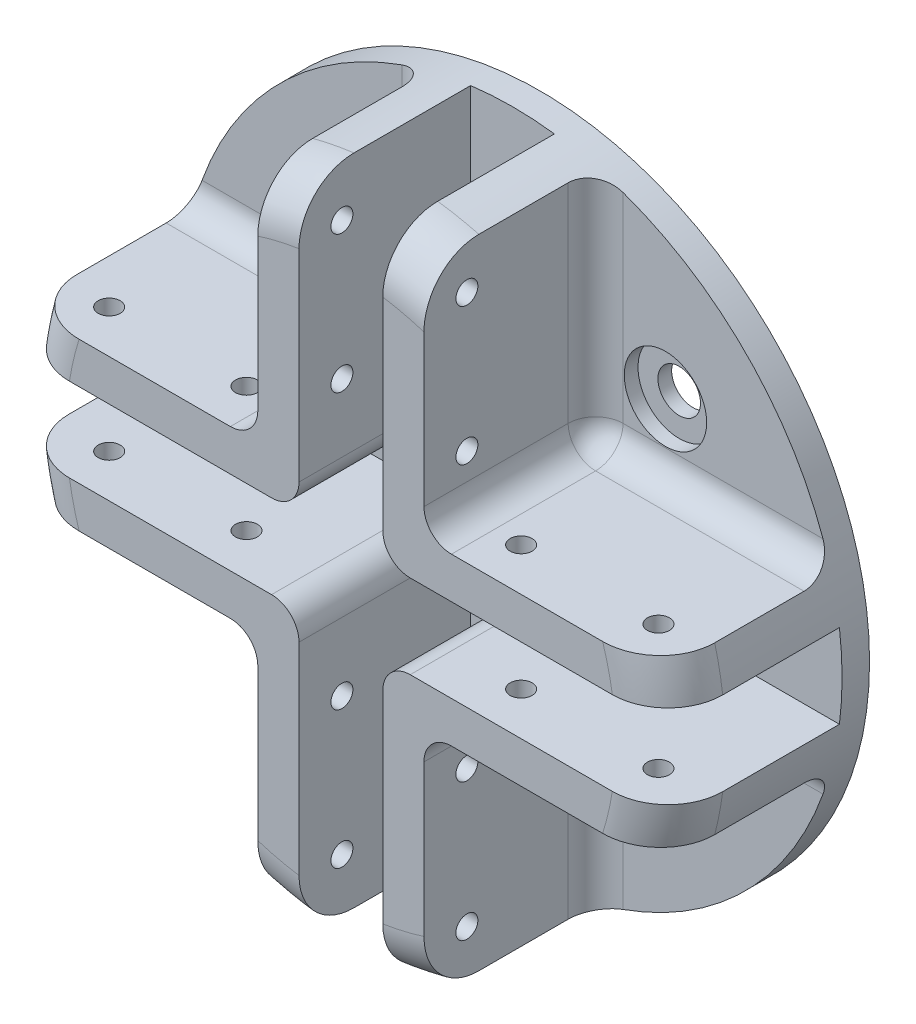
ISO-10303-21;
HEADER;
FILE_DESCRIPTION(('STEP AP214'),'2;1');
FILE_NAME('part.step','',(''),(''),'','','');
FILE_SCHEMA(('AUTOMOTIVE_DESIGN { 1 0 10303 214 1 1 1 1 }'));
ENDSEC;
DATA;
#1=APPLICATION_CONTEXT('core data for automotive mechanical design processes');
#2=APPLICATION_PROTOCOL_DEFINITION('international standard','automotive_design',2000,#1);
#3=PRODUCT_CONTEXT('',#1,'mechanical');
#4=PRODUCT('Part','Part','',(#3));
#5=PRODUCT_RELATED_PRODUCT_CATEGORY('part','',(#4));
#6=PRODUCT_DEFINITION_FORMATION('','',#4);
#7=PRODUCT_DEFINITION_CONTEXT('part definition',#1,'design');
#8=PRODUCT_DEFINITION('design','',#6,#7);
#9=PRODUCT_DEFINITION_SHAPE('','',#8);
#10=(LENGTH_UNIT() NAMED_UNIT(*) SI_UNIT(.MILLI.,.METRE.));
#11=(NAMED_UNIT(*) PLANE_ANGLE_UNIT() SI_UNIT($,.RADIAN.));
#12=(NAMED_UNIT(*) SI_UNIT($,.STERADIAN.) SOLID_ANGLE_UNIT());
#13=UNCERTAINTY_MEASURE_WITH_UNIT(LENGTH_MEASURE(1.E-05),#10,'distance_accuracy_value','');
#14=(GEOMETRIC_REPRESENTATION_CONTEXT(3) GLOBAL_UNCERTAINTY_ASSIGNED_CONTEXT((#13)) GLOBAL_UNIT_ASSIGNED_CONTEXT((#10,
#11,#12)) REPRESENTATION_CONTEXT('',''));
#15=CARTESIAN_POINT('',(0.,0.,0.));
#16=DIRECTION('',(0.,0.,1.));
#17=DIRECTION('',(1.,0.,0.));
#18=AXIS2_PLACEMENT_3D('',#15,#16,#17);
#19=CARTESIAN_POINT('',(0.,0.,2.));
#20=DIRECTION('',(0.,0.,1.));
#21=DIRECTION('',(1.,0.,0.));
#22=AXIS2_PLACEMENT_3D('',#19,#20,#21);
#23=PLANE('',#22);
#24=CARTESIAN_POINT('',(5.05000000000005,-5.04999999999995,2.));
#25=DIRECTION('',(0.,0.,1.));
#26=DIRECTION('',(0.,1.,0.));
#27=AXIS2_PLACEMENT_3D('',#24,#25,#26);
#28=CIRCLE('',#27,2.);
#29=CARTESIAN_POINT('',(5.05000000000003,-3.04999999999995,2.));
#30=VERTEX_POINT('',#29);
#31=CARTESIAN_POINT('',(3.05000000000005,-5.04999999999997,2.));
#32=VERTEX_POINT('',#31);
#33=EDGE_CURVE('E373',#30,#32,#28,.T.);
#34=ORIENTED_EDGE('',*,*,#33,.F.);
#35=DIRECTION('',(-1.,0.,0.));
#36=VECTOR('',#35,1.);
#37=CARTESIAN_POINT('',(23.8054090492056,-3.04999999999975,2.));
#38=LINE('',#37,#36);
#39=CARTESIAN_POINT('',(23.8054090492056,-3.04999999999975,2.));
#40=VERTEX_POINT('',#39);
#41=EDGE_CURVE('E351',#40,#30,#38,.T.);
#42=ORIENTED_EDGE('',*,*,#41,.F.);
#43=CARTESIAN_POINT('',(0.,0.,2.));
#44=DIRECTION('',(0.,0.,1.));
#45=DIRECTION('',(1.,0.,0.));
#46=AXIS2_PLACEMENT_3D('',#43,#44,#45);
#47=CIRCLE('',#46,24.);
#48=CARTESIAN_POINT('',(23.8054090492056,3.05,2.));
#49=VERTEX_POINT('',#48);
#50=EDGE_CURVE('E593',#40,#49,#47,.T.);
#51=ORIENTED_EDGE('',*,*,#50,.T.);
#52=DIRECTION('',(1.,0.,0.));
#53=VECTOR('',#52,1.);
#54=CARTESIAN_POINT('',(5.05,3.05,2.));
#55=LINE('',#54,#53);
#56=CARTESIAN_POINT('',(5.05,3.05,2.));
#57=VERTEX_POINT('',#56);
#58=EDGE_CURVE('E496',#57,#49,#55,.T.);
#59=ORIENTED_EDGE('',*,*,#58,.F.);
#60=CARTESIAN_POINT('',(5.05,5.05,2.));
#61=DIRECTION('',(0.,0.,1.));
#62=DIRECTION('',(-1.,0.,0.));
#63=AXIS2_PLACEMENT_3D('',#60,#61,#62);
#64=CIRCLE('',#63,2.);
#65=CARTESIAN_POINT('',(3.05,5.05,2.));
#66=VERTEX_POINT('',#65);
#67=EDGE_CURVE('E512',#66,#57,#64,.T.);
#68=ORIENTED_EDGE('',*,*,#67,.F.);
#69=DIRECTION('',(0.,-1.,0.));
#70=VECTOR('',#69,1.);
#71=CARTESIAN_POINT('',(3.05,23.8054090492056,2.));
#72=LINE('',#71,#70);
#73=CARTESIAN_POINT('',(3.05,23.8054090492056,2.));
#74=VERTEX_POINT('',#73);
#75=EDGE_CURVE('E509',#74,#66,#72,.T.);
#76=ORIENTED_EDGE('',*,*,#75,.F.);
#77=CARTESIAN_POINT('',(-3.05000000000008,23.8054090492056,2.));
#78=VERTEX_POINT('',#77);
#79=EDGE_CURVE('E585',#74,#78,#47,.T.);
#80=ORIENTED_EDGE('',*,*,#79,.T.);
#81=DIRECTION('',(0.,1.,0.));
#82=VECTOR('',#81,1.);
#83=CARTESIAN_POINT('',(-3.05000000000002,5.04999999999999,2.));
#84=LINE('',#83,#82);
#85=CARTESIAN_POINT('',(-3.05000000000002,5.04999999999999,2.));
#86=VERTEX_POINT('',#85);
#87=EDGE_CURVE('E437',#86,#78,#84,.T.);
#88=ORIENTED_EDGE('',*,*,#87,.F.);
#89=CARTESIAN_POINT('',(-5.05000000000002,5.04999999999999,2.));
#90=DIRECTION('',(0.,0.,1.));
#91=DIRECTION('',(0.,-1.,0.));
#92=AXIS2_PLACEMENT_3D('',#89,#90,#91);
#93=CIRCLE('',#92,2.);
#94=CARTESIAN_POINT('',(-5.05000000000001,3.04999999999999,2.));
#95=VERTEX_POINT('',#94);
#96=EDGE_CURVE('E451',#95,#86,#93,.T.);
#97=ORIENTED_EDGE('',*,*,#96,.F.);
#98=DIRECTION('',(1.,0.,0.));
#99=VECTOR('',#98,1.);
#100=CARTESIAN_POINT('',(-23.8054090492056,3.04999999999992,2.));
#101=LINE('',#100,#99);
#102=CARTESIAN_POINT('',(-23.8054090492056,3.04999999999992,2.));
#103=VERTEX_POINT('',#102);
#104=EDGE_CURVE('E433',#103,#95,#101,.T.);
#105=ORIENTED_EDGE('',*,*,#104,.F.);
#106=CARTESIAN_POINT('',(-23.8054090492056,-3.05,2.));
#107=VERTEX_POINT('',#106);
#108=EDGE_CURVE('E590',#103,#107,#47,.T.);
#109=ORIENTED_EDGE('',*,*,#108,.T.);
#110=DIRECTION('',(-1.,0.,0.));
#111=VECTOR('',#110,1.);
#112=CARTESIAN_POINT('',(-5.05,-3.05,2.));
#113=LINE('',#112,#111);
#114=CARTESIAN_POINT('',(-5.05,-3.05,2.));
#115=VERTEX_POINT('',#114);
#116=EDGE_CURVE('E395',#115,#107,#113,.T.);
#117=ORIENTED_EDGE('',*,*,#116,.F.);
#118=CARTESIAN_POINT('',(-5.05,-5.05,2.));
#119=DIRECTION('',(0.,0.,1.));
#120=DIRECTION('',(1.,0.,0.));
#121=AXIS2_PLACEMENT_3D('',#118,#119,#120);
#122=CIRCLE('',#121,2.);
#123=CARTESIAN_POINT('',(-3.05,-5.05,2.));
#124=VERTEX_POINT('',#123);
#125=EDGE_CURVE('E409',#124,#115,#122,.T.);
#126=ORIENTED_EDGE('',*,*,#125,.F.);
#127=DIRECTION('',(0.,1.,0.));
#128=VECTOR('',#127,1.);
#129=CARTESIAN_POINT('',(-3.05,-23.8054090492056,2.));
#130=LINE('',#129,#128);
#131=CARTESIAN_POINT('',(-3.05,-23.8054090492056,2.));
#132=VERTEX_POINT('',#131);
#133=EDGE_CURVE('E391',#132,#124,#130,.T.);
#134=ORIENTED_EDGE('',*,*,#133,.F.);
#135=CARTESIAN_POINT('',(3.05000000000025,-23.8054090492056,2.));
#136=VERTEX_POINT('',#135);
#137=EDGE_CURVE('E1135',#132,#136,#47,.T.);
#138=ORIENTED_EDGE('',*,*,#137,.T.);
#139=DIRECTION('',(0.,-1.,0.));
#140=VECTOR('',#139,1.);
#141=CARTESIAN_POINT('',(3.05000000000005,-5.04999999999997,2.));
#142=LINE('',#141,#140);
#143=EDGE_CURVE('E344',#32,#136,#142,.T.);
#144=ORIENTED_EDGE('',*,*,#143,.F.);
#145=EDGE_LOOP('',(#34,#42,#51,#59,#68,#76,#80,#88,#97,#105,#109,#117,#126,#134,#138,#144));
#146=FACE_BOUND('',#145,.T.);
#147=ADVANCED_FACE('F33',(#146),#23,.T.);
#148=CARTESIAN_POINT('',(11.1369318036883,-11.136931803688,2.));
#149=DIRECTION('',(0.,0.,1.));
#150=DIRECTION('',(0.,-1.,0.));
#151=AXIS2_PLACEMENT_3D('',#148,#149,#150);
#152=CIRCLE('',#151,3.);
#153=CARTESIAN_POINT('',(11.1369318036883,-14.136931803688,2.));
#154=VERTEX_POINT('',#153);
#155=EDGE_CURVE('E540',#154,#154,#152,.T.);
#156=ORIENTED_EDGE('',*,*,#155,.F.);
#157=EDGE_LOOP('',(#156));
#158=FACE_BOUND('',#157,.T.);
#159=CARTESIAN_POINT('',(8.05000000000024,-22.6096771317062,2.));
#160=VERTEX_POINT('',#159);
#161=CARTESIAN_POINT('',(22.6096771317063,-8.04999999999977,2.));
#162=VERTEX_POINT('',#161);
#163=EDGE_CURVE('E769',#160,#162,#47,.T.);
#164=ORIENTED_EDGE('',*,*,#163,.T.);
#165=DIRECTION('',(1.,0.,0.));
#166=VECTOR('',#165,1.);
#167=CARTESIAN_POINT('',(0.,-8.05,2.));
#168=LINE('',#167,#166);
#169=CARTESIAN_POINT('',(8.05000000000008,-8.04999999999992,2.));
#170=VERTEX_POINT('',#169);
#171=EDGE_CURVE('E647',#162,#170,#168,.F.);
#172=ORIENTED_EDGE('',*,*,#171,.T.);
#173=DIRECTION('',(0.,1.,0.));
#174=VECTOR('',#173,1.);
#175=CARTESIAN_POINT('',(8.05,0.,2.));
#176=LINE('',#175,#174);
#177=EDGE_CURVE('E645',#170,#160,#176,.F.);
#178=ORIENTED_EDGE('',*,*,#177,.T.);
#179=EDGE_LOOP('',(#164,#172,#178));
#180=FACE_BOUND('',#179,.T.);
#181=ADVANCED_FACE('F1053',(#158,#180),#23,.T.);
#182=CARTESIAN_POINT('',(-11.1369318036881,-11.1369318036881,2.));
#183=DIRECTION('',(0.,0.,1.));
#184=DIRECTION('',(-1.,0.,0.));
#185=AXIS2_PLACEMENT_3D('',#182,#183,#184);
#186=CIRCLE('',#185,3.);
#187=CARTESIAN_POINT('',(-14.1369318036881,-11.1369318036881,2.));
#188=VERTEX_POINT('',#187);
#189=EDGE_CURVE('E556',#188,#188,#186,.T.);
#190=ORIENTED_EDGE('',*,*,#189,.F.);
#191=EDGE_LOOP('',(#190));
#192=FACE_BOUND('',#191,.T.);
#193=CARTESIAN_POINT('',(-22.6096771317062,-8.05,2.));
#194=VERTEX_POINT('',#193);
#195=CARTESIAN_POINT('',(-8.05,-22.6096771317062,2.));
#196=VERTEX_POINT('',#195);
#197=EDGE_CURVE('E589',#194,#196,#47,.T.);
#198=ORIENTED_EDGE('',*,*,#197,.T.);
#199=DIRECTION('',(0.,-1.,0.));
#200=VECTOR('',#199,1.);
#201=CARTESIAN_POINT('',(-8.05,0.,2.));
#202=LINE('',#201,#200);
#203=CARTESIAN_POINT('',(-8.05,-8.05,2.));
#204=VERTEX_POINT('',#203);
#205=EDGE_CURVE('E656',#196,#204,#202,.F.);
#206=ORIENTED_EDGE('',*,*,#205,.T.);
#207=DIRECTION('',(1.,0.,0.));
#208=VECTOR('',#207,1.);
#209=CARTESIAN_POINT('',(0.,-8.05,2.));
#210=LINE('',#209,#208);
#211=EDGE_CURVE('E654',#204,#194,#210,.F.);
#212=ORIENTED_EDGE('',*,*,#211,.T.);
#213=EDGE_LOOP('',(#198,#206,#212));
#214=FACE_BOUND('',#213,.T.);
#215=ADVANCED_FACE('F1059',(#192,#214),#23,.T.);
#216=CARTESIAN_POINT('',(-11.1369318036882,11.1369318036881,2.));
#217=DIRECTION('',(0.,0.,1.));
#218=DIRECTION('',(0.,1.,0.));
#219=AXIS2_PLACEMENT_3D('',#216,#217,#218);
#220=CIRCLE('',#219,3.);
#221=CARTESIAN_POINT('',(-11.1369318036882,14.1369318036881,2.));
#222=VERTEX_POINT('',#221);
#223=EDGE_CURVE('E550',#222,#222,#220,.T.);
#224=ORIENTED_EDGE('',*,*,#223,.F.);
#225=EDGE_LOOP('',(#224));
#226=FACE_BOUND('',#225,.T.);
#227=CARTESIAN_POINT('',(-8.05000000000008,22.6096771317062,2.));
#228=VERTEX_POINT('',#227);
#229=CARTESIAN_POINT('',(-22.6096771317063,8.04999999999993,2.));
#230=VERTEX_POINT('',#229);
#231=EDGE_CURVE('E588',#228,#230,#47,.T.);
#232=ORIENTED_EDGE('',*,*,#231,.T.);
#233=DIRECTION('',(-1.,0.,0.));
#234=VECTOR('',#233,1.);
#235=CARTESIAN_POINT('',(0.,8.05,2.));
#236=LINE('',#235,#234);
#237=CARTESIAN_POINT('',(-8.05000000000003,8.04999999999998,2.));
#238=VERTEX_POINT('',#237);
#239=EDGE_CURVE('E629',#230,#238,#236,.F.);
#240=ORIENTED_EDGE('',*,*,#239,.T.);
#241=DIRECTION('',(0.,-1.,0.));
#242=VECTOR('',#241,1.);
#243=CARTESIAN_POINT('',(-8.05,0.,2.));
#244=LINE('',#243,#242);
#245=EDGE_CURVE('E627',#238,#228,#244,.F.);
#246=ORIENTED_EDGE('',*,*,#245,.T.);
#247=EDGE_LOOP('',(#232,#240,#246));
#248=FACE_BOUND('',#247,.T.);
#249=ADVANCED_FACE('F1064',(#226,#248),#23,.T.);
#250=CARTESIAN_POINT('',(22.6096771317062,8.05,2.));
#251=VERTEX_POINT('',#250);
#252=CARTESIAN_POINT('',(8.05,22.6096771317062,2.));
#253=VERTEX_POINT('',#252);
#254=EDGE_CURVE('E545',#251,#253,#47,.T.);
#255=ORIENTED_EDGE('',*,*,#254,.T.);
#256=DIRECTION('',(0.,1.,0.));
#257=VECTOR('',#256,1.);
#258=CARTESIAN_POINT('',(8.05,0.,2.));
#259=LINE('',#258,#257);
#260=CARTESIAN_POINT('',(8.05,8.05,2.));
#261=VERTEX_POINT('',#260);
#262=EDGE_CURVE('E638',#253,#261,#259,.F.);
#263=ORIENTED_EDGE('',*,*,#262,.T.);
#264=DIRECTION('',(-1.,0.,0.));
#265=VECTOR('',#264,1.);
#266=CARTESIAN_POINT('',(0.,8.05,2.));
#267=LINE('',#266,#265);
#268=EDGE_CURVE('E636',#261,#251,#267,.F.);
#269=ORIENTED_EDGE('',*,*,#268,.T.);
#270=EDGE_LOOP('',(#255,#263,#269));
#271=FACE_BOUND('',#270,.T.);
#272=CARTESIAN_POINT('',(11.1369318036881,11.1369318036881,2.));
#273=DIRECTION('',(0.,0.,1.));
#274=DIRECTION('',(1.,0.,0.));
#275=AXIS2_PLACEMENT_3D('',#272,#273,#274);
#276=CIRCLE('',#275,3.);
#277=CARTESIAN_POINT('',(14.1369318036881,11.1369318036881,2.));
#278=VERTEX_POINT('',#277);
#279=EDGE_CURVE('E567',#278,#278,#276,.T.);
#280=ORIENTED_EDGE('',*,*,#279,.F.);
#281=EDGE_LOOP('',(#280));
#282=FACE_BOUND('',#281,.T.);
#283=ADVANCED_FACE('F766',(#271,#282),#23,.T.);
#284=CARTESIAN_POINT('',(11.1369318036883,-11.136931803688,0.));
#285=DIRECTION('',(0.,0.,1.));
#286=DIRECTION('',(1.,0.,0.));
#287=AXIS2_PLACEMENT_3D('',#284,#285,#286);
#288=CYLINDRICAL_SURFACE('',#287,1.55);
#289=CARTESIAN_POINT('',(11.1369318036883,-11.136931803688,0.));
#290=DIRECTION('',(0.,0.,1.));
#291=DIRECTION('',(0.,-1.,0.));
#292=AXIS2_PLACEMENT_3D('',#289,#290,#291);
#293=CIRCLE('',#292,1.55);
#294=CARTESIAN_POINT('',(11.1369318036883,-12.686931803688,0.));
#295=VERTEX_POINT('',#294);
#296=EDGE_CURVE('E571',#295,#295,#293,.T.);
#297=ORIENTED_EDGE('',*,*,#296,.F.);
#298=EDGE_LOOP('',(#297));
#299=FACE_BOUND('',#298,.T.);
#300=CARTESIAN_POINT('',(11.1369318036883,-11.136931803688,1.));
#301=DIRECTION('',(0.,0.,1.));
#302=DIRECTION('',(1.,0.,0.));
#303=AXIS2_PLACEMENT_3D('',#300,#301,#302);
#304=CIRCLE('',#303,1.55);
#305=CARTESIAN_POINT('',(12.6869318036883,-11.136931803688,1.));
#306=VERTEX_POINT('',#305);
#307=EDGE_CURVE('E574',#306,#306,#304,.F.);
#308=ORIENTED_EDGE('',*,*,#307,.F.);
#309=EDGE_LOOP('',(#308));
#310=FACE_BOUND('',#309,.T.);
#311=ADVANCED_FACE('F1063',(#299,#310),#288,.F.);
#312=CARTESIAN_POINT('',(-11.1369318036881,-11.1369318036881,0.));
#313=DIRECTION('',(0.,0.,1.));
#314=DIRECTION('',(1.,0.,0.));
#315=AXIS2_PLACEMENT_3D('',#312,#313,#314);
#316=CYLINDRICAL_SURFACE('',#315,1.55);
#317=CARTESIAN_POINT('',(-11.1369318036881,-11.1369318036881,0.));
#318=DIRECTION('',(0.,0.,1.));
#319=DIRECTION('',(-1.,0.,0.));
#320=AXIS2_PLACEMENT_3D('',#317,#318,#319);
#321=CIRCLE('',#320,1.55);
#322=CARTESIAN_POINT('',(-12.6869318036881,-11.1369318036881,0.));
#323=VERTEX_POINT('',#322);
#324=EDGE_CURVE('E568',#323,#323,#321,.T.);
#325=ORIENTED_EDGE('',*,*,#324,.F.);
#326=EDGE_LOOP('',(#325));
#327=FACE_BOUND('',#326,.T.);
#328=CARTESIAN_POINT('',(-11.1369318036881,-11.1369318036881,1.));
#329=DIRECTION('',(0.,0.,1.));
#330=DIRECTION('',(1.,0.,0.));
#331=AXIS2_PLACEMENT_3D('',#328,#329,#330);
#332=CIRCLE('',#331,1.55);
#333=CARTESIAN_POINT('',(-9.5869318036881,-11.1369318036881,1.));
#334=VERTEX_POINT('',#333);
#335=EDGE_CURVE('E598',#334,#334,#332,.F.);
#336=ORIENTED_EDGE('',*,*,#335,.F.);
#337=EDGE_LOOP('',(#336));
#338=FACE_BOUND('',#337,.T.);
#339=ADVANCED_FACE('F1069',(#327,#338),#316,.F.);
#340=CARTESIAN_POINT('',(-11.1369318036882,11.1369318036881,0.));
#341=DIRECTION('',(0.,0.,1.));
#342=DIRECTION('',(1.,0.,0.));
#343=AXIS2_PLACEMENT_3D('',#340,#341,#342);
#344=CYLINDRICAL_SURFACE('',#343,1.55);
#345=CARTESIAN_POINT('',(-11.1369318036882,11.1369318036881,0.));
#346=DIRECTION('',(0.,0.,1.));
#347=DIRECTION('',(0.,1.,0.));
#348=AXIS2_PLACEMENT_3D('',#345,#346,#347);
#349=CIRCLE('',#348,1.55);
#350=CARTESIAN_POINT('',(-11.1369318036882,12.6869318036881,0.));
#351=VERTEX_POINT('',#350);
#352=EDGE_CURVE('E564',#351,#351,#349,.T.);
#353=ORIENTED_EDGE('',*,*,#352,.F.);
#354=EDGE_LOOP('',(#353));
#355=FACE_BOUND('',#354,.T.);
#356=CARTESIAN_POINT('',(-11.1369318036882,11.1369318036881,1.));
#357=DIRECTION('',(0.,0.,1.));
#358=DIRECTION('',(1.,0.,0.));
#359=AXIS2_PLACEMENT_3D('',#356,#357,#358);
#360=CIRCLE('',#359,1.55);
#361=CARTESIAN_POINT('',(-9.58693180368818,11.1369318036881,1.));
#362=VERTEX_POINT('',#361);
#363=EDGE_CURVE('E549',#362,#362,#360,.F.);
#364=ORIENTED_EDGE('',*,*,#363,.F.);
#365=EDGE_LOOP('',(#364));
#366=FACE_BOUND('',#365,.T.);
#367=ADVANCED_FACE('F1825',(#355,#366),#344,.F.);
#368=CARTESIAN_POINT('',(11.1369318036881,11.1369318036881,0.));
#369=DIRECTION('',(0.,0.,1.));
#370=DIRECTION('',(1.,0.,0.));
#371=AXIS2_PLACEMENT_3D('',#368,#369,#370);
#372=CYLINDRICAL_SURFACE('',#371,1.55);
#373=CARTESIAN_POINT('',(11.1369318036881,11.1369318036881,0.));
#374=DIRECTION('',(0.,0.,1.));
#375=DIRECTION('',(1.,0.,0.));
#376=AXIS2_PLACEMENT_3D('',#373,#374,#375);
#377=CIRCLE('',#376,1.55);
#378=CARTESIAN_POINT('',(12.6869318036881,11.1369318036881,0.));
#379=VERTEX_POINT('',#378);
#380=EDGE_CURVE('E581',#379,#379,#377,.T.);
#381=ORIENTED_EDGE('',*,*,#380,.F.);
#382=EDGE_LOOP('',(#381));
#383=FACE_BOUND('',#382,.T.);
#384=CARTESIAN_POINT('',(11.1369318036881,11.1369318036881,1.));
#385=DIRECTION('',(0.,0.,1.));
#386=DIRECTION('',(1.,0.,0.));
#387=AXIS2_PLACEMENT_3D('',#384,#385,#386);
#388=CIRCLE('',#387,1.55);
#389=CARTESIAN_POINT('',(12.6869318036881,11.1369318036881,1.));
#390=VERTEX_POINT('',#389);
#391=EDGE_CURVE('E578',#390,#390,#388,.F.);
#392=ORIENTED_EDGE('',*,*,#391,.F.);
#393=EDGE_LOOP('',(#392));
#394=FACE_BOUND('',#393,.T.);
#395=ADVANCED_FACE('F1648',(#383,#394),#372,.F.);
#396=CARTESIAN_POINT('',(0.,0.,2.));
#397=DIRECTION('',(0.,0.,-1.));
#398=DIRECTION('',(-1.,0.,0.));
#399=AXIS2_PLACEMENT_3D('',#396,#397,#398);
#400=CYLINDRICAL_SURFACE('',#399,24.);
#401=DIRECTION('',(0.,0.,-1.));
#402=VECTOR('',#401,1.);
#403=CARTESIAN_POINT('',(23.8054090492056,-3.04999999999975,14.5));
#404=LINE('',#403,#402);
#405=CARTESIAN_POINT('',(23.8054090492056,-3.04999999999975,10.5));
#406=VERTEX_POINT('',#405);
#407=EDGE_CURVE('E354',#406,#40,#404,.T.);
#408=ORIENTED_EDGE('',*,*,#407,.F.);
#409=CARTESIAN_POINT('',(0.,0.,10.5));
#410=DIRECTION('',(0.,0.,1.));
#411=DIRECTION('',(1.,0.,0.));
#412=AXIS2_PLACEMENT_3D('',#409,#410,#411);
#413=CIRCLE('',#412,24.);
#414=CARTESIAN_POINT('',(23.2249327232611,-6.04999999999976,10.5));
#415=VERTEX_POINT('',#414);
#416=EDGE_CURVE('E915',#406,#415,#413,.F.);
#417=ORIENTED_EDGE('',*,*,#416,.T.);
#418=DIRECTION('',(0.,0.,-1.));
#419=VECTOR('',#418,1.);
#420=CARTESIAN_POINT('',(23.2249327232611,-6.04999999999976,14.5));
#421=LINE('',#420,#419);
#422=CARTESIAN_POINT('',(23.2249327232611,-6.04999999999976,4.));
#423=VERTEX_POINT('',#422);
#424=EDGE_CURVE('E371',#415,#423,#421,.T.);
#425=ORIENTED_EDGE('',*,*,#424,.T.);
#426=CARTESIAN_POINT('',(23.2249327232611,-6.04999999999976,4.));
#427=CARTESIAN_POINT('',(23.2249317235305,-6.04999947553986,3.94518150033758));
#428=CARTESIAN_POINT('',(23.2243453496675,-6.05225530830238,3.89038959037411));
#429=CARTESIAN_POINT('',(23.2220002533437,-6.06124873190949,3.78120522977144));
#430=CARTESIAN_POINT('',(23.220241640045,-6.06798590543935,3.72681274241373));
#431=CARTESIAN_POINT('',(23.2132159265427,-6.09483142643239,3.56499287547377));
#432=CARTESIAN_POINT('',(23.2061989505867,-6.12157411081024,3.45866168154));
#433=CARTESIAN_POINT('',(23.1875426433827,-6.19186330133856,3.25217433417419));
#434=CARTESIAN_POINT('',(23.1759021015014,-6.23541420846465,3.1520198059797));
#435=CARTESIAN_POINT('',(23.1480932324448,-6.33786922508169,2.96058244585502));
#436=CARTESIAN_POINT('',(23.1319248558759,-6.39677350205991,2.86929971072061));
#437=CARTESIAN_POINT('',(23.0950306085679,-6.52872798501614,2.69706913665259));
#438=CARTESIAN_POINT('',(23.0742578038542,-6.60192286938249,2.61624239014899));
#439=CARTESIAN_POINT('',(23.0285231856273,-6.75972317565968,2.46803855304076));
#440=CARTESIAN_POINT('',(23.0035607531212,-6.84433028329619,2.40066345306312));
#441=CARTESIAN_POINT('',(22.9490031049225,-7.02512832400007,2.2789907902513));
#442=CARTESIAN_POINT('',(22.9192896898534,-7.12159410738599,2.22515543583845));
#443=CARTESIAN_POINT('',(22.8563418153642,-7.32110509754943,2.13432893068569));
#444=CARTESIAN_POINT('',(22.8231065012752,-7.42415189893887,2.09734188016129));
#445=CARTESIAN_POINT('',(22.7602357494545,-7.61444303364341,2.04599850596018));
#446=CARTESIAN_POINT('',(22.7310763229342,-7.70107246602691,2.02871676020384));
#447=CARTESIAN_POINT('',(22.671344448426,-7.87519755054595,2.0057181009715));
#448=CARTESIAN_POINT('',(22.6407746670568,-7.96269134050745,1.99998020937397));
#449=CARTESIAN_POINT('',(22.6096771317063,-8.04999999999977,2.));
#450=B_SPLINE_CURVE_WITH_KNOTS('',3,(#426,#427,#428,#429,#430,#431,#432,#433,#434,#435,#436,
#437,#438,#439,#440,#441,#442,#443,#444,#445,#446,#447,#448,#449),.UNSPECIFIED.,.F.,.F.,(4,2,2,
2,2,2,2,2,2,2,2,4),(0.,0.164353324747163,0.328691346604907,0.656593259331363,0.984581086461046,
1.31257249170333,1.64407495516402,1.97562643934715,2.31730312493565,2.65906291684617,
2.93742028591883,3.21527135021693),.UNSPECIFIED.);
#451=EDGE_CURVE('E746',#423,#162,#450,.T.);
#452=ORIENTED_EDGE('',*,*,#451,.T.);
#453=ORIENTED_EDGE('',*,*,#163,.F.);
#454=CARTESIAN_POINT('',(8.05000000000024,-22.6096771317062,2.));
#455=CARTESIAN_POINT('',(7.99240199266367,-22.6301857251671,2.00000216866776));
#456=CARTESIAN_POINT('',(7.93474889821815,-22.6504630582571,2.00248980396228));
#457=CARTESIAN_POINT('',(7.81966786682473,-22.6904495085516,2.01246662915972));
#458=CARTESIAN_POINT('',(7.76223997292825,-22.710158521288,2.01995673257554));
#459=CARTESIAN_POINT('',(7.59078246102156,-22.7682790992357,2.04998348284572));
#460=CARTESIAN_POINT('',(7.47762646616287,-22.8056673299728,2.0800766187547));
#461=CARTESIAN_POINT('',(7.25715043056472,-22.8767838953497,2.16011408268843));
#462=CARTESIAN_POINT('',(7.14984024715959,-22.9105061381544,2.21009082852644));
#463=CARTESIAN_POINT('',(6.94483771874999,-22.9734785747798,2.32888568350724));
#464=CARTESIAN_POINT('',(6.84713644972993,-23.0027329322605,2.39768608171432));
#465=CARTESIAN_POINT('',(6.66825085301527,-23.0552122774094,2.54947961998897));
#466=CARTESIAN_POINT('',(6.58658070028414,-23.0786238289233,2.63183566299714));
#467=CARTESIAN_POINT('',(6.43819792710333,-23.1204577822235,2.81023284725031));
#468=CARTESIAN_POINT('',(6.37148767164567,-23.1388793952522,2.90627614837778));
#469=CARTESIAN_POINT('',(6.25801228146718,-23.169821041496,3.10484154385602));
#470=CARTESIAN_POINT('',(6.21052125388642,-23.1825582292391,3.20691612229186));
#471=CARTESIAN_POINT('',(6.13327279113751,-23.2031157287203,3.41797774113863));
#472=CARTESIAN_POINT('',(6.10349582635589,-23.2109414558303,3.5269570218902));
#473=CARTESIAN_POINT('',(6.07208541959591,-23.2191709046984,3.69741415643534));
#474=CARTESIAN_POINT('',(6.06380644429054,-23.2213329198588,3.75765978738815));
#475=CARTESIAN_POINT('',(6.05276682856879,-23.2242121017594,3.87859370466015));
#476=CARTESIAN_POINT('',(6.04999758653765,-23.2249315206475,3.93928115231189));
#477=CARTESIAN_POINT('',(6.05000000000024,-23.2249327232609,4.));
#478=B_SPLINE_CURVE_WITH_KNOTS('',3,(#454,#455,#456,#457,#458,#459,#460,#461,#462,#463,#464,
#465,#466,#467,#468,#469,#470,#471,#472,#473,#474,#475,#476,#477),.UNSPECIFIED.,.F.,.F.,(4,2,2,
2,2,2,2,2,2,2,2,4),(0.,0.183316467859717,0.366666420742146,0.733515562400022,1.1009652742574,
1.468070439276,1.82125538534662,2.1744961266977,2.51275578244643,2.85064181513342,
3.03295398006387,3.21498130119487),.UNSPECIFIED.);
#479=CARTESIAN_POINT('',(6.05000000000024,-23.224932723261,4.));
#480=VERTEX_POINT('',#479);
#481=EDGE_CURVE('E727',#160,#480,#478,.T.);
#482=ORIENTED_EDGE('',*,*,#481,.T.);
#483=DIRECTION('',(0.,0.,-1.));
#484=VECTOR('',#483,1.);
#485=CARTESIAN_POINT('',(6.05000000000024,-23.224932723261,14.5));
#486=LINE('',#485,#484);
#487=CARTESIAN_POINT('',(6.05000000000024,-23.224932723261,10.5));
#488=VERTEX_POINT('',#487);
#489=EDGE_CURVE('E385',#488,#480,#486,.T.);
#490=ORIENTED_EDGE('',*,*,#489,.F.);
#491=CARTESIAN_POINT('',(0.,0.,10.5));
#492=DIRECTION('',(0.,0.,1.));
#493=DIRECTION('',(1.,0.,0.));
#494=AXIS2_PLACEMENT_3D('',#491,#492,#493);
#495=CIRCLE('',#494,24.);
#496=CARTESIAN_POINT('',(3.05000000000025,-23.8054090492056,10.5));
#497=VERTEX_POINT('',#496);
#498=EDGE_CURVE('E1143',#488,#497,#495,.F.);
#499=ORIENTED_EDGE('',*,*,#498,.T.);
#500=DIRECTION('',(0.,0.,-1.));
#501=VECTOR('',#500,1.);
#502=CARTESIAN_POINT('',(3.05000000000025,-23.8054090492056,14.5));
#503=LINE('',#502,#501);
#504=EDGE_CURVE('E387',#497,#136,#503,.T.);
#505=ORIENTED_EDGE('',*,*,#504,.T.);
#506=ORIENTED_EDGE('',*,*,#137,.F.);
#507=DIRECTION('',(0.,0.,-1.));
#508=VECTOR('',#507,1.);
#509=CARTESIAN_POINT('',(-3.05,-23.8054090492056,14.5));
#510=LINE('',#509,#508);
#511=CARTESIAN_POINT('',(-3.05,-23.8054090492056,10.5));
#512=VERTEX_POINT('',#511);
#513=EDGE_CURVE('E431',#512,#132,#510,.T.);
#514=ORIENTED_EDGE('',*,*,#513,.F.);
#515=CARTESIAN_POINT('',(0.,0.,10.5));
#516=DIRECTION('',(0.,0.,1.));
#517=DIRECTION('',(1.,0.,0.));
#518=AXIS2_PLACEMENT_3D('',#515,#516,#517);
#519=CIRCLE('',#518,24.);
#520=CARTESIAN_POINT('',(-6.05,-23.224932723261,10.5));
#521=VERTEX_POINT('',#520);
#522=EDGE_CURVE('E809',#512,#521,#519,.F.);
#523=ORIENTED_EDGE('',*,*,#522,.T.);
#524=DIRECTION('',(0.,0.,-1.));
#525=VECTOR('',#524,1.);
#526=CARTESIAN_POINT('',(-6.05,-23.224932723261,14.5));
#527=LINE('',#526,#525);
#528=CARTESIAN_POINT('',(-6.05,-23.224932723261,4.));
#529=VERTEX_POINT('',#528);
#530=EDGE_CURVE('E406',#521,#529,#527,.T.);
#531=ORIENTED_EDGE('',*,*,#530,.T.);
#532=CARTESIAN_POINT('',(-6.05,-23.224932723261,4.));
#533=CARTESIAN_POINT('',(-6.0499994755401,-23.2249317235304,3.94518150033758));
#534=CARTESIAN_POINT('',(-6.05225530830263,-23.2243453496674,3.8903895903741));
#535=CARTESIAN_POINT('',(-6.06124873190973,-23.2220002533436,3.78120522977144));
#536=CARTESIAN_POINT('',(-6.06798590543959,-23.220241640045,3.72681274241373));
#537=CARTESIAN_POINT('',(-6.09483142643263,-23.2132159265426,3.56499287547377));
#538=CARTESIAN_POINT('',(-6.12157411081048,-23.2061989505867,3.45866168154));
#539=CARTESIAN_POINT('',(-6.1918633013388,-23.1875426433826,3.25217433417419));
#540=CARTESIAN_POINT('',(-6.23541420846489,-23.1759021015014,3.1520198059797));
#541=CARTESIAN_POINT('',(-6.33786922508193,-23.1480932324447,2.96058244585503));
#542=CARTESIAN_POINT('',(-6.39677350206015,-23.1319248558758,2.86929971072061));
#543=CARTESIAN_POINT('',(-6.52872798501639,-23.0950306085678,2.69706913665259));
#544=CARTESIAN_POINT('',(-6.60192286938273,-23.0742578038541,2.61624239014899));
#545=CARTESIAN_POINT('',(-6.75972317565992,-23.0285231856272,2.46803855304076));
#546=CARTESIAN_POINT('',(-6.84433028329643,-23.0035607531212,2.40066345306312));
#547=CARTESIAN_POINT('',(-7.02512832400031,-22.9490031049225,2.2789907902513));
#548=CARTESIAN_POINT('',(-7.12159410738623,-22.9192896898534,2.22515543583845));
#549=CARTESIAN_POINT('',(-7.32110509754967,-22.8563418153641,2.13432893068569));
#550=CARTESIAN_POINT('',(-7.42415189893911,-22.8231065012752,2.09734188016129));
#551=CARTESIAN_POINT('',(-7.61444303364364,-22.7602357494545,2.04599850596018));
#552=CARTESIAN_POINT('',(-7.70107246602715,-22.7310763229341,2.02871676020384));
#553=CARTESIAN_POINT('',(-7.87519755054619,-22.6713444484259,2.0057181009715));
#554=CARTESIAN_POINT('',(-7.96269134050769,-22.6407746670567,1.99998020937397));
#555=CARTESIAN_POINT('',(-8.05,-22.6096771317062,2.));
#556=B_SPLINE_CURVE_WITH_KNOTS('',3,(#532,#533,#534,#535,#536,#537,#538,#539,#540,#541,#542,
#543,#544,#545,#546,#547,#548,#549,#550,#551,#552,#553,#554,#555),.UNSPECIFIED.,.F.,.F.,(4,2,2,
2,2,2,2,2,2,2,2,4),(0.,0.164353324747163,0.328691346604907,0.656593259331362,0.984581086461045,
1.31257249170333,1.64407495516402,1.97562643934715,2.31730312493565,2.65906291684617,
2.93742028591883,3.21527135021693),.UNSPECIFIED.);
#557=EDGE_CURVE('E714',#529,#196,#556,.T.);
#558=ORIENTED_EDGE('',*,*,#557,.T.);
#559=ORIENTED_EDGE('',*,*,#197,.F.);
#560=CARTESIAN_POINT('',(-22.6096771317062,-8.05,2.));
#561=CARTESIAN_POINT('',(-22.6301857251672,-7.99240199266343,2.00000216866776));
#562=CARTESIAN_POINT('',(-22.6504630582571,-7.93474889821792,2.00248980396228));
#563=CARTESIAN_POINT('',(-22.6904495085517,-7.81966786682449,2.01246662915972));
#564=CARTESIAN_POINT('',(-22.710158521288,-7.76223997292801,2.01995673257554));
#565=CARTESIAN_POINT('',(-22.7682790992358,-7.59078246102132,2.04998348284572));
#566=CARTESIAN_POINT('',(-22.8056673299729,-7.47762646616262,2.0800766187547));
#567=CARTESIAN_POINT('',(-22.8767838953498,-7.25715043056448,2.16011408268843));
#568=CARTESIAN_POINT('',(-22.9105061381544,-7.14984024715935,2.21009082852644));
#569=CARTESIAN_POINT('',(-22.9734785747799,-6.94483771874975,2.32888568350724));
#570=CARTESIAN_POINT('',(-23.0027329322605,-6.84713644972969,2.39768608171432));
#571=CARTESIAN_POINT('',(-23.0552122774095,-6.66825085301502,2.54947961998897));
#572=CARTESIAN_POINT('',(-23.0786238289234,-6.58658070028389,2.63183566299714));
#573=CARTESIAN_POINT('',(-23.1204577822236,-6.43819792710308,2.81023284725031));
#574=CARTESIAN_POINT('',(-23.1388793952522,-6.37148767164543,2.90627614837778));
#575=CARTESIAN_POINT('',(-23.169821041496,-6.25801228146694,3.10484154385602));
#576=CARTESIAN_POINT('',(-23.1825582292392,-6.21052125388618,3.20691612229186));
#577=CARTESIAN_POINT('',(-23.2031157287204,-6.13327279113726,3.41797774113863));
#578=CARTESIAN_POINT('',(-23.2109414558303,-6.10349582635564,3.5269570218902));
#579=CARTESIAN_POINT('',(-23.2191709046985,-6.07208541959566,3.69741415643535));
#580=CARTESIAN_POINT('',(-23.2213329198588,-6.06380644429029,3.75765978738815));
#581=CARTESIAN_POINT('',(-23.2242121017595,-6.05276682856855,3.87859370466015));
#582=CARTESIAN_POINT('',(-23.2249315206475,-6.04999758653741,3.93928115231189));
#583=CARTESIAN_POINT('',(-23.224932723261,-6.05,4.));
#584=B_SPLINE_CURVE_WITH_KNOTS('',3,(#560,#561,#562,#563,#564,#565,#566,#567,#568,#569,#570,
#571,#572,#573,#574,#575,#576,#577,#578,#579,#580,#581,#582,#583),.UNSPECIFIED.,.F.,.F.,(4,2,2,
2,2,2,2,2,2,2,2,4),(0.,0.183316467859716,0.366666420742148,0.733515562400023,1.1009652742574,
1.468070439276,1.82125538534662,2.1744961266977,2.51275578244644,2.85064181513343,
3.03295398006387,3.21498130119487),.UNSPECIFIED.);
#585=CARTESIAN_POINT('',(-23.224932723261,-6.05,4.));
#586=VERTEX_POINT('',#585);
#587=EDGE_CURVE('E799',#194,#586,#584,.T.);
#588=ORIENTED_EDGE('',*,*,#587,.T.);
#589=DIRECTION('',(0.,0.,-1.));
#590=VECTOR('',#589,1.);
#591=CARTESIAN_POINT('',(-23.224932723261,-6.05,14.5));
#592=LINE('',#591,#590);
#593=CARTESIAN_POINT('',(-23.224932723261,-6.05,10.5));
#594=VERTEX_POINT('',#593);
#595=EDGE_CURVE('E421',#594,#586,#592,.T.);
#596=ORIENTED_EDGE('',*,*,#595,.F.);
#597=CARTESIAN_POINT('',(0.,0.,10.5));
#598=DIRECTION('',(0.,0.,1.));
#599=DIRECTION('',(1.,0.,0.));
#600=AXIS2_PLACEMENT_3D('',#597,#598,#599);
#601=CIRCLE('',#600,24.);
#602=CARTESIAN_POINT('',(-23.8054090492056,-3.05,10.5));
#603=VERTEX_POINT('',#602);
#604=EDGE_CURVE('E1195',#594,#603,#601,.F.);
#605=ORIENTED_EDGE('',*,*,#604,.T.);
#606=DIRECTION('',(0.,0.,-1.));
#607=VECTOR('',#606,1.);
#608=CARTESIAN_POINT('',(-23.8054090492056,-3.05,14.5));
#609=LINE('',#608,#607);
#610=EDGE_CURVE('E423',#603,#107,#609,.T.);
#611=ORIENTED_EDGE('',*,*,#610,.T.);
#612=ORIENTED_EDGE('',*,*,#108,.F.);
#613=DIRECTION('',(0.,0.,-1.));
#614=VECTOR('',#613,1.);
#615=CARTESIAN_POINT('',(-23.8054090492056,3.04999999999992,14.5));
#616=LINE('',#615,#614);
#617=CARTESIAN_POINT('',(-23.8054090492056,3.04999999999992,10.5));
#618=VERTEX_POINT('',#617);
#619=EDGE_CURVE('E472',#618,#103,#616,.T.);
#620=ORIENTED_EDGE('',*,*,#619,.F.);
#621=CARTESIAN_POINT('',(0.,0.,10.5));
#622=DIRECTION('',(0.,0.,1.));
#623=DIRECTION('',(1.,0.,0.));
#624=AXIS2_PLACEMENT_3D('',#621,#622,#623);
#625=CIRCLE('',#624,24.);
#626=CARTESIAN_POINT('',(-23.224932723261,6.04999999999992,10.5));
#627=VERTEX_POINT('',#626);
#628=EDGE_CURVE('E1191',#618,#627,#625,.F.);
#629=ORIENTED_EDGE('',*,*,#628,.T.);
#630=DIRECTION('',(0.,0.,-1.));
#631=VECTOR('',#630,1.);
#632=CARTESIAN_POINT('',(-23.224932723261,6.04999999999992,14.5));
#633=LINE('',#632,#631);
#634=CARTESIAN_POINT('',(-23.224932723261,6.04999999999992,4.));
#635=VERTEX_POINT('',#634);
#636=EDGE_CURVE('E449',#627,#635,#633,.T.);
#637=ORIENTED_EDGE('',*,*,#636,.T.);
#638=CARTESIAN_POINT('',(-23.224932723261,6.04999999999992,4.));
#639=CARTESIAN_POINT('',(-23.2249317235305,6.04999947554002,3.94518150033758));
#640=CARTESIAN_POINT('',(-23.2243453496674,6.05225530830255,3.89038959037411));
#641=CARTESIAN_POINT('',(-23.2220002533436,6.06124873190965,3.78120522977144));
#642=CARTESIAN_POINT('',(-23.220241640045,6.06798590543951,3.72681274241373));
#643=CARTESIAN_POINT('',(-23.2132159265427,6.09483142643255,3.56499287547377));
#644=CARTESIAN_POINT('',(-23.2061989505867,6.1215741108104,3.45866168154));
#645=CARTESIAN_POINT('',(-23.1875426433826,6.19186330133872,3.25217433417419));
#646=CARTESIAN_POINT('',(-23.1759021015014,6.23541420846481,3.1520198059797));
#647=CARTESIAN_POINT('',(-23.1480932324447,6.33786922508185,2.96058244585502));
#648=CARTESIAN_POINT('',(-23.1319248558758,6.39677350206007,2.86929971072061));
#649=CARTESIAN_POINT('',(-23.0950306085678,6.52872798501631,2.69706913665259));
#650=CARTESIAN_POINT('',(-23.0742578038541,6.60192286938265,2.61624239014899));
#651=CARTESIAN_POINT('',(-23.0285231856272,6.75972317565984,2.46803855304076));
#652=CARTESIAN_POINT('',(-23.0035607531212,6.84433028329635,2.40066345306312));
#653=CARTESIAN_POINT('',(-22.9490031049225,7.02512832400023,2.2789907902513));
#654=CARTESIAN_POINT('',(-22.9192896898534,7.12159410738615,2.22515543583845));
#655=CARTESIAN_POINT('',(-22.8563418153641,7.32110509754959,2.13432893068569));
#656=CARTESIAN_POINT('',(-22.8231065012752,7.42415189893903,2.09734188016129));
#657=CARTESIAN_POINT('',(-22.7602357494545,7.61444303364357,2.04599850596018));
#658=CARTESIAN_POINT('',(-22.7310763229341,7.70107246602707,2.02871676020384));
#659=CARTESIAN_POINT('',(-22.6713444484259,7.87519755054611,2.0057181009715));
#660=CARTESIAN_POINT('',(-22.6407746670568,7.96269134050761,1.99998020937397));
#661=CARTESIAN_POINT('',(-22.6096771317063,8.04999999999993,2.));
#662=B_SPLINE_CURVE_WITH_KNOTS('',3,(#638,#639,#640,#641,#642,#643,#644,#645,#646,#647,#648,
#649,#650,#651,#652,#653,#654,#655,#656,#657,#658,#659,#660,#661),.UNSPECIFIED.,.F.,.F.,(4,2,2,
2,2,2,2,2,2,2,2,4),(0.,0.164353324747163,0.328691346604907,0.656593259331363,0.984581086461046,
1.31257249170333,1.64407495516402,1.97562643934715,2.31730312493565,2.65906291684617,
2.93742028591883,3.21527135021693),.UNSPECIFIED.);
#663=EDGE_CURVE('E668',#635,#230,#662,.T.);
#664=ORIENTED_EDGE('',*,*,#663,.T.);
#665=ORIENTED_EDGE('',*,*,#231,.F.);
#666=CARTESIAN_POINT('',(-8.05000000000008,22.6096771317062,2.));
#667=CARTESIAN_POINT('',(-7.99240199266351,22.6301857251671,2.00000216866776));
#668=CARTESIAN_POINT('',(-7.934748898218,22.6504630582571,2.00248980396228));
#669=CARTESIAN_POINT('',(-7.81966786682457,22.6904495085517,2.01246662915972));
#670=CARTESIAN_POINT('',(-7.76223997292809,22.710158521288,2.01995673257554));
#671=CARTESIAN_POINT('',(-7.5907824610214,22.7682790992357,2.04998348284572));
#672=CARTESIAN_POINT('',(-7.47762646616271,22.8056673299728,2.0800766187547));
#673=CARTESIAN_POINT('',(-7.25715043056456,22.8767838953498,2.16011408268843));
#674=CARTESIAN_POINT('',(-7.14984024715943,22.9105061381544,2.21009082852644));
#675=CARTESIAN_POINT('',(-6.94483771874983,22.9734785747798,2.32888568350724));
#676=CARTESIAN_POINT('',(-6.84713644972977,23.0027329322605,2.39768608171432));
#677=CARTESIAN_POINT('',(-6.6682508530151,23.0552122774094,2.54947961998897));
#678=CARTESIAN_POINT('',(-6.58658070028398,23.0786238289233,2.63183566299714));
#679=CARTESIAN_POINT('',(-6.43819792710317,23.1204577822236,2.8102328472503));
#680=CARTESIAN_POINT('',(-6.37148767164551,23.1388793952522,2.90627614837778));
#681=CARTESIAN_POINT('',(-6.25801228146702,23.169821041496,3.10484154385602));
#682=CARTESIAN_POINT('',(-6.21052125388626,23.1825582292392,3.20691612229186));
#683=CARTESIAN_POINT('',(-6.13327279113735,23.2031157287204,3.41797774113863));
#684=CARTESIAN_POINT('',(-6.10349582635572,23.2109414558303,3.5269570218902));
#685=CARTESIAN_POINT('',(-6.07208541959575,23.2191709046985,3.69741415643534));
#686=CARTESIAN_POINT('',(-6.06380644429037,23.2213329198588,3.75765978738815));
#687=CARTESIAN_POINT('',(-6.05276682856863,23.2242121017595,3.87859370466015));
#688=CARTESIAN_POINT('',(-6.04999758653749,23.2249315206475,3.93928115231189));
#689=CARTESIAN_POINT('',(-6.05000000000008,23.224932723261,4.));
#690=B_SPLINE_CURVE_WITH_KNOTS('',3,(#666,#667,#668,#669,#670,#671,#672,#673,#674,#675,#676,
#677,#678,#679,#680,#681,#682,#683,#684,#685,#686,#687,#688,#689),.UNSPECIFIED.,.F.,.F.,(4,2,2,
2,2,2,2,2,2,2,2,4),(0.,0.183316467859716,0.366666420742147,0.733515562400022,1.1009652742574,
1.468070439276,1.82125538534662,2.1744961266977,2.51275578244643,2.85064181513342,
3.03295398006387,3.21498130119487),.UNSPECIFIED.);
#691=CARTESIAN_POINT('',(-6.05000000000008,23.224932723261,4.));
#692=VERTEX_POINT('',#691);
#693=EDGE_CURVE('E705',#228,#692,#690,.T.);
#694=ORIENTED_EDGE('',*,*,#693,.T.);
#695=DIRECTION('',(0.,0.,-1.));
#696=VECTOR('',#695,1.);
#697=CARTESIAN_POINT('',(-6.05000000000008,23.224932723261,14.5));
#698=LINE('',#697,#696);
#699=CARTESIAN_POINT('',(-6.05000000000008,23.224932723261,10.5));
#700=VERTEX_POINT('',#699);
#701=EDGE_CURVE('E462',#700,#692,#698,.T.);
#702=ORIENTED_EDGE('',*,*,#701,.F.);
#703=CARTESIAN_POINT('',(0.,0.,10.5));
#704=DIRECTION('',(0.,0.,1.));
#705=DIRECTION('',(1.,0.,0.));
#706=AXIS2_PLACEMENT_3D('',#703,#704,#705);
#707=CIRCLE('',#706,24.);
#708=CARTESIAN_POINT('',(-3.05000000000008,23.8054090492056,10.5));
#709=VERTEX_POINT('',#708);
#710=EDGE_CURVE('E1185',#700,#709,#707,.F.);
#711=ORIENTED_EDGE('',*,*,#710,.T.);
#712=DIRECTION('',(0.,0.,-1.));
#713=VECTOR('',#712,1.);
#714=CARTESIAN_POINT('',(-3.05000000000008,23.8054090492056,14.5));
#715=LINE('',#714,#713);
#716=EDGE_CURVE('E464',#709,#78,#715,.T.);
#717=ORIENTED_EDGE('',*,*,#716,.T.);
#718=ORIENTED_EDGE('',*,*,#79,.F.);
#719=DIRECTION('',(0.,0.,-1.));
#720=VECTOR('',#719,1.);
#721=CARTESIAN_POINT('',(3.05,23.8054090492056,14.5));
#722=LINE('',#721,#720);
#723=CARTESIAN_POINT('',(3.05,23.8054090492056,10.5));
#724=VERTEX_POINT('',#723);
#725=EDGE_CURVE('E535',#724,#74,#722,.T.);
#726=ORIENTED_EDGE('',*,*,#725,.F.);
#727=CARTESIAN_POINT('',(0.,0.,10.5));
#728=DIRECTION('',(0.,0.,1.));
#729=DIRECTION('',(1.,0.,0.));
#730=AXIS2_PLACEMENT_3D('',#727,#728,#729);
#731=CIRCLE('',#730,24.);
#732=CARTESIAN_POINT('',(6.05,23.224932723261,10.5));
#733=VERTEX_POINT('',#732);
#734=EDGE_CURVE('E1190',#724,#733,#731,.F.);
#735=ORIENTED_EDGE('',*,*,#734,.T.);
#736=DIRECTION('',(0.,0.,-1.));
#737=VECTOR('',#736,1.);
#738=CARTESIAN_POINT('',(6.05,23.224932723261,14.5));
#739=LINE('',#738,#737);
#740=CARTESIAN_POINT('',(6.05,23.224932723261,4.));
#741=VERTEX_POINT('',#740);
#742=EDGE_CURVE('E508',#733,#741,#739,.T.);
#743=ORIENTED_EDGE('',*,*,#742,.T.);
#744=CARTESIAN_POINT('',(6.05,23.224932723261,4.));
#745=CARTESIAN_POINT('',(6.0499994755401,23.2249317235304,3.94518150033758));
#746=CARTESIAN_POINT('',(6.05225530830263,23.2243453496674,3.8903895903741));
#747=CARTESIAN_POINT('',(6.06124873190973,23.2220002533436,3.78120522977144));
#748=CARTESIAN_POINT('',(6.06798590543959,23.220241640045,3.72681274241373));
#749=CARTESIAN_POINT('',(6.09483142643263,23.2132159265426,3.56499287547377));
#750=CARTESIAN_POINT('',(6.12157411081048,23.2061989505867,3.45866168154));
#751=CARTESIAN_POINT('',(6.1918633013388,23.1875426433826,3.25217433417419));
#752=CARTESIAN_POINT('',(6.23541420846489,23.1759021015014,3.1520198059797));
#753=CARTESIAN_POINT('',(6.33786922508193,23.1480932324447,2.96058244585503));
#754=CARTESIAN_POINT('',(6.39677350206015,23.1319248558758,2.86929971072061));
#755=CARTESIAN_POINT('',(6.52872798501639,23.0950306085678,2.69706913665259));
#756=CARTESIAN_POINT('',(6.60192286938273,23.0742578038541,2.61624239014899));
#757=CARTESIAN_POINT('',(6.75972317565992,23.0285231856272,2.46803855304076));
#758=CARTESIAN_POINT('',(6.84433028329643,23.0035607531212,2.40066345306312));
#759=CARTESIAN_POINT('',(7.02512832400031,22.9490031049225,2.2789907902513));
#760=CARTESIAN_POINT('',(7.12159410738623,22.9192896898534,2.22515543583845));
#761=CARTESIAN_POINT('',(7.32110509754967,22.8563418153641,2.13432893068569));
#762=CARTESIAN_POINT('',(7.42415189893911,22.8231065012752,2.09734188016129));
#763=CARTESIAN_POINT('',(7.61444303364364,22.7602357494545,2.04599850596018));
#764=CARTESIAN_POINT('',(7.70107246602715,22.7310763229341,2.02871676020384));
#765=CARTESIAN_POINT('',(7.87519755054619,22.6713444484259,2.0057181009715));
#766=CARTESIAN_POINT('',(7.96269134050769,22.6407746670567,1.99998020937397));
#767=CARTESIAN_POINT('',(8.05,22.6096771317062,2.));
#768=B_SPLINE_CURVE_WITH_KNOTS('',3,(#744,#745,#746,#747,#748,#749,#750,#751,#752,#753,#754,
#755,#756,#757,#758,#759,#760,#761,#762,#763,#764,#765,#766,#767),.UNSPECIFIED.,.F.,.F.,(4,2,2,
2,2,2,2,2,2,2,2,4),(0.,0.164353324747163,0.328691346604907,0.656593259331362,0.984581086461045,
1.31257249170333,1.64407495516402,1.97562643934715,2.31730312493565,2.65906291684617,
2.93742028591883,3.21527135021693),.UNSPECIFIED.);
#769=EDGE_CURVE('E676',#741,#253,#768,.T.);
#770=ORIENTED_EDGE('',*,*,#769,.T.);
#771=ORIENTED_EDGE('',*,*,#254,.F.);
#772=CARTESIAN_POINT('',(22.6096771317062,8.05,2.));
#773=CARTESIAN_POINT('',(22.6301857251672,7.99240199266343,2.00000216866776));
#774=CARTESIAN_POINT('',(22.6504630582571,7.93474889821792,2.00248980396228));
#775=CARTESIAN_POINT('',(22.6904495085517,7.81966786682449,2.01246662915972));
#776=CARTESIAN_POINT('',(22.710158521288,7.76223997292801,2.01995673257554));
#777=CARTESIAN_POINT('',(22.7682790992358,7.59078246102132,2.04998348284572));
#778=CARTESIAN_POINT('',(22.8056673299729,7.47762646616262,2.0800766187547));
#779=CARTESIAN_POINT('',(22.8767838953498,7.25715043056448,2.16011408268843));
#780=CARTESIAN_POINT('',(22.9105061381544,7.14984024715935,2.21009082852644));
#781=CARTESIAN_POINT('',(22.9734785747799,6.94483771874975,2.32888568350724));
#782=CARTESIAN_POINT('',(23.0027329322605,6.84713644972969,2.39768608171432));
#783=CARTESIAN_POINT('',(23.0552122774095,6.66825085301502,2.54947961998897));
#784=CARTESIAN_POINT('',(23.0786238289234,6.58658070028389,2.63183566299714));
#785=CARTESIAN_POINT('',(23.1204577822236,6.43819792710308,2.81023284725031));
#786=CARTESIAN_POINT('',(23.1388793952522,6.37148767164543,2.90627614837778));
#787=CARTESIAN_POINT('',(23.169821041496,6.25801228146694,3.10484154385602));
#788=CARTESIAN_POINT('',(23.1825582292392,6.21052125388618,3.20691612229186));
#789=CARTESIAN_POINT('',(23.2031157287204,6.13327279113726,3.41797774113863));
#790=CARTESIAN_POINT('',(23.2109414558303,6.10349582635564,3.5269570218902));
#791=CARTESIAN_POINT('',(23.2191709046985,6.07208541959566,3.69741415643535));
#792=CARTESIAN_POINT('',(23.2213329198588,6.06380644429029,3.75765978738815));
#793=CARTESIAN_POINT('',(23.2242121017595,6.05276682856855,3.87859370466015));
#794=CARTESIAN_POINT('',(23.2249315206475,6.04999758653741,3.93928115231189));
#795=CARTESIAN_POINT('',(23.224932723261,6.05,4.));
#796=B_SPLINE_CURVE_WITH_KNOTS('',3,(#772,#773,#774,#775,#776,#777,#778,#779,#780,#781,#782,
#783,#784,#785,#786,#787,#788,#789,#790,#791,#792,#793,#794,#795),.UNSPECIFIED.,.F.,.F.,(4,2,2,
2,2,2,2,2,2,2,2,4),(0.,0.183316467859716,0.366666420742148,0.733515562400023,1.1009652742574,
1.468070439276,1.82125538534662,2.1744961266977,2.51275578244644,2.85064181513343,
3.03295398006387,3.21498130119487),.UNSPECIFIED.);
#797=CARTESIAN_POINT('',(23.224932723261,6.05,4.));
#798=VERTEX_POINT('',#797);
#799=EDGE_CURVE('E713',#251,#798,#796,.T.);
#800=ORIENTED_EDGE('',*,*,#799,.T.);
#801=DIRECTION('',(0.,0.,-1.));
#802=VECTOR('',#801,1.);
#803=CARTESIAN_POINT('',(23.224932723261,6.05,14.5));
#804=LINE('',#803,#802);
#805=CARTESIAN_POINT('',(23.224932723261,6.05,10.5));
#806=VERTEX_POINT('',#805);
#807=EDGE_CURVE('E525',#806,#798,#804,.T.);
#808=ORIENTED_EDGE('',*,*,#807,.F.);
#809=CARTESIAN_POINT('',(0.,0.,10.5));
#810=DIRECTION('',(0.,0.,1.));
#811=DIRECTION('',(1.,0.,0.));
#812=AXIS2_PLACEMENT_3D('',#809,#810,#811);
#813=CIRCLE('',#812,24.);
#814=CARTESIAN_POINT('',(23.8054090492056,3.05,10.5));
#815=VERTEX_POINT('',#814);
#816=EDGE_CURVE('E1193',#806,#815,#813,.F.);
#817=ORIENTED_EDGE('',*,*,#816,.T.);
#818=DIRECTION('',(0.,0.,-1.));
#819=VECTOR('',#818,1.);
#820=CARTESIAN_POINT('',(23.8054090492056,3.05,14.5));
#821=LINE('',#820,#819);
#822=EDGE_CURVE('E527',#815,#49,#821,.T.);
#823=ORIENTED_EDGE('',*,*,#822,.T.);
#824=ORIENTED_EDGE('',*,*,#50,.F.);
#825=EDGE_LOOP('',(#408,#417,#425,#452,#453,#482,#490,#499,#505,#506,#514,#523,#531,#558,#559,
#588,#596,#605,#611,#612,#620,#629,#637,#664,#665,#694,#702,#711,#717,#718,#726,#735,#743,#770,
#771,#800,#808,#817,#823,#824));
#826=FACE_BOUND('',#825,.T.);
#827=CARTESIAN_POINT('',(0.,0.,0.));
#828=DIRECTION('',(0.,0.,1.));
#829=DIRECTION('',(1.,0.,0.));
#830=AXIS2_PLACEMENT_3D('',#827,#828,#829);
#831=CIRCLE('',#830,24.);
#832=CARTESIAN_POINT('',(24.,0.,0.));
#833=VERTEX_POINT('',#832);
#834=EDGE_CURVE('E584',#833,#833,#831,.T.);
#835=ORIENTED_EDGE('',*,*,#834,.T.);
#836=EDGE_LOOP('',(#835));
#837=FACE_BOUND('',#836,.T.);
#838=ADVANCED_FACE('F683',(#826,#837),#400,.T.);
#839=CARTESIAN_POINT('',(0.,0.,0.));
#840=DIRECTION('',(0.,0.,1.));
#841=DIRECTION('',(1.,0.,0.));
#842=AXIS2_PLACEMENT_3D('',#839,#840,#841);
#843=PLANE('',#842);
#844=CARTESIAN_POINT('',(0.,0.,0.));
#845=DIRECTION('',(0.,0.,-1.));
#846=DIRECTION('',(-1.,0.,0.));
#847=AXIS2_PLACEMENT_3D('',#844,#845,#846);
#848=CIRCLE('',#847,9.95);
#849=CARTESIAN_POINT('',(-9.95,0.,0.));
#850=VERTEX_POINT('',#849);
#851=EDGE_CURVE('E541',#850,#850,#848,.T.);
#852=ORIENTED_EDGE('',*,*,#851,.F.);
#853=EDGE_LOOP('',(#852));
#854=FACE_BOUND('',#853,.T.);
#855=ORIENTED_EDGE('',*,*,#352,.T.);
#856=EDGE_LOOP('',(#855));
#857=FACE_BOUND('',#856,.T.);
#858=ORIENTED_EDGE('',*,*,#324,.T.);
#859=EDGE_LOOP('',(#858));
#860=FACE_BOUND('',#859,.T.);
#861=ORIENTED_EDGE('',*,*,#296,.T.);
#862=EDGE_LOOP('',(#861));
#863=FACE_BOUND('',#862,.T.);
#864=ORIENTED_EDGE('',*,*,#380,.T.);
#865=EDGE_LOOP('',(#864));
#866=FACE_BOUND('',#865,.T.);
#867=ORIENTED_EDGE('',*,*,#834,.F.);
#868=EDGE_LOOP('',(#867));
#869=FACE_BOUND('',#868,.T.);
#870=ADVANCED_FACE('F1647',(#854,#857,#860,#863,#866,#869),#843,.F.);
#871=CARTESIAN_POINT('',(11.1369318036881,11.1369318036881,1.));
#872=DIRECTION('',(0.,0.,1.));
#873=DIRECTION('',(1.,0.,0.));
#874=AXIS2_PLACEMENT_3D('',#871,#872,#873);
#875=PLANE('',#874);
#876=CARTESIAN_POINT('',(11.1369318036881,11.1369318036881,1.));
#877=DIRECTION('',(0.,0.,1.));
#878=DIRECTION('',(1.,0.,0.));
#879=AXIS2_PLACEMENT_3D('',#876,#877,#878);
#880=CIRCLE('',#879,3.);
#881=CARTESIAN_POINT('',(14.1369318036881,11.1369318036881,1.));
#882=VERTEX_POINT('',#881);
#883=EDGE_CURVE('E575',#882,#882,#880,.T.);
#884=ORIENTED_EDGE('',*,*,#883,.T.);
#885=EDGE_LOOP('',(#884));
#886=FACE_BOUND('',#885,.T.);
#887=ORIENTED_EDGE('',*,*,#391,.T.);
#888=EDGE_LOOP('',(#887));
#889=FACE_BOUND('',#888,.T.);
#890=ADVANCED_FACE('F1840',(#886,#889),#875,.T.);
#891=CARTESIAN_POINT('',(11.1369318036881,11.1369318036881,1.));
#892=DIRECTION('',(0.,0.,1.));
#893=DIRECTION('',(1.,0.,0.));
#894=AXIS2_PLACEMENT_3D('',#891,#892,#893);
#895=CYLINDRICAL_SURFACE('',#894,3.);
#896=ORIENTED_EDGE('',*,*,#883,.F.);
#897=EDGE_LOOP('',(#896));
#898=FACE_BOUND('',#897,.T.);
#899=ORIENTED_EDGE('',*,*,#279,.T.);
#900=EDGE_LOOP('',(#899));
#901=FACE_BOUND('',#900,.T.);
#902=ADVANCED_FACE('F1809',(#898,#901),#895,.F.);
#903=CARTESIAN_POINT('',(-11.1369318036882,11.1369318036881,1.));
#904=DIRECTION('',(0.,0.,1.));
#905=DIRECTION('',(0.,1.,0.));
#906=AXIS2_PLACEMENT_3D('',#903,#904,#905);
#907=PLANE('',#906);
#908=CARTESIAN_POINT('',(-11.1369318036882,11.1369318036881,1.));
#909=DIRECTION('',(0.,0.,1.));
#910=DIRECTION('',(0.,1.,0.));
#911=AXIS2_PLACEMENT_3D('',#908,#909,#910);
#912=CIRCLE('',#911,3.);
#913=CARTESIAN_POINT('',(-11.1369318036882,14.1369318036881,1.));
#914=VERTEX_POINT('',#913);
#915=EDGE_CURVE('E546',#914,#914,#912,.T.);
#916=ORIENTED_EDGE('',*,*,#915,.T.);
#917=EDGE_LOOP('',(#916));
#918=FACE_BOUND('',#917,.T.);
#919=ORIENTED_EDGE('',*,*,#363,.T.);
#920=EDGE_LOOP('',(#919));
#921=FACE_BOUND('',#920,.T.);
#922=ADVANCED_FACE('F1800',(#918,#921),#907,.T.);
#923=CARTESIAN_POINT('',(-11.1369318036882,11.1369318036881,1.));
#924=DIRECTION('',(0.,0.,1.));
#925=DIRECTION('',(1.,0.,0.));
#926=AXIS2_PLACEMENT_3D('',#923,#924,#925);
#927=CYLINDRICAL_SURFACE('',#926,3.);
#928=ORIENTED_EDGE('',*,*,#915,.F.);
#929=EDGE_LOOP('',(#928));
#930=FACE_BOUND('',#929,.T.);
#931=ORIENTED_EDGE('',*,*,#223,.T.);
#932=EDGE_LOOP('',(#931));
#933=FACE_BOUND('',#932,.T.);
#934=ADVANCED_FACE('F1791',(#930,#933),#927,.F.);
#935=CARTESIAN_POINT('',(-11.1369318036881,-11.1369318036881,1.));
#936=DIRECTION('',(0.,0.,1.));
#937=DIRECTION('',(-1.,0.,0.));
#938=AXIS2_PLACEMENT_3D('',#935,#936,#937);
#939=PLANE('',#938);
#940=CARTESIAN_POINT('',(-11.1369318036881,-11.1369318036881,1.));
#941=DIRECTION('',(0.,0.,1.));
#942=DIRECTION('',(-1.,0.,0.));
#943=AXIS2_PLACEMENT_3D('',#940,#941,#942);
#944=CIRCLE('',#943,3.);
#945=CARTESIAN_POINT('',(-14.1369318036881,-11.1369318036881,1.));
#946=VERTEX_POINT('',#945);
#947=EDGE_CURVE('E553',#946,#946,#944,.T.);
#948=ORIENTED_EDGE('',*,*,#947,.T.);
#949=EDGE_LOOP('',(#948));
#950=FACE_BOUND('',#949,.T.);
#951=ORIENTED_EDGE('',*,*,#335,.T.);
#952=EDGE_LOOP('',(#951));
#953=FACE_BOUND('',#952,.T.);
#954=ADVANCED_FACE('F1782',(#950,#953),#939,.T.);
#955=CARTESIAN_POINT('',(-11.1369318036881,-11.1369318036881,1.));
#956=DIRECTION('',(0.,0.,1.));
#957=DIRECTION('',(1.,0.,0.));
#958=AXIS2_PLACEMENT_3D('',#955,#956,#957);
#959=CYLINDRICAL_SURFACE('',#958,3.);
#960=ORIENTED_EDGE('',*,*,#947,.F.);
#961=EDGE_LOOP('',(#960));
#962=FACE_BOUND('',#961,.T.);
#963=ORIENTED_EDGE('',*,*,#189,.T.);
#964=EDGE_LOOP('',(#963));
#965=FACE_BOUND('',#964,.T.);
#966=ADVANCED_FACE('F1773',(#962,#965),#959,.F.);
#967=CARTESIAN_POINT('',(11.1369318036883,-11.136931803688,1.));
#968=DIRECTION('',(0.,0.,1.));
#969=DIRECTION('',(0.,-1.,0.));
#970=AXIS2_PLACEMENT_3D('',#967,#968,#969);
#971=PLANE('',#970);
#972=CARTESIAN_POINT('',(11.1369318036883,-11.136931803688,1.));
#973=DIRECTION('',(0.,0.,1.));
#974=DIRECTION('',(0.,-1.,0.));
#975=AXIS2_PLACEMENT_3D('',#972,#973,#974);
#976=CIRCLE('',#975,3.);
#977=CARTESIAN_POINT('',(11.1369318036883,-14.136931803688,1.));
#978=VERTEX_POINT('',#977);
#979=EDGE_CURVE('E559',#978,#978,#976,.T.);
#980=ORIENTED_EDGE('',*,*,#979,.T.);
#981=EDGE_LOOP('',(#980));
#982=FACE_BOUND('',#981,.T.);
#983=ORIENTED_EDGE('',*,*,#307,.T.);
#984=EDGE_LOOP('',(#983));
#985=FACE_BOUND('',#984,.T.);
#986=ADVANCED_FACE('F1764',(#982,#985),#971,.T.);
#987=CARTESIAN_POINT('',(11.1369318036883,-11.136931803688,1.));
#988=DIRECTION('',(0.,0.,1.));
#989=DIRECTION('',(1.,0.,0.));
#990=AXIS2_PLACEMENT_3D('',#987,#988,#989);
#991=CYLINDRICAL_SURFACE('',#990,3.);
#992=ORIENTED_EDGE('',*,*,#979,.F.);
#993=EDGE_LOOP('',(#992));
#994=FACE_BOUND('',#993,.T.);
#995=ORIENTED_EDGE('',*,*,#155,.T.);
#996=EDGE_LOOP('',(#995));
#997=FACE_BOUND('',#996,.T.);
#998=ADVANCED_FACE('F1755',(#994,#997),#991,.F.);
#999=CARTESIAN_POINT('',(0.,0.,-2.));
#1000=DIRECTION('',(0.,0.,1.));
#1001=DIRECTION('',(1.,0.,0.));
#1002=AXIS2_PLACEMENT_3D('',#999,#1000,#1001);
#1003=CYLINDRICAL_SURFACE('',#1002,9.95);
#1004=CARTESIAN_POINT('',(0.,0.,-2.));
#1005=DIRECTION('',(0.,0.,-1.));
#1006=DIRECTION('',(-1.,0.,0.));
#1007=AXIS2_PLACEMENT_3D('',#1004,#1005,#1006);
#1008=CIRCLE('',#1007,9.95);
#1009=CARTESIAN_POINT('',(-9.95,0.,-2.));
#1010=VERTEX_POINT('',#1009);
#1011=EDGE_CURVE('E537',#1010,#1010,#1008,.T.);
#1012=ORIENTED_EDGE('',*,*,#1011,.F.);
#1013=EDGE_LOOP('',(#1012));
#1014=FACE_BOUND('',#1013,.T.);
#1015=ORIENTED_EDGE('',*,*,#851,.T.);
#1016=EDGE_LOOP('',(#1015));
#1017=FACE_BOUND('',#1016,.T.);
#1018=ADVANCED_FACE('F1747',(#1014,#1017),#1003,.T.);
#1019=CARTESIAN_POINT('',(0.,0.,-2.));
#1020=DIRECTION('',(0.,0.,-1.));
#1021=DIRECTION('',(-1.,0.,0.));
#1022=AXIS2_PLACEMENT_3D('',#1019,#1020,#1021);
#1023=PLANE('',#1022);
#1024=ORIENTED_EDGE('',*,*,#1011,.T.);
#1025=EDGE_LOOP('',(#1024));
#1026=FACE_BOUND('',#1025,.T.);
#1027=ADVANCED_FACE('F959',(#1026),#1023,.T.);
#1028=CARTESIAN_POINT('',(3.05,23.8054090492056,14.5));
#1029=DIRECTION('',(1.,0.,0.));
#1030=DIRECTION('',(0.,1.,0.));
#1031=AXIS2_PLACEMENT_3D('',#1028,#1029,#1030);
#1032=PLANE('',#1031);
#1033=CARTESIAN_POINT('',(3.05,20.,11.375));
#1034=DIRECTION('',(1.,0.,0.));
#1035=DIRECTION('',(0.,1.,0.));
#1036=AXIS2_PLACEMENT_3D('',#1033,#1034,#1035);
#1037=CIRCLE('',#1036,0.8);
#1038=CARTESIAN_POINT('',(3.05,20.8,11.375));
#1039=VERTEX_POINT('',#1038);
#1040=EDGE_CURVE('E483',#1039,#1039,#1037,.T.);
#1041=ORIENTED_EDGE('',*,*,#1040,.T.);
#1042=EDGE_LOOP('',(#1041));
#1043=FACE_BOUND('',#1042,.T.);
#1044=CARTESIAN_POINT('',(3.05,10.,11.375));
#1045=DIRECTION('',(1.,0.,0.));
#1046=DIRECTION('',(0.,1.,0.));
#1047=AXIS2_PLACEMENT_3D('',#1044,#1045,#1046);
#1048=CIRCLE('',#1047,0.800000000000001);
#1049=CARTESIAN_POINT('',(3.05,10.8,11.375));
#1050=VERTEX_POINT('',#1049);
#1051=EDGE_CURVE('E478',#1050,#1050,#1048,.T.);
#1052=ORIENTED_EDGE('',*,*,#1051,.T.);
#1053=EDGE_LOOP('',(#1052));
#1054=FACE_BOUND('',#1053,.T.);
#1055=DIRECTION('',(0.,-1.,0.));
#1056=VECTOR('',#1055,1.);
#1057=CARTESIAN_POINT('',(3.05,23.8054090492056,14.5));
#1058=LINE('',#1057,#1056);
#1059=CARTESIAN_POINT('',(3.05,19.766069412,14.5));
#1060=VERTEX_POINT('',#1059);
#1061=CARTESIAN_POINT('',(3.05,5.05,14.5));
#1062=VERTEX_POINT('',#1061);
#1063=EDGE_CURVE('E493',#1060,#1062,#1058,.T.);
#1064=ORIENTED_EDGE('',*,*,#1063,.F.);
#1065=CARTESIAN_POINT('',(3.05,19.766069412,14.5));
#1066=CARTESIAN_POINT('',(3.05,19.8805837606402,14.5000115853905));
#1067=CARTESIAN_POINT('',(3.05,19.9950977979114,14.495197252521));
#1068=CARTESIAN_POINT('',(3.05,20.2233186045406,14.4759879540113));
#1069=CARTESIAN_POINT('',(3.05,20.3370253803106,14.4615930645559));
#1070=CARTESIAN_POINT('',(3.05,20.5627841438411,14.4233011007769));
#1071=CARTESIAN_POINT('',(3.05,20.6748367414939,14.3994076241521));
#1072=CARTESIAN_POINT('',(3.05,20.8965305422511,14.3422728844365));
#1073=CARTESIAN_POINT('',(3.05,21.0061717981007,14.3090318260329));
#1074=CARTESIAN_POINT('',(3.05,21.2223145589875,14.2333965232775));
#1075=CARTESIAN_POINT('',(3.05,21.3288144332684,14.1909976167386));
#1076=CARTESIAN_POINT('',(3.05,21.5378820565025,14.0973235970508));
#1077=CARTESIAN_POINT('',(3.05,21.6404483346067,14.0460452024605));
#1078=CARTESIAN_POINT('',(3.05,21.8407988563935,13.9349988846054));
#1079=CARTESIAN_POINT('',(3.05,21.9385862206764,13.8752366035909));
#1080=CARTESIAN_POINT('',(3.05,22.128740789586,13.7476160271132));
#1081=CARTESIAN_POINT('',(3.05,22.2211059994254,13.6797547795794));
#1082=CARTESIAN_POINT('',(3.05,22.487761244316,13.4656902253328));
#1083=CARTESIAN_POINT('',(3.05,22.6531691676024,13.3081402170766));
#1084=CARTESIAN_POINT('',(3.05,22.9548227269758,12.9673125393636));
#1085=CARTESIAN_POINT('',(3.05,23.0910629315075,12.7840300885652));
#1086=CARTESIAN_POINT('',(3.05,23.3292848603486,12.3987235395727));
#1087=CARTESIAN_POINT('',(3.05,23.4315687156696,12.1968863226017));
#1088=CARTESIAN_POINT('',(3.05,23.6004566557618,11.7788758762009));
#1089=CARTESIAN_POINT('',(3.05,23.6670860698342,11.5627129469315));
#1090=CARTESIAN_POINT('',(3.05,23.74499418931,11.20420126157));
#1091=CARTESIAN_POINT('',(3.05,23.7676371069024,11.0642208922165));
#1092=CARTESIAN_POINT('',(3.05,23.7978413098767,10.7828476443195));
#1093=CARTESIAN_POINT('',(3.05,23.805424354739,10.6414571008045));
#1094=CARTESIAN_POINT('',(3.05,23.8054090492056,10.5));
#1095=B_SPLINE_CURVE_WITH_KNOTS('',3,(#1065,#1066,#1067,#1068,#1069,#1070,#1071,#1072,#1073,
#1074,#1075,#1076,#1077,#1078,#1079,#1080,#1081,#1082,#1083,#1084,#1085,#1086,#1087,#1088,#1089,
#1090,#1091,#1092,#1093,#1094),.UNSPECIFIED.,.F.,.F.,(4,2,2,2,2,2,2,2,2,2,2,2,2,2,4),(0.,
0.343441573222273,0.686880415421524,1.03018929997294,1.37349066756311,1.71696722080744,
2.06057097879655,2.40394728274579,2.74744913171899,3.429173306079,4.11102431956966,
4.78663484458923,5.46176476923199,5.88641709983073,6.3104554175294),.UNSPECIFIED.);
#1096=EDGE_CURVE('E962',#1060,#724,#1095,.T.);
#1097=ORIENTED_EDGE('',*,*,#1096,.T.);
#1098=ORIENTED_EDGE('',*,*,#725,.T.);
#1099=ORIENTED_EDGE('',*,*,#75,.T.);
#1100=DIRECTION('',(0.,0.,-1.));
#1101=VECTOR('',#1100,1.);
#1102=CARTESIAN_POINT('',(3.05,5.05,14.5));
#1103=LINE('',#1102,#1101);
#1104=EDGE_CURVE('E532',#1062,#66,#1103,.T.);
#1105=ORIENTED_EDGE('',*,*,#1104,.F.);
#1106=EDGE_LOOP('',(#1064,#1097,#1098,#1099,#1105));
#1107=FACE_BOUND('',#1106,.T.);
#1108=ADVANCED_FACE('F954',(#1043,#1054,#1107),#1032,.F.);
#1109=CARTESIAN_POINT('',(5.05,5.05,14.5));
#1110=DIRECTION('',(0.,0.,-1.));
#1111=DIRECTION('',(-1.,0.,0.));
#1112=AXIS2_PLACEMENT_3D('',#1109,#1110,#1111);
#1113=CYLINDRICAL_SURFACE('',#1112,2.);
#1114=ORIENTED_EDGE('',*,*,#67,.T.);
#1115=DIRECTION('',(0.,0.,-1.));
#1116=VECTOR('',#1115,1.);
#1117=CARTESIAN_POINT('',(5.05,3.05,14.5));
#1118=LINE('',#1117,#1116);
#1119=CARTESIAN_POINT('',(5.05,3.05,14.5));
#1120=VERTEX_POINT('',#1119);
#1121=EDGE_CURVE('E529',#1120,#57,#1118,.T.);
#1122=ORIENTED_EDGE('',*,*,#1121,.F.);
#1123=CARTESIAN_POINT('',(5.05,5.05,14.5));
#1124=DIRECTION('',(0.,0.,1.));
#1125=DIRECTION('',(-1.,0.,0.));
#1126=AXIS2_PLACEMENT_3D('',#1123,#1124,#1125);
#1127=CIRCLE('',#1126,2.);
#1128=EDGE_CURVE('E495',#1062,#1120,#1127,.T.);
#1129=ORIENTED_EDGE('',*,*,#1128,.F.);
#1130=ORIENTED_EDGE('',*,*,#1104,.T.);
#1131=EDGE_LOOP('',(#1114,#1122,#1129,#1130));
#1132=FACE_BOUND('',#1131,.T.);
#1133=ADVANCED_FACE('F950',(#1132),#1113,.T.);
#1134=CARTESIAN_POINT('',(5.05,3.05,14.5));
#1135=DIRECTION('',(0.,1.,0.));
#1136=DIRECTION('',(-1.,0.,0.));
#1137=AXIS2_PLACEMENT_3D('',#1134,#1135,#1136);
#1138=PLANE('',#1137);
#1139=CARTESIAN_POINT('',(10.,3.05,11.375));
#1140=DIRECTION('',(0.,-1.,0.));
#1141=DIRECTION('',(1.,0.,0.));
#1142=AXIS2_PLACEMENT_3D('',#1139,#1140,#1141);
#1143=CIRCLE('',#1142,0.800000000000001);
#1144=CARTESIAN_POINT('',(10.8,3.05,11.375));
#1145=VERTEX_POINT('',#1144);
#1146=EDGE_CURVE('E487',#1145,#1145,#1143,.T.);
#1147=ORIENTED_EDGE('',*,*,#1146,.F.);
#1148=EDGE_LOOP('',(#1147));
#1149=FACE_BOUND('',#1148,.T.);
#1150=CARTESIAN_POINT('',(20.,3.05,11.375));
#1151=DIRECTION('',(0.,-1.,0.));
#1152=DIRECTION('',(1.,0.,0.));
#1153=AXIS2_PLACEMENT_3D('',#1150,#1151,#1152);
#1154=CIRCLE('',#1153,0.799999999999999);
#1155=CARTESIAN_POINT('',(20.8,3.05,11.375));
#1156=VERTEX_POINT('',#1155);
#1157=EDGE_CURVE('E486',#1156,#1156,#1154,.T.);
#1158=ORIENTED_EDGE('',*,*,#1157,.F.);
#1159=EDGE_LOOP('',(#1158));
#1160=FACE_BOUND('',#1159,.T.);
#1161=ORIENTED_EDGE('',*,*,#822,.F.);
#1162=CARTESIAN_POINT('',(23.8054090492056,3.05,10.5));
#1163=CARTESIAN_POINT('',(23.805421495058,3.05,10.6118077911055));
#1164=CARTESIAN_POINT('',(23.8006833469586,3.05,10.7236133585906));
#1165=CARTESIAN_POINT('',(23.7817964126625,3.05,10.9464201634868));
#1166=CARTESIAN_POINT('',(23.7676482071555,3.05,11.0574214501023));
#1167=CARTESIAN_POINT('',(23.7300497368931,3.05,11.2777280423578));
#1168=CARTESIAN_POINT('',(23.7066084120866,3.05,11.3870348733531));
#1169=CARTESIAN_POINT('',(23.6506029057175,3.05,11.6032823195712));
#1170=CARTESIAN_POINT('',(23.6180388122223,3.05,11.7102229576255));
#1171=CARTESIAN_POINT('',(23.5440116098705,3.05,11.921014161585));
#1172=CARTESIAN_POINT('',(23.5025464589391,3.05,12.024864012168));
#1173=CARTESIAN_POINT('',(23.4110350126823,3.05,12.2287239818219));
#1174=CARTESIAN_POINT('',(23.3609855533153,3.05,12.3287326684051));
#1175=CARTESIAN_POINT('',(23.1985195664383,3.05,12.6218196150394));
#1176=CARTESIAN_POINT('',(23.0736959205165,3.05,12.8082127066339));
#1177=CARTESIAN_POINT('',(22.7943436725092,3.05,13.1580231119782));
#1178=CARTESIAN_POINT('',(22.6397221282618,3.05,13.3213656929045));
#1179=CARTESIAN_POINT('',(22.3053920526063,3.05,13.6200718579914));
#1180=CARTESIAN_POINT('',(22.1256786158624,3.05,13.7554299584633));
#1181=CARTESIAN_POINT('',(21.744814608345,3.05,13.9954218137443));
#1182=CARTESIAN_POINT('',(21.5435047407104,3.05,14.0998023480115));
#1183=CARTESIAN_POINT('',(21.1263582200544,3.05,14.2736074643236));
#1184=CARTESIAN_POINT('',(20.9105276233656,3.05,14.3430465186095));
#1185=CARTESIAN_POINT('',(20.5390255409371,3.05,14.429337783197));
#1186=CARTESIAN_POINT('',(20.3855191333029,3.05,14.455828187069));
#1187=CARTESIAN_POINT('',(20.076716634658,3.05,14.4911577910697));
#1188=CARTESIAN_POINT('',(19.9214235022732,3.05,14.5000228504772));
#1189=CARTESIAN_POINT('',(19.766069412,3.05,14.5));
#1190=B_SPLINE_CURVE_WITH_KNOTS('',3,(#1162,#1163,#1164,#1165,#1166,#1167,#1168,#1169,#1170,
#1171,#1172,#1173,#1174,#1175,#1176,#1177,#1178,#1179,#1180,#1181,#1182,#1183,#1184,#1185,#1186,
#1187,#1188,#1189),.UNSPECIFIED.,.F.,.F.,(4,2,2,2,2,2,2,2,2,2,2,2,2,4),(0.,0.335319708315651,
0.670618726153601,1.00559596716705,1.34056997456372,1.67562091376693,2.01079561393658,
2.68034737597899,3.35202235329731,4.0238288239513,4.70098447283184,5.37785942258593,
5.84423347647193,6.30992277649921),.UNSPECIFIED.);
#1191=CARTESIAN_POINT('',(19.766069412,3.05,14.5));
#1192=VERTEX_POINT('',#1191);
#1193=EDGE_CURVE('E929',#815,#1192,#1190,.T.);
#1194=ORIENTED_EDGE('',*,*,#1193,.T.);
#1195=DIRECTION('',(1.,0.,0.));
#1196=VECTOR('',#1195,1.);
#1197=CARTESIAN_POINT('',(5.05,3.05,14.5));
#1198=LINE('',#1197,#1196);
#1199=EDGE_CURVE('E498',#1120,#1192,#1198,.T.);
#1200=ORIENTED_EDGE('',*,*,#1199,.F.);
#1201=ORIENTED_EDGE('',*,*,#1121,.T.);
#1202=ORIENTED_EDGE('',*,*,#58,.T.);
#1203=EDGE_LOOP('',(#1161,#1194,#1200,#1201,#1202));
#1204=FACE_BOUND('',#1203,.T.);
#1205=ADVANCED_FACE('F944',(#1149,#1160,#1204),#1138,.F.);
#1206=CARTESIAN_POINT('',(8.05,6.05,14.5));
#1207=DIRECTION('',(0.,-1.,0.));
#1208=DIRECTION('',(0.,0.,-1.));
#1209=AXIS2_PLACEMENT_3D('',#1206,#1207,#1208);
#1210=PLANE('',#1209);
#1211=CARTESIAN_POINT('',(10.,6.05,11.375));
#1212=DIRECTION('',(0.,-1.,0.));
#1213=DIRECTION('',(0.,0.,-1.));
#1214=AXIS2_PLACEMENT_3D('',#1211,#1212,#1213);
#1215=CIRCLE('',#1214,0.800000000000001);
#1216=CARTESIAN_POINT('',(10.,6.05,10.575));
#1217=VERTEX_POINT('',#1216);
#1218=EDGE_CURVE('E513',#1217,#1217,#1215,.T.);
#1219=ORIENTED_EDGE('',*,*,#1218,.T.);
#1220=EDGE_LOOP('',(#1219));
#1221=FACE_BOUND('',#1220,.T.);
#1222=CARTESIAN_POINT('',(20.,6.05,11.375));
#1223=DIRECTION('',(0.,-1.,0.));
#1224=DIRECTION('',(0.,0.,-1.));
#1225=AXIS2_PLACEMENT_3D('',#1222,#1223,#1224);
#1226=CIRCLE('',#1225,0.799999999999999);
#1227=CARTESIAN_POINT('',(20.,6.05,10.575));
#1228=VERTEX_POINT('',#1227);
#1229=EDGE_CURVE('E490',#1228,#1228,#1226,.T.);
#1230=ORIENTED_EDGE('',*,*,#1229,.T.);
#1231=EDGE_LOOP('',(#1230));
#1232=FACE_BOUND('',#1231,.T.);
#1233=DIRECTION('',(-1.,0.,0.));
#1234=VECTOR('',#1233,1.);
#1235=CARTESIAN_POINT('',(8.05,6.05,14.5));
#1236=LINE('',#1235,#1234);
#1237=CARTESIAN_POINT('',(19.0629876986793,6.05,14.5));
#1238=VERTEX_POINT('',#1237);
#1239=CARTESIAN_POINT('',(8.05,6.05,14.5));
#1240=VERTEX_POINT('',#1239);
#1241=EDGE_CURVE('E501',#1238,#1240,#1236,.T.);
#1242=ORIENTED_EDGE('',*,*,#1241,.F.);
#1243=CARTESIAN_POINT('',(19.0629876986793,6.05,14.5));
#1244=CARTESIAN_POINT('',(19.1840160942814,6.05,14.5000099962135));
#1245=CARTESIAN_POINT('',(19.3050490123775,6.05,14.4950100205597));
#1246=CARTESIAN_POINT('',(19.5462990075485,6.05,14.4750065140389));
#1247=CARTESIAN_POINT('',(19.666515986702,6.05,14.4600018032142));
#1248=CARTESIAN_POINT('',(19.905383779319,6.05,14.4199878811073));
#1249=CARTESIAN_POINT('',(20.0240331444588,6.05,14.3949700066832));
#1250=CARTESIAN_POINT('',(20.2587975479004,6.05,14.3350255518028));
#1251=CARTESIAN_POINT('',(20.3749127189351,6.05,14.3000994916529));
#1252=CARTESIAN_POINT('',(20.6038890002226,6.05,14.2204484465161));
#1253=CARTESIAN_POINT('',(20.7167461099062,6.05,14.1757119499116));
#1254=CARTESIAN_POINT('',(20.9382380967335,6.05,14.0766772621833));
#1255=CARTESIAN_POINT('',(21.0468713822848,6.05,14.0223755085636));
#1256=CARTESIAN_POINT('',(21.2588973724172,6.05,13.9045934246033));
#1257=CARTESIAN_POINT('',(21.3622954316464,6.05,13.8411227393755));
#1258=CARTESIAN_POINT('',(21.5631599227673,6.05,13.7053276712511));
#1259=CARTESIAN_POINT('',(21.6606243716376,6.05,13.6330003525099));
#1260=CARTESIAN_POINT('',(21.8460268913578,6.05,13.4822071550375));
#1261=CARTESIAN_POINT('',(21.9341592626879,6.05,13.4039801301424));
#1262=CARTESIAN_POINT('',(22.1032883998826,6.05,13.2401608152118));
#1263=CARTESIAN_POINT('',(22.184285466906,6.05,13.1545688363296));
#1264=CARTESIAN_POINT('',(22.3384907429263,6.05,12.9765720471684));
#1265=CARTESIAN_POINT('',(22.4116958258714,6.05,12.8841645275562));
#1266=CARTESIAN_POINT('',(22.549614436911,6.05,12.6932690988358));
#1267=CARTESIAN_POINT('',(22.6143314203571,6.05,12.5947836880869));
#1268=CARTESIAN_POINT('',(22.7324720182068,6.05,12.3962310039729));
#1269=CARTESIAN_POINT('',(22.7862279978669,6.05,12.2963613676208));
#1270=CARTESIAN_POINT('',(22.8848961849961,6.05,12.0923941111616));
#1271=CARTESIAN_POINT('',(22.929812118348,6.05,11.9882982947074));
#1272=CARTESIAN_POINT('',(23.0104125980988,6.05,11.7766750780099));
#1273=CARTESIAN_POINT('',(23.0461036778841,6.05,11.6691501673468));
#1274=CARTESIAN_POINT('',(23.107976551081,6.05,11.4514393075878));
#1275=CARTESIAN_POINT('',(23.1341615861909,6.05,11.3412542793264));
#1276=CARTESIAN_POINT('',(23.1785673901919,6.05,11.1098146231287));
#1277=CARTESIAN_POINT('',(23.1959501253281,6.05,10.9883983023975));
#1278=CARTESIAN_POINT('',(23.2191352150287,6.05,10.7446533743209));
#1279=CARTESIAN_POINT('',(23.22495524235,6.05,10.6223264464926));
#1280=CARTESIAN_POINT('',(23.224932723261,6.05,10.5));
#1281=B_SPLINE_CURVE_WITH_KNOTS('',3,(#1243,#1244,#1245,#1246,#1247,#1248,#1249,#1250,#1251,
#1252,#1253,#1254,#1255,#1256,#1257,#1258,#1259,#1260,#1261,#1262,#1263,#1264,#1265,#1266,#1267,
#1268,#1269,#1270,#1271,#1272,#1273,#1274,#1275,#1276,#1277,#1278,#1279,#1280),.UNSPECIFIED.,
.F.,.F.,(4,2,2,2,2,2,2,2,2,2,2,2,2,2,2,2,2,2,4),(0.,0.362988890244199,0.726020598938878,
1.08936707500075,1.4526944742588,1.81645050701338,2.18034230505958,2.54385406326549,
2.9074866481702,3.26057359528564,3.61364563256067,3.96685878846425,4.31992770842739,
4.65976355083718,4.99945585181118,5.33890690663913,5.67824209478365,6.045648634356,
6.41249318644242),.UNSPECIFIED.);
#1282=EDGE_CURVE('E922',#1238,#806,#1281,.T.);
#1283=ORIENTED_EDGE('',*,*,#1282,.T.);
#1284=ORIENTED_EDGE('',*,*,#807,.T.);
#1285=DIRECTION('',(-1.,0.,0.));
#1286=VECTOR('',#1285,1.);
#1287=CARTESIAN_POINT('',(8.05,6.05,4.));
#1288=LINE('',#1287,#1286);
#1289=CARTESIAN_POINT('',(8.05,6.05,4.));
#1290=VERTEX_POINT('',#1289);
#1291=EDGE_CURVE('E662',#798,#1290,#1288,.T.);
#1292=ORIENTED_EDGE('',*,*,#1291,.T.);
#1293=DIRECTION('',(0.,0.,-1.));
#1294=VECTOR('',#1293,1.);
#1295=CARTESIAN_POINT('',(8.05,6.05,14.5));
#1296=LINE('',#1295,#1294);
#1297=EDGE_CURVE('E522',#1240,#1290,#1296,.T.);
#1298=ORIENTED_EDGE('',*,*,#1297,.F.);
#1299=EDGE_LOOP('',(#1242,#1283,#1284,#1292,#1298));
#1300=FACE_BOUND('',#1299,.T.);
#1301=ADVANCED_FACE('F939',(#1221,#1232,#1300),#1210,.F.);
#1302=CARTESIAN_POINT('',(8.05,8.05,14.5));
#1303=DIRECTION('',(0.,0.,-1.));
#1304=DIRECTION('',(-1.,0.,0.));
#1305=AXIS2_PLACEMENT_3D('',#1302,#1303,#1304);
#1306=CYLINDRICAL_SURFACE('',#1305,2.);
#1307=ORIENTED_EDGE('',*,*,#1297,.T.);
#1308=CARTESIAN_POINT('',(8.05,8.05,4.));
#1309=DIRECTION('',(0.,0.,-1.));
#1310=DIRECTION('',(-1.,0.,0.));
#1311=AXIS2_PLACEMENT_3D('',#1308,#1309,#1310);
#1312=CIRCLE('',#1311,2.);
#1313=CARTESIAN_POINT('',(6.05,8.05,4.));
#1314=VERTEX_POINT('',#1313);
#1315=EDGE_CURVE('E640',#1290,#1314,#1312,.T.);
#1316=ORIENTED_EDGE('',*,*,#1315,.T.);
#1317=DIRECTION('',(0.,0.,-1.));
#1318=VECTOR('',#1317,1.);
#1319=CARTESIAN_POINT('',(6.05,8.05,14.5));
#1320=LINE('',#1319,#1318);
#1321=CARTESIAN_POINT('',(6.05,8.05,14.5));
#1322=VERTEX_POINT('',#1321);
#1323=EDGE_CURVE('E519',#1322,#1314,#1320,.T.);
#1324=ORIENTED_EDGE('',*,*,#1323,.F.);
#1325=CARTESIAN_POINT('',(8.05,8.05,14.5));
#1326=DIRECTION('',(0.,0.,-1.));
#1327=DIRECTION('',(-1.,0.,0.));
#1328=AXIS2_PLACEMENT_3D('',#1325,#1326,#1327);
#1329=CIRCLE('',#1328,2.);
#1330=EDGE_CURVE('E503',#1240,#1322,#1329,.T.);
#1331=ORIENTED_EDGE('',*,*,#1330,.F.);
#1332=EDGE_LOOP('',(#1307,#1316,#1324,#1331));
#1333=FACE_BOUND('',#1332,.T.);
#1334=ADVANCED_FACE('F943',(#1333),#1306,.F.);
#1335=CARTESIAN_POINT('',(6.05,23.224932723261,14.5));
#1336=DIRECTION('',(-1.,0.,0.));
#1337=DIRECTION('',(0.,0.,1.));
#1338=AXIS2_PLACEMENT_3D('',#1335,#1336,#1337);
#1339=PLANE('',#1338);
#1340=CARTESIAN_POINT('',(6.05,20.,11.375));
#1341=DIRECTION('',(1.,0.,0.));
#1342=DIRECTION('',(0.,1.,0.));
#1343=AXIS2_PLACEMENT_3D('',#1340,#1341,#1342);
#1344=CIRCLE('',#1343,0.8);
#1345=CARTESIAN_POINT('',(6.05,20.8,11.375));
#1346=VERTEX_POINT('',#1345);
#1347=EDGE_CURVE('E475',#1346,#1346,#1344,.T.);
#1348=ORIENTED_EDGE('',*,*,#1347,.F.);
#1349=EDGE_LOOP('',(#1348));
#1350=FACE_BOUND('',#1349,.T.);
#1351=CARTESIAN_POINT('',(6.05,10.,11.375));
#1352=DIRECTION('',(1.,0.,0.));
#1353=DIRECTION('',(0.,1.,0.));
#1354=AXIS2_PLACEMENT_3D('',#1351,#1352,#1353);
#1355=CIRCLE('',#1354,0.800000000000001);
#1356=CARTESIAN_POINT('',(6.05,10.8,11.375));
#1357=VERTEX_POINT('',#1356);
#1358=EDGE_CURVE('E474',#1357,#1357,#1355,.T.);
#1359=ORIENTED_EDGE('',*,*,#1358,.F.);
#1360=EDGE_LOOP('',(#1359));
#1361=FACE_BOUND('',#1360,.T.);
#1362=ORIENTED_EDGE('',*,*,#742,.F.);
#1363=CARTESIAN_POINT('',(6.05,23.224932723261,10.5));
#1364=CARTESIAN_POINT('',(6.05,23.2249465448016,10.609736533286));
#1365=CARTESIAN_POINT('',(6.05,23.2202667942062,10.7194700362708));
#1366=CARTESIAN_POINT('',(6.05,23.2016210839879,10.938134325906));
#1367=CARTESIAN_POINT('',(6.05,23.187656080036,11.0470651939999));
#1368=CARTESIAN_POINT('',(6.05,23.1505696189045,11.2631822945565));
#1369=CARTESIAN_POINT('',(6.05,23.1274624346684,11.3703709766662));
#1370=CARTESIAN_POINT('',(6.05,23.0722884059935,11.5824139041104));
#1371=CARTESIAN_POINT('',(6.05,23.0402215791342,11.6872681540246));
#1372=CARTESIAN_POINT('',(6.05,22.9673827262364,11.893916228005));
#1373=CARTESIAN_POINT('',(6.05,22.9266105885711,11.9957100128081));
#1374=CARTESIAN_POINT('',(6.05,22.8366980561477,12.1955449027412));
#1375=CARTESIAN_POINT('',(6.05,22.7875545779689,12.2935846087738));
#1376=CARTESIAN_POINT('',(6.05,22.6281485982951,12.580985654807));
#1377=CARTESIAN_POINT('',(6.05,22.5058354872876,12.7638406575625));
#1378=CARTESIAN_POINT('',(6.05,22.2313566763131,13.1090902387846));
#1379=CARTESIAN_POINT('',(6.05,22.0788421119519,13.2712053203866));
#1380=CARTESIAN_POINT('',(6.05,21.7494575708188,13.5684932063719));
#1381=CARTESIAN_POINT('',(6.05,21.5725831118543,13.7036610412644));
#1382=CARTESIAN_POINT('',(6.05,21.19377494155,13.9477061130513));
#1383=CARTESIAN_POINT('',(6.05,20.9912357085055,14.0556417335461));
#1384=CARTESIAN_POINT('',(6.05,20.5713672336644,14.2373940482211));
#1385=CARTESIAN_POINT('',(6.05,20.3540367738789,14.3112079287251));
#1386=CARTESIAN_POINT('',(6.05,19.9575971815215,14.4115202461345));
#1387=CARTESIAN_POINT('',(6.05,19.7801472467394,14.4447304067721));
#1388=CARTESIAN_POINT('',(6.05,19.4228001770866,14.4889704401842));
#1389=CARTESIAN_POINT('',(6.05,19.2429076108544,14.5000371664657));
#1390=CARTESIAN_POINT('',(6.05,19.0629876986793,14.5));
#1391=B_SPLINE_CURVE_WITH_KNOTS('',3,(#1363,#1364,#1365,#1366,#1367,#1368,#1369,#1370,#1371,
#1372,#1373,#1374,#1375,#1376,#1377,#1378,#1379,#1380,#1381,#1382,#1383,#1384,#1385,#1386,#1387,
#1388,#1389,#1390),.UNSPECIFIED.,.F.,.F.,(4,2,2,2,2,2,2,2,2,2,2,2,2,4),(0.,0.329105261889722,
0.658176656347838,0.986736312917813,1.31529532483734,1.643858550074,1.97254305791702,
2.6292464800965,3.29403181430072,3.95893963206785,4.64439650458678,5.32990988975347,
5.87016541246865,6.40952103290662),.UNSPECIFIED.);
#1392=CARTESIAN_POINT('',(6.05,19.0629876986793,14.5));
#1393=VERTEX_POINT('',#1392);
#1394=EDGE_CURVE('E968',#733,#1393,#1391,.T.);
#1395=ORIENTED_EDGE('',*,*,#1394,.T.);
#1396=DIRECTION('',(0.,1.,0.));
#1397=VECTOR('',#1396,1.);
#1398=CARTESIAN_POINT('',(6.05,23.224932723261,14.5));
#1399=LINE('',#1398,#1397);
#1400=EDGE_CURVE('E505',#1322,#1393,#1399,.T.);
#1401=ORIENTED_EDGE('',*,*,#1400,.F.);
#1402=ORIENTED_EDGE('',*,*,#1323,.T.);
#1403=DIRECTION('',(0.,1.,0.));
#1404=VECTOR('',#1403,1.);
#1405=CARTESIAN_POINT('',(6.05,23.224932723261,4.));
#1406=LINE('',#1405,#1404);
#1407=EDGE_CURVE('E633',#1314,#741,#1406,.T.);
#1408=ORIENTED_EDGE('',*,*,#1407,.T.);
#1409=EDGE_LOOP('',(#1362,#1395,#1401,#1402,#1408));
#1410=FACE_BOUND('',#1409,.T.);
#1411=ADVANCED_FACE('F1041',(#1350,#1361,#1410),#1339,.F.);
#1412=CARTESIAN_POINT('',(0.,0.,14.5));
#1413=DIRECTION('',(0.,0.,1.));
#1414=DIRECTION('',(1.,0.,0.));
#1415=AXIS2_PLACEMENT_3D('',#1412,#1413,#1414);
#1416=PLANE('',#1415);
#1417=ORIENTED_EDGE('',*,*,#1199,.T.);
#1418=CARTESIAN_POINT('',(0.,0.,14.5));
#1419=DIRECTION('',(0.,0.,1.));
#1420=DIRECTION('',(1.,0.,0.));
#1421=AXIS2_PLACEMENT_3D('',#1418,#1419,#1420);
#1422=CIRCLE('',#1421,20.);
#1423=EDGE_CURVE('E919',#1192,#1238,#1422,.T.);
#1424=ORIENTED_EDGE('',*,*,#1423,.T.);
#1425=ORIENTED_EDGE('',*,*,#1241,.T.);
#1426=ORIENTED_EDGE('',*,*,#1330,.T.);
#1427=ORIENTED_EDGE('',*,*,#1400,.T.);
#1428=CARTESIAN_POINT('',(0.,0.,14.5));
#1429=DIRECTION('',(0.,0.,1.));
#1430=DIRECTION('',(1.,0.,0.));
#1431=AXIS2_PLACEMENT_3D('',#1428,#1429,#1430);
#1432=CIRCLE('',#1431,20.);
#1433=EDGE_CURVE('E914',#1393,#1060,#1432,.T.);
#1434=ORIENTED_EDGE('',*,*,#1433,.T.);
#1435=ORIENTED_EDGE('',*,*,#1063,.T.);
#1436=ORIENTED_EDGE('',*,*,#1128,.T.);
#1437=EDGE_LOOP('',(#1417,#1424,#1425,#1426,#1427,#1434,#1435,#1436));
#1438=FACE_BOUND('',#1437,.T.);
#1439=ADVANCED_FACE('F1038',(#1438),#1416,.T.);
#1440=CARTESIAN_POINT('',(20.,13.05,11.375));
#1441=DIRECTION('',(0.,-1.,0.));
#1442=DIRECTION('',(1.,0.,0.));
#1443=AXIS2_PLACEMENT_3D('',#1440,#1441,#1442);
#1444=CYLINDRICAL_SURFACE('',#1443,0.799999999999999);
#1445=ORIENTED_EDGE('',*,*,#1157,.T.);
#1446=EDGE_LOOP('',(#1445));
#1447=FACE_BOUND('',#1446,.T.);
#1448=ORIENTED_EDGE('',*,*,#1229,.F.);
#1449=EDGE_LOOP('',(#1448));
#1450=FACE_BOUND('',#1449,.T.);
#1451=ADVANCED_FACE('F1034',(#1447,#1450),#1444,.F.);
#1452=CARTESIAN_POINT('',(10.,13.05,11.375));
#1453=DIRECTION('',(0.,-1.,0.));
#1454=DIRECTION('',(1.,0.,0.));
#1455=AXIS2_PLACEMENT_3D('',#1452,#1453,#1454);
#1456=CYLINDRICAL_SURFACE('',#1455,0.800000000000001);
#1457=ORIENTED_EDGE('',*,*,#1146,.T.);
#1458=EDGE_LOOP('',(#1457));
#1459=FACE_BOUND('',#1458,.T.);
#1460=ORIENTED_EDGE('',*,*,#1218,.F.);
#1461=EDGE_LOOP('',(#1460));
#1462=FACE_BOUND('',#1461,.T.);
#1463=ADVANCED_FACE('F1030',(#1459,#1462),#1456,.F.);
#1464=CARTESIAN_POINT('',(-3.95,10.,11.375));
#1465=DIRECTION('',(1.,0.,0.));
#1466=DIRECTION('',(0.,1.,0.));
#1467=AXIS2_PLACEMENT_3D('',#1464,#1465,#1466);
#1468=CYLINDRICAL_SURFACE('',#1467,0.800000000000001);
#1469=ORIENTED_EDGE('',*,*,#1358,.T.);
#1470=EDGE_LOOP('',(#1469));
#1471=FACE_BOUND('',#1470,.T.);
#1472=ORIENTED_EDGE('',*,*,#1051,.F.);
#1473=EDGE_LOOP('',(#1472));
#1474=FACE_BOUND('',#1473,.T.);
#1475=ADVANCED_FACE('F1026',(#1471,#1474),#1468,.F.);
#1476=CARTESIAN_POINT('',(-3.95,20.,11.375));
#1477=DIRECTION('',(1.,0.,0.));
#1478=DIRECTION('',(0.,1.,0.));
#1479=AXIS2_PLACEMENT_3D('',#1476,#1477,#1478);
#1480=CYLINDRICAL_SURFACE('',#1479,0.8);
#1481=ORIENTED_EDGE('',*,*,#1347,.T.);
#1482=EDGE_LOOP('',(#1481));
#1483=FACE_BOUND('',#1482,.T.);
#1484=ORIENTED_EDGE('',*,*,#1040,.F.);
#1485=EDGE_LOOP('',(#1484));
#1486=FACE_BOUND('',#1485,.T.);
#1487=ADVANCED_FACE('F1022',(#1483,#1486),#1480,.F.);
#1488=CARTESIAN_POINT('',(-23.8054090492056,3.04999999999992,14.5));
#1489=DIRECTION('',(0.,1.,0.));
#1490=DIRECTION('',(-1.,0.,0.));
#1491=AXIS2_PLACEMENT_3D('',#1488,#1489,#1490);
#1492=PLANE('',#1491);
#1493=CARTESIAN_POINT('',(-20.,3.04999999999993,11.375));
#1494=DIRECTION('',(0.,1.,0.));
#1495=DIRECTION('',(-1.,0.,0.));
#1496=AXIS2_PLACEMENT_3D('',#1493,#1494,#1495);
#1497=CIRCLE('',#1496,0.8);
#1498=CARTESIAN_POINT('',(-20.8,3.04999999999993,11.375));
#1499=VERTEX_POINT('',#1498);
#1500=EDGE_CURVE('E1286',#1499,#1499,#1497,.T.);
#1501=ORIENTED_EDGE('',*,*,#1500,.T.);
#1502=EDGE_LOOP('',(#1501));
#1503=FACE_BOUND('',#1502,.T.);
#1504=CARTESIAN_POINT('',(-10.,3.04999999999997,11.375));
#1505=DIRECTION('',(0.,1.,0.));
#1506=DIRECTION('',(-1.,0.,0.));
#1507=AXIS2_PLACEMENT_3D('',#1504,#1505,#1506);
#1508=CIRCLE('',#1507,0.800000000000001);
#1509=CARTESIAN_POINT('',(-10.8,3.04999999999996,11.375));
#1510=VERTEX_POINT('',#1509);
#1511=EDGE_CURVE('E1277',#1510,#1510,#1508,.T.);
#1512=ORIENTED_EDGE('',*,*,#1511,.T.);
#1513=EDGE_LOOP('',(#1512));
#1514=FACE_BOUND('',#1513,.T.);
#1515=DIRECTION('',(1.,0.,0.));
#1516=VECTOR('',#1515,1.);
#1517=CARTESIAN_POINT('',(-23.8054090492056,3.04999999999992,14.5));
#1518=LINE('',#1517,#1516);
#1519=CARTESIAN_POINT('',(-19.766069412,3.04999999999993,14.5));
#1520=VERTEX_POINT('',#1519);
#1521=CARTESIAN_POINT('',(-5.05000000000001,3.04999999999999,14.5));
#1522=VERTEX_POINT('',#1521);
#1523=EDGE_CURVE('E434',#1520,#1522,#1518,.T.);
#1524=ORIENTED_EDGE('',*,*,#1523,.F.);
#1525=CARTESIAN_POINT('',(-19.766069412,3.04999999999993,14.5));
#1526=CARTESIAN_POINT('',(-19.8805837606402,3.04999999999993,14.5000115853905));
#1527=CARTESIAN_POINT('',(-19.9950977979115,3.04999999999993,14.495197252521));
#1528=CARTESIAN_POINT('',(-20.2233186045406,3.04999999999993,14.4759879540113));
#1529=CARTESIAN_POINT('',(-20.3370253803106,3.04999999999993,14.4615930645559));
#1530=CARTESIAN_POINT('',(-20.5627841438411,3.04999999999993,14.4233011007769));
#1531=CARTESIAN_POINT('',(-20.6748367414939,3.04999999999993,14.3994076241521));
#1532=CARTESIAN_POINT('',(-20.8965305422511,3.04999999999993,14.3422728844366));
#1533=CARTESIAN_POINT('',(-21.0061717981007,3.04999999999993,14.3090318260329));
#1534=CARTESIAN_POINT('',(-21.2223145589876,3.04999999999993,14.2333965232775));
#1535=CARTESIAN_POINT('',(-21.3288144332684,3.04999999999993,14.1909976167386));
#1536=CARTESIAN_POINT('',(-21.5378820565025,3.04999999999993,14.0973235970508));
#1537=CARTESIAN_POINT('',(-21.6404483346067,3.04999999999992,14.0460452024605));
#1538=CARTESIAN_POINT('',(-21.8407988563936,3.04999999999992,13.9349988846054));
#1539=CARTESIAN_POINT('',(-21.9385862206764,3.04999999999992,13.8752366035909));
#1540=CARTESIAN_POINT('',(-22.128740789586,3.04999999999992,13.7476160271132));
#1541=CARTESIAN_POINT('',(-22.2211059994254,3.04999999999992,13.6797547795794));
#1542=CARTESIAN_POINT('',(-22.487761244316,3.04999999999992,13.4656902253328));
#1543=CARTESIAN_POINT('',(-22.6531691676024,3.04999999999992,13.3081402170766));
#1544=CARTESIAN_POINT('',(-22.9548227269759,3.04999999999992,12.9673125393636));
#1545=CARTESIAN_POINT('',(-23.0910629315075,3.04999999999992,12.7840300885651));
#1546=CARTESIAN_POINT('',(-23.3292848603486,3.04999999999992,12.3987235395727));
#1547=CARTESIAN_POINT('',(-23.4315687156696,3.04999999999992,12.1968863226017));
#1548=CARTESIAN_POINT('',(-23.6004566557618,3.04999999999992,11.7788758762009));
#1549=CARTESIAN_POINT('',(-23.6670860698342,3.04999999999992,11.5627129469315));
#1550=CARTESIAN_POINT('',(-23.74499418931,3.04999999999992,11.20420126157));
#1551=CARTESIAN_POINT('',(-23.7676371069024,3.04999999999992,11.0642208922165));
#1552=CARTESIAN_POINT('',(-23.7978413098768,3.04999999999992,10.7828476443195));
#1553=CARTESIAN_POINT('',(-23.805424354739,3.04999999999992,10.6414571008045));
#1554=CARTESIAN_POINT('',(-23.8054090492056,3.04999999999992,10.5));
#1555=B_SPLINE_CURVE_WITH_KNOTS('',3,(#1525,#1526,#1527,#1528,#1529,#1530,#1531,#1532,#1533,
#1534,#1535,#1536,#1537,#1538,#1539,#1540,#1541,#1542,#1543,#1544,#1545,#1546,#1547,#1548,#1549,
#1550,#1551,#1552,#1553,#1554),.UNSPECIFIED.,.F.,.F.,(4,2,2,2,2,2,2,2,2,2,2,2,2,2,4),(0.,
0.343441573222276,0.686880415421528,1.03018929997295,1.37349066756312,1.71696722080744,
2.06057097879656,2.4039472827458,2.747449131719,3.42917330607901,4.11102431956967,
4.78663484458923,5.46176476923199,5.88641709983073,6.3104554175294),.UNSPECIFIED.);
#1556=EDGE_CURVE('E1000',#1520,#618,#1555,.T.);
#1557=ORIENTED_EDGE('',*,*,#1556,.T.);
#1558=ORIENTED_EDGE('',*,*,#619,.T.);
#1559=ORIENTED_EDGE('',*,*,#104,.T.);
#1560=DIRECTION('',(0.,0.,-1.));
#1561=VECTOR('',#1560,1.);
#1562=CARTESIAN_POINT('',(-5.05000000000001,3.04999999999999,14.5));
#1563=LINE('',#1562,#1561);
#1564=EDGE_CURVE('E469',#1522,#95,#1563,.T.);
#1565=ORIENTED_EDGE('',*,*,#1564,.F.);
#1566=EDGE_LOOP('',(#1524,#1557,#1558,#1559,#1565));
#1567=FACE_BOUND('',#1566,.T.);
#1568=ADVANCED_FACE('F1017',(#1503,#1514,#1567),#1492,.F.);
#1569=CARTESIAN_POINT('',(-5.05000000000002,5.04999999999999,14.5));
#1570=DIRECTION('',(0.,0.,-1.));
#1571=DIRECTION('',(-1.,0.,0.));
#1572=AXIS2_PLACEMENT_3D('',#1569,#1570,#1571);
#1573=CYLINDRICAL_SURFACE('',#1572,2.);
#1574=ORIENTED_EDGE('',*,*,#96,.T.);
#1575=DIRECTION('',(0.,0.,-1.));
#1576=VECTOR('',#1575,1.);
#1577=CARTESIAN_POINT('',(-3.05000000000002,5.04999999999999,14.5));
#1578=LINE('',#1577,#1576);
#1579=CARTESIAN_POINT('',(-3.05000000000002,5.04999999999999,14.5));
#1580=VERTEX_POINT('',#1579);
#1581=EDGE_CURVE('E466',#1580,#86,#1578,.T.);
#1582=ORIENTED_EDGE('',*,*,#1581,.F.);
#1583=CARTESIAN_POINT('',(-5.05000000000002,5.04999999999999,14.5));
#1584=DIRECTION('',(0.,0.,1.));
#1585=DIRECTION('',(0.,-1.,0.));
#1586=AXIS2_PLACEMENT_3D('',#1583,#1584,#1585);
#1587=CIRCLE('',#1586,2.);
#1588=EDGE_CURVE('E436',#1522,#1580,#1587,.T.);
#1589=ORIENTED_EDGE('',*,*,#1588,.F.);
#1590=ORIENTED_EDGE('',*,*,#1564,.T.);
#1591=EDGE_LOOP('',(#1574,#1582,#1589,#1590));
#1592=FACE_BOUND('',#1591,.T.);
#1593=ADVANCED_FACE('F1012',(#1592),#1573,.T.);
#1594=CARTESIAN_POINT('',(-3.05000000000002,5.04999999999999,14.5));
#1595=DIRECTION('',(-1.,0.,0.));
#1596=DIRECTION('',(0.,-1.,0.));
#1597=AXIS2_PLACEMENT_3D('',#1594,#1595,#1596);
#1598=PLANE('',#1597);
#1599=CARTESIAN_POINT('',(-3.05000000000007,20.,11.375));
#1600=DIRECTION('',(1.,0.,0.));
#1601=DIRECTION('',(0.,1.,0.));
#1602=AXIS2_PLACEMENT_3D('',#1599,#1600,#1601);
#1603=CIRCLE('',#1602,0.799999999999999);
#1604=CARTESIAN_POINT('',(-3.05000000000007,20.8,11.375));
#1605=VERTEX_POINT('',#1604);
#1606=EDGE_CURVE('E1297',#1605,#1605,#1603,.T.);
#1607=ORIENTED_EDGE('',*,*,#1606,.F.);
#1608=EDGE_LOOP('',(#1607));
#1609=FACE_BOUND('',#1608,.T.);
#1610=CARTESIAN_POINT('',(-3.05000000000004,9.99999999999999,11.375));
#1611=DIRECTION('',(1.,0.,0.));
#1612=DIRECTION('',(0.,1.,0.));
#1613=AXIS2_PLACEMENT_3D('',#1610,#1611,#1612);
#1614=CIRCLE('',#1613,0.800000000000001);
#1615=CARTESIAN_POINT('',(-3.05000000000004,10.8,11.375));
#1616=VERTEX_POINT('',#1615);
#1617=EDGE_CURVE('E611',#1616,#1616,#1614,.T.);
#1618=ORIENTED_EDGE('',*,*,#1617,.F.);
#1619=EDGE_LOOP('',(#1618));
#1620=FACE_BOUND('',#1619,.T.);
#1621=ORIENTED_EDGE('',*,*,#716,.F.);
#1622=CARTESIAN_POINT('',(-3.05000000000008,23.8054090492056,10.5));
#1623=CARTESIAN_POINT('',(-3.05000000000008,23.805421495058,10.6118077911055));
#1624=CARTESIAN_POINT('',(-3.05000000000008,23.8006833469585,10.7236133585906));
#1625=CARTESIAN_POINT('',(-3.05000000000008,23.7817964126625,10.9464201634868));
#1626=CARTESIAN_POINT('',(-3.05000000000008,23.7676482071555,11.0574214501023));
#1627=CARTESIAN_POINT('',(-3.05000000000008,23.7300497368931,11.2777280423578));
#1628=CARTESIAN_POINT('',(-3.05000000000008,23.7066084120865,11.3870348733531));
#1629=CARTESIAN_POINT('',(-3.05000000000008,23.6506029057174,11.6032823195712));
#1630=CARTESIAN_POINT('',(-3.05000000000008,23.6180388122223,11.7102229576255));
#1631=CARTESIAN_POINT('',(-3.05000000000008,23.5440116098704,11.921014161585));
#1632=CARTESIAN_POINT('',(-3.05000000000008,23.5025464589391,12.024864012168));
#1633=CARTESIAN_POINT('',(-3.05000000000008,23.4110350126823,12.2287239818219));
#1634=CARTESIAN_POINT('',(-3.05000000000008,23.3609855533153,12.3287326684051));
#1635=CARTESIAN_POINT('',(-3.05000000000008,23.1985195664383,12.6218196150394));
#1636=CARTESIAN_POINT('',(-3.05000000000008,23.0736959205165,12.8082127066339));
#1637=CARTESIAN_POINT('',(-3.05000000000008,22.7943436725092,13.1580231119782));
#1638=CARTESIAN_POINT('',(-3.05000000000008,22.6397221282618,13.3213656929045));
#1639=CARTESIAN_POINT('',(-3.05000000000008,22.3053920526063,13.6200718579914));
#1640=CARTESIAN_POINT('',(-3.05000000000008,22.1256786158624,13.7554299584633));
#1641=CARTESIAN_POINT('',(-3.05000000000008,21.744814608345,13.9954218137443));
#1642=CARTESIAN_POINT('',(-3.05000000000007,21.5435047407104,14.0998023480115));
#1643=CARTESIAN_POINT('',(-3.05000000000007,21.1263582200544,14.2736074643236));
#1644=CARTESIAN_POINT('',(-3.05000000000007,20.9105276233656,14.3430465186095));
#1645=CARTESIAN_POINT('',(-3.05000000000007,20.5390255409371,14.429337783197));
#1646=CARTESIAN_POINT('',(-3.05000000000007,20.3855191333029,14.455828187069));
#1647=CARTESIAN_POINT('',(-3.05000000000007,20.076716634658,14.4911577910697));
#1648=CARTESIAN_POINT('',(-3.05000000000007,19.9214235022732,14.5000228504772));
#1649=CARTESIAN_POINT('',(-3.05000000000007,19.7660694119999,14.5));
#1650=B_SPLINE_CURVE_WITH_KNOTS('',3,(#1622,#1623,#1624,#1625,#1626,#1627,#1628,#1629,#1630,
#1631,#1632,#1633,#1634,#1635,#1636,#1637,#1638,#1639,#1640,#1641,#1642,#1643,#1644,#1645,#1646,
#1647,#1648,#1649),.UNSPECIFIED.,.F.,.F.,(4,2,2,2,2,2,2,2,2,2,2,2,2,4),(0.,0.335319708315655,
0.670618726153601,1.00559596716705,1.34056997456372,1.67562091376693,2.01079561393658,
2.68034737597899,3.35202235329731,4.0238288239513,4.70098447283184,5.37785942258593,
5.84423347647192,6.30992277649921),.UNSPECIFIED.);
#1651=CARTESIAN_POINT('',(-3.05000000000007,19.7660694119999,14.5));
#1652=VERTEX_POINT('',#1651);
#1653=EDGE_CURVE('E993',#709,#1652,#1650,.T.);
#1654=ORIENTED_EDGE('',*,*,#1653,.T.);
#1655=DIRECTION('',(0.,1.,0.));
#1656=VECTOR('',#1655,1.);
#1657=CARTESIAN_POINT('',(-3.05000000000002,5.04999999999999,14.5));
#1658=LINE('',#1657,#1656);
#1659=EDGE_CURVE('E439',#1580,#1652,#1658,.T.);
#1660=ORIENTED_EDGE('',*,*,#1659,.F.);
#1661=ORIENTED_EDGE('',*,*,#1581,.T.);
#1662=ORIENTED_EDGE('',*,*,#87,.T.);
#1663=EDGE_LOOP('',(#1621,#1654,#1660,#1661,#1662));
#1664=FACE_BOUND('',#1663,.T.);
#1665=ADVANCED_FACE('F1007',(#1609,#1620,#1664),#1598,.F.);
#1666=CARTESIAN_POINT('',(-6.05000000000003,8.04999999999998,14.5));
#1667=DIRECTION('',(1.,0.,0.));
#1668=DIRECTION('',(0.,1.,0.));
#1669=AXIS2_PLACEMENT_3D('',#1666,#1667,#1668);
#1670=PLANE('',#1669);
#1671=CARTESIAN_POINT('',(-6.05000000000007,20.,11.375));
#1672=DIRECTION('',(1.,0.,0.));
#1673=DIRECTION('',(0.,1.,0.));
#1674=AXIS2_PLACEMENT_3D('',#1671,#1672,#1673);
#1675=CIRCLE('',#1674,0.799999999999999);
#1676=CARTESIAN_POINT('',(-6.05000000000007,20.8,11.375));
#1677=VERTEX_POINT('',#1676);
#1678=EDGE_CURVE('E374',#1677,#1677,#1675,.T.);
#1679=ORIENTED_EDGE('',*,*,#1678,.T.);
#1680=EDGE_LOOP('',(#1679));
#1681=FACE_BOUND('',#1680,.T.);
#1682=CARTESIAN_POINT('',(-6.05000000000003,9.99999999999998,11.375));
#1683=DIRECTION('',(1.,0.,0.));
#1684=DIRECTION('',(0.,1.,0.));
#1685=AXIS2_PLACEMENT_3D('',#1682,#1683,#1684);
#1686=CIRCLE('',#1685,0.800000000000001);
#1687=CARTESIAN_POINT('',(-6.05000000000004,10.8,11.375));
#1688=VERTEX_POINT('',#1687);
#1689=EDGE_CURVE('E620',#1688,#1688,#1686,.T.);
#1690=ORIENTED_EDGE('',*,*,#1689,.T.);
#1691=EDGE_LOOP('',(#1690));
#1692=FACE_BOUND('',#1691,.T.);
#1693=DIRECTION('',(0.,-1.,0.));
#1694=VECTOR('',#1693,1.);
#1695=CARTESIAN_POINT('',(-6.05000000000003,8.04999999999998,14.5));
#1696=LINE('',#1695,#1694);
#1697=CARTESIAN_POINT('',(-6.05000000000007,19.0629876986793,14.5));
#1698=VERTEX_POINT('',#1697);
#1699=CARTESIAN_POINT('',(-6.05000000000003,8.04999999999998,14.5));
#1700=VERTEX_POINT('',#1699);
#1701=EDGE_CURVE('E442',#1698,#1700,#1696,.T.);
#1702=ORIENTED_EDGE('',*,*,#1701,.F.);
#1703=CARTESIAN_POINT('',(-6.05000000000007,19.0629876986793,14.5));
#1704=CARTESIAN_POINT('',(-6.05000000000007,19.1840160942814,14.5000099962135));
#1705=CARTESIAN_POINT('',(-6.05000000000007,19.3050490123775,14.4950100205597));
#1706=CARTESIAN_POINT('',(-6.05000000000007,19.5462990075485,14.4750065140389));
#1707=CARTESIAN_POINT('',(-6.05000000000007,19.666515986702,14.4600018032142));
#1708=CARTESIAN_POINT('',(-6.05000000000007,19.905383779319,14.4199878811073));
#1709=CARTESIAN_POINT('',(-6.05000000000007,20.0240331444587,14.3949700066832));
#1710=CARTESIAN_POINT('',(-6.05000000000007,20.2587975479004,14.3350255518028));
#1711=CARTESIAN_POINT('',(-6.05000000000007,20.3749127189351,14.3000994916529));
#1712=CARTESIAN_POINT('',(-6.05000000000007,20.6038890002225,14.2204484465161));
#1713=CARTESIAN_POINT('',(-6.05000000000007,20.7167461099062,14.1757119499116));
#1714=CARTESIAN_POINT('',(-6.05000000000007,20.9382380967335,14.0766772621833));
#1715=CARTESIAN_POINT('',(-6.05000000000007,21.0468713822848,14.0223755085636));
#1716=CARTESIAN_POINT('',(-6.05000000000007,21.2588973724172,13.9045934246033));
#1717=CARTESIAN_POINT('',(-6.05000000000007,21.3622954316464,13.8411227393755));
#1718=CARTESIAN_POINT('',(-6.05000000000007,21.5631599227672,13.7053276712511));
#1719=CARTESIAN_POINT('',(-6.05000000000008,21.6606243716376,13.6330003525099));
#1720=CARTESIAN_POINT('',(-6.05000000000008,21.8460268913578,13.4822071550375));
#1721=CARTESIAN_POINT('',(-6.05000000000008,21.9341592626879,13.4039801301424));
#1722=CARTESIAN_POINT('',(-6.05000000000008,22.1032883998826,13.2401608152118));
#1723=CARTESIAN_POINT('',(-6.05000000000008,22.1842854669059,13.1545688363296));
#1724=CARTESIAN_POINT('',(-6.05000000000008,22.3384907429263,12.9765720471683));
#1725=CARTESIAN_POINT('',(-6.05000000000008,22.4116958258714,12.8841645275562));
#1726=CARTESIAN_POINT('',(-6.05000000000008,22.549614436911,12.6932690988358));
#1727=CARTESIAN_POINT('',(-6.05000000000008,22.6143314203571,12.5947836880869));
#1728=CARTESIAN_POINT('',(-6.05000000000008,22.7324720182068,12.3962310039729));
#1729=CARTESIAN_POINT('',(-6.05000000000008,22.7862279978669,12.2963613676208));
#1730=CARTESIAN_POINT('',(-6.05000000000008,22.8848961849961,12.0923941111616));
#1731=CARTESIAN_POINT('',(-6.05000000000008,22.929812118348,11.9882982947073));
#1732=CARTESIAN_POINT('',(-6.05000000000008,23.0104125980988,11.7766750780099));
#1733=CARTESIAN_POINT('',(-6.05000000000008,23.046103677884,11.6691501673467));
#1734=CARTESIAN_POINT('',(-6.05000000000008,23.1079765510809,11.4514393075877));
#1735=CARTESIAN_POINT('',(-6.05000000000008,23.1341615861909,11.3412542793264));
#1736=CARTESIAN_POINT('',(-6.05000000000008,23.1785673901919,11.1098146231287));
#1737=CARTESIAN_POINT('',(-6.05000000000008,23.195950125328,10.9883983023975));
#1738=CARTESIAN_POINT('',(-6.05000000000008,23.2191352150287,10.7446533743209));
#1739=CARTESIAN_POINT('',(-6.05000000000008,23.2249552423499,10.6223264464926));
#1740=CARTESIAN_POINT('',(-6.05000000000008,23.224932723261,10.5));
#1741=B_SPLINE_CURVE_WITH_KNOTS('',3,(#1703,#1704,#1705,#1706,#1707,#1708,#1709,#1710,#1711,
#1712,#1713,#1714,#1715,#1716,#1717,#1718,#1719,#1720,#1721,#1722,#1723,#1724,#1725,#1726,#1727,
#1728,#1729,#1730,#1731,#1732,#1733,#1734,#1735,#1736,#1737,#1738,#1739,#1740),.UNSPECIFIED.,
.F.,.F.,(4,2,2,2,2,2,2,2,2,2,2,2,2,2,2,2,2,2,4),(0.,0.362988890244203,0.726020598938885,
1.08936707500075,1.45269447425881,1.81645050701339,2.18034230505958,2.5438540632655,
2.90748664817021,3.26057359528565,3.61364563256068,3.96685878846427,4.3199277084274,
4.6597635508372,4.99945585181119,5.33890690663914,5.67824209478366,6.045648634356,
6.41249318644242),.UNSPECIFIED.);
#1742=EDGE_CURVE('E985',#1698,#700,#1741,.T.);
#1743=ORIENTED_EDGE('',*,*,#1742,.T.);
#1744=ORIENTED_EDGE('',*,*,#701,.T.);
#1745=DIRECTION('',(0.,-1.,0.));
#1746=VECTOR('',#1745,1.);
#1747=CARTESIAN_POINT('',(-6.05000000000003,8.04999999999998,4.));
#1748=LINE('',#1747,#1746);
#1749=CARTESIAN_POINT('',(-6.05000000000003,8.04999999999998,4.));
#1750=VERTEX_POINT('',#1749);
#1751=EDGE_CURVE('E660',#692,#1750,#1748,.T.);
#1752=ORIENTED_EDGE('',*,*,#1751,.T.);
#1753=DIRECTION('',(0.,0.,-1.));
#1754=VECTOR('',#1753,1.);
#1755=CARTESIAN_POINT('',(-6.05000000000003,8.04999999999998,14.5));
#1756=LINE('',#1755,#1754);
#1757=EDGE_CURVE('E459',#1700,#1750,#1756,.T.);
#1758=ORIENTED_EDGE('',*,*,#1757,.F.);
#1759=EDGE_LOOP('',(#1702,#1743,#1744,#1752,#1758));
#1760=FACE_BOUND('',#1759,.T.);
#1761=ADVANCED_FACE('F1011',(#1681,#1692,#1760),#1670,.F.);
#1762=CARTESIAN_POINT('',(-8.05000000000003,8.04999999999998,14.5));
#1763=DIRECTION('',(0.,0.,-1.));
#1764=DIRECTION('',(-1.,0.,0.));
#1765=AXIS2_PLACEMENT_3D('',#1762,#1763,#1764);
#1766=CYLINDRICAL_SURFACE('',#1765,2.);
#1767=ORIENTED_EDGE('',*,*,#1757,.T.);
#1768=CARTESIAN_POINT('',(-8.05000000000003,8.04999999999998,4.));
#1769=DIRECTION('',(0.,0.,-1.));
#1770=DIRECTION('',(-1.,0.,0.));
#1771=AXIS2_PLACEMENT_3D('',#1768,#1769,#1770);
#1772=CIRCLE('',#1771,2.);
#1773=CARTESIAN_POINT('',(-8.05000000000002,6.04999999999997,4.));
#1774=VERTEX_POINT('',#1773);
#1775=EDGE_CURVE('E631',#1750,#1774,#1772,.T.);
#1776=ORIENTED_EDGE('',*,*,#1775,.T.);
#1777=DIRECTION('',(0.,0.,-1.));
#1778=VECTOR('',#1777,1.);
#1779=CARTESIAN_POINT('',(-8.05000000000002,6.04999999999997,14.5));
#1780=LINE('',#1779,#1778);
#1781=CARTESIAN_POINT('',(-8.05000000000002,6.04999999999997,14.5));
#1782=VERTEX_POINT('',#1781);
#1783=EDGE_CURVE('E456',#1782,#1774,#1780,.T.);
#1784=ORIENTED_EDGE('',*,*,#1783,.F.);
#1785=CARTESIAN_POINT('',(-8.05000000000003,8.04999999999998,14.5));
#1786=DIRECTION('',(0.,0.,-1.));
#1787=DIRECTION('',(0.,-1.,0.));
#1788=AXIS2_PLACEMENT_3D('',#1785,#1786,#1787);
#1789=CIRCLE('',#1788,2.);
#1790=EDGE_CURVE('E444',#1700,#1782,#1789,.T.);
#1791=ORIENTED_EDGE('',*,*,#1790,.F.);
#1792=EDGE_LOOP('',(#1767,#1776,#1784,#1791));
#1793=FACE_BOUND('',#1792,.T.);
#1794=ADVANCED_FACE('F1168',(#1793),#1766,.F.);
#1795=CARTESIAN_POINT('',(-23.224932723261,6.04999999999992,14.5));
#1796=DIRECTION('',(0.,-1.,0.));
#1797=DIRECTION('',(1.,0.,0.));
#1798=AXIS2_PLACEMENT_3D('',#1795,#1796,#1797);
#1799=PLANE('',#1798);
#1800=CARTESIAN_POINT('',(-20.,6.04999999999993,11.375));
#1801=DIRECTION('',(0.,1.,0.));
#1802=DIRECTION('',(-1.,0.,0.));
#1803=AXIS2_PLACEMENT_3D('',#1800,#1801,#1802);
#1804=CIRCLE('',#1803,0.8);
#1805=CARTESIAN_POINT('',(-20.8,6.04999999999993,11.375));
#1806=VERTEX_POINT('',#1805);
#1807=EDGE_CURVE('E2008',#1806,#1806,#1804,.T.);
#1808=ORIENTED_EDGE('',*,*,#1807,.F.);
#1809=EDGE_LOOP('',(#1808));
#1810=FACE_BOUND('',#1809,.T.);
#1811=CARTESIAN_POINT('',(-10.,6.04999999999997,11.375));
#1812=DIRECTION('',(0.,1.,0.));
#1813=DIRECTION('',(-1.,0.,0.));
#1814=AXIS2_PLACEMENT_3D('',#1811,#1812,#1813);
#1815=CIRCLE('',#1814,0.800000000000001);
#1816=CARTESIAN_POINT('',(-10.8,6.04999999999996,11.375));
#1817=VERTEX_POINT('',#1816);
#1818=EDGE_CURVE('E2010',#1817,#1817,#1815,.T.);
#1819=ORIENTED_EDGE('',*,*,#1818,.F.);
#1820=EDGE_LOOP('',(#1819));
#1821=FACE_BOUND('',#1820,.T.);
#1822=ORIENTED_EDGE('',*,*,#636,.F.);
#1823=CARTESIAN_POINT('',(-23.224932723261,6.04999999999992,10.5));
#1824=CARTESIAN_POINT('',(-23.2249465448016,6.04999999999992,10.609736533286));
#1825=CARTESIAN_POINT('',(-23.2202667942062,6.04999999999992,10.7194700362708));
#1826=CARTESIAN_POINT('',(-23.2016210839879,6.04999999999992,10.938134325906));
#1827=CARTESIAN_POINT('',(-23.187656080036,6.04999999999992,11.0470651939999));
#1828=CARTESIAN_POINT('',(-23.1505696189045,6.04999999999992,11.2631822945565));
#1829=CARTESIAN_POINT('',(-23.1274624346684,6.04999999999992,11.3703709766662));
#1830=CARTESIAN_POINT('',(-23.0722884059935,6.04999999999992,11.5824139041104));
#1831=CARTESIAN_POINT('',(-23.0402215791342,6.04999999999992,11.6872681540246));
#1832=CARTESIAN_POINT('',(-22.9673827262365,6.04999999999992,11.893916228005));
#1833=CARTESIAN_POINT('',(-22.9266105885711,6.04999999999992,11.9957100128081));
#1834=CARTESIAN_POINT('',(-22.8366980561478,6.04999999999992,12.1955449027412));
#1835=CARTESIAN_POINT('',(-22.7875545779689,6.04999999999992,12.2935846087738));
#1836=CARTESIAN_POINT('',(-22.6281485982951,6.04999999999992,12.580985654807));
#1837=CARTESIAN_POINT('',(-22.5058354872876,6.04999999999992,12.7638406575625));
#1838=CARTESIAN_POINT('',(-22.2313566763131,6.04999999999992,13.1090902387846));
#1839=CARTESIAN_POINT('',(-22.078842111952,6.04999999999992,13.2712053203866));
#1840=CARTESIAN_POINT('',(-21.7494575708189,6.04999999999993,13.5684932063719));
#1841=CARTESIAN_POINT('',(-21.5725831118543,6.04999999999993,13.7036610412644));
#1842=CARTESIAN_POINT('',(-21.19377494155,6.04999999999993,13.9477061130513));
#1843=CARTESIAN_POINT('',(-20.9912357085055,6.04999999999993,14.0556417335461));
#1844=CARTESIAN_POINT('',(-20.5713672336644,6.04999999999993,14.2373940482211));
#1845=CARTESIAN_POINT('',(-20.3540367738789,6.04999999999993,14.3112079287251));
#1846=CARTESIAN_POINT('',(-19.9575971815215,6.04999999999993,14.4115202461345));
#1847=CARTESIAN_POINT('',(-19.7801472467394,6.04999999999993,14.4447304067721));
#1848=CARTESIAN_POINT('',(-19.4228001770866,6.04999999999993,14.4889704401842));
#1849=CARTESIAN_POINT('',(-19.2429076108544,6.04999999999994,14.5000371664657));
#1850=CARTESIAN_POINT('',(-19.0629876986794,6.04999999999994,14.5));
#1851=B_SPLINE_CURVE_WITH_KNOTS('',3,(#1823,#1824,#1825,#1826,#1827,#1828,#1829,#1830,#1831,
#1832,#1833,#1834,#1835,#1836,#1837,#1838,#1839,#1840,#1841,#1842,#1843,#1844,#1845,#1846,#1847,
#1848,#1849,#1850),.UNSPECIFIED.,.F.,.F.,(4,2,2,2,2,2,2,2,2,2,2,2,2,4),(0.,0.329105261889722,
0.658176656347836,0.98673631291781,1.31529532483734,1.643858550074,1.97254305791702,
2.6292464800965,3.29403181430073,3.95893963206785,4.64439650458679,5.32990988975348,
5.87016541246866,6.40952103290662),.UNSPECIFIED.);
#1852=CARTESIAN_POINT('',(-19.0629876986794,6.04999999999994,14.5));
#1853=VERTEX_POINT('',#1852);
#1854=EDGE_CURVE('E1155',#627,#1853,#1851,.T.);
#1855=ORIENTED_EDGE('',*,*,#1854,.T.);
#1856=DIRECTION('',(-1.,0.,0.));
#1857=VECTOR('',#1856,1.);
#1858=CARTESIAN_POINT('',(-23.224932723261,6.04999999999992,14.5));
#1859=LINE('',#1858,#1857);
#1860=EDGE_CURVE('E446',#1782,#1853,#1859,.T.);
#1861=ORIENTED_EDGE('',*,*,#1860,.F.);
#1862=ORIENTED_EDGE('',*,*,#1783,.T.);
#1863=DIRECTION('',(-1.,0.,0.));
#1864=VECTOR('',#1863,1.);
#1865=CARTESIAN_POINT('',(-23.224932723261,6.04999999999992,4.));
#1866=LINE('',#1865,#1864);
#1867=EDGE_CURVE('E544',#1774,#635,#1866,.T.);
#1868=ORIENTED_EDGE('',*,*,#1867,.T.);
#1869=EDGE_LOOP('',(#1822,#1855,#1861,#1862,#1868));
#1870=FACE_BOUND('',#1869,.T.);
#1871=ADVANCED_FACE('F1163',(#1810,#1821,#1870),#1799,.F.);
#1872=CARTESIAN_POINT('',(0.,0.,14.5));
#1873=DIRECTION('',(0.,0.,1.));
#1874=DIRECTION('',(0.,1.,0.));
#1875=AXIS2_PLACEMENT_3D('',#1872,#1873,#1874);
#1876=PLANE('',#1875);
#1877=ORIENTED_EDGE('',*,*,#1659,.T.);
#1878=CARTESIAN_POINT('',(0.,0.,14.5));
#1879=DIRECTION('',(0.,0.,1.));
#1880=DIRECTION('',(1.,0.,0.));
#1881=AXIS2_PLACEMENT_3D('',#1878,#1879,#1880);
#1882=CIRCLE('',#1881,20.);
#1883=EDGE_CURVE('E1314',#1652,#1698,#1882,.T.);
#1884=ORIENTED_EDGE('',*,*,#1883,.T.);
#1885=ORIENTED_EDGE('',*,*,#1701,.T.);
#1886=ORIENTED_EDGE('',*,*,#1790,.T.);
#1887=ORIENTED_EDGE('',*,*,#1860,.T.);
#1888=CARTESIAN_POINT('',(0.,0.,14.5));
#1889=DIRECTION('',(0.,0.,1.));
#1890=DIRECTION('',(1.,0.,0.));
#1891=AXIS2_PLACEMENT_3D('',#1888,#1889,#1890);
#1892=CIRCLE('',#1891,20.);
#1893=EDGE_CURVE('E1315',#1853,#1520,#1892,.T.);
#1894=ORIENTED_EDGE('',*,*,#1893,.T.);
#1895=ORIENTED_EDGE('',*,*,#1523,.T.);
#1896=ORIENTED_EDGE('',*,*,#1588,.T.);
#1897=EDGE_LOOP('',(#1877,#1884,#1885,#1886,#1887,#1894,#1895,#1896));
#1898=FACE_BOUND('',#1897,.T.);
#1899=ADVANCED_FACE('F1167',(#1898),#1876,.T.);
#1900=CARTESIAN_POINT('',(-3.05,-23.8054090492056,14.5));
#1901=DIRECTION('',(-1.,0.,0.));
#1902=DIRECTION('',(0.,-1.,0.));
#1903=AXIS2_PLACEMENT_3D('',#1900,#1901,#1902);
#1904=PLANE('',#1903);
#1905=CARTESIAN_POINT('',(-3.05,-20.,11.375));
#1906=DIRECTION('',(-1.,0.,0.));
#1907=DIRECTION('',(0.,-1.,0.));
#1908=AXIS2_PLACEMENT_3D('',#1905,#1906,#1907);
#1909=CIRCLE('',#1908,0.8);
#1910=CARTESIAN_POINT('',(-3.05,-20.8,11.375));
#1911=VERTEX_POINT('',#1910);
#1912=EDGE_CURVE('E1270',#1911,#1911,#1909,.T.);
#1913=ORIENTED_EDGE('',*,*,#1912,.T.);
#1914=EDGE_LOOP('',(#1913));
#1915=FACE_BOUND('',#1914,.T.);
#1916=CARTESIAN_POINT('',(-3.05,-10.,11.375));
#1917=DIRECTION('',(-1.,0.,0.));
#1918=DIRECTION('',(0.,-1.,0.));
#1919=AXIS2_PLACEMENT_3D('',#1916,#1917,#1918);
#1920=CIRCLE('',#1919,0.800000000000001);
#1921=CARTESIAN_POINT('',(-3.05,-10.8,11.375));
#1922=VERTEX_POINT('',#1921);
#1923=EDGE_CURVE('E1273',#1922,#1922,#1920,.T.);
#1924=ORIENTED_EDGE('',*,*,#1923,.T.);
#1925=EDGE_LOOP('',(#1924));
#1926=FACE_BOUND('',#1925,.T.);
#1927=DIRECTION('',(0.,1.,0.));
#1928=VECTOR('',#1927,1.);
#1929=CARTESIAN_POINT('',(-3.05,-23.8054090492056,14.5));
#1930=LINE('',#1929,#1928);
#1931=CARTESIAN_POINT('',(-3.05,-19.766069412,14.5));
#1932=VERTEX_POINT('',#1931);
#1933=CARTESIAN_POINT('',(-3.05,-5.05,14.5));
#1934=VERTEX_POINT('',#1933);
#1935=EDGE_CURVE('E392',#1932,#1934,#1930,.T.);
#1936=ORIENTED_EDGE('',*,*,#1935,.F.);
#1937=CARTESIAN_POINT('',(-3.05,-19.766069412,14.5));
#1938=CARTESIAN_POINT('',(-3.05,-19.8805837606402,14.5000115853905));
#1939=CARTESIAN_POINT('',(-3.05,-19.9950977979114,14.495197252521));
#1940=CARTESIAN_POINT('',(-3.05,-20.2233186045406,14.4759879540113));
#1941=CARTESIAN_POINT('',(-3.05,-20.3370253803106,14.4615930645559));
#1942=CARTESIAN_POINT('',(-3.05,-20.5627841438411,14.4233011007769));
#1943=CARTESIAN_POINT('',(-3.05,-20.6748367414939,14.3994076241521));
#1944=CARTESIAN_POINT('',(-3.05,-20.8965305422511,14.3422728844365));
#1945=CARTESIAN_POINT('',(-3.05,-21.0061717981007,14.3090318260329));
#1946=CARTESIAN_POINT('',(-3.05,-21.2223145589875,14.2333965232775));
#1947=CARTESIAN_POINT('',(-3.05,-21.3288144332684,14.1909976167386));
#1948=CARTESIAN_POINT('',(-3.05,-21.5378820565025,14.0973235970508));
#1949=CARTESIAN_POINT('',(-3.05,-21.6404483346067,14.0460452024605));
#1950=CARTESIAN_POINT('',(-3.05,-21.8407988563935,13.9349988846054));
#1951=CARTESIAN_POINT('',(-3.05,-21.9385862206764,13.8752366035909));
#1952=CARTESIAN_POINT('',(-3.05,-22.128740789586,13.7476160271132));
#1953=CARTESIAN_POINT('',(-3.05,-22.2211059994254,13.6797547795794));
#1954=CARTESIAN_POINT('',(-3.05,-22.487761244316,13.4656902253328));
#1955=CARTESIAN_POINT('',(-3.05,-22.6531691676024,13.3081402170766));
#1956=CARTESIAN_POINT('',(-3.05,-22.9548227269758,12.9673125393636));
#1957=CARTESIAN_POINT('',(-3.05,-23.0910629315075,12.7840300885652));
#1958=CARTESIAN_POINT('',(-3.05,-23.3292848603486,12.3987235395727));
#1959=CARTESIAN_POINT('',(-3.05,-23.4315687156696,12.1968863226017));
#1960=CARTESIAN_POINT('',(-3.05,-23.6004566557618,11.7788758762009));
#1961=CARTESIAN_POINT('',(-3.05,-23.6670860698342,11.5627129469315));
#1962=CARTESIAN_POINT('',(-3.05,-23.74499418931,11.20420126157));
#1963=CARTESIAN_POINT('',(-3.05,-23.7676371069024,11.0642208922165));
#1964=CARTESIAN_POINT('',(-3.05,-23.7978413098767,10.7828476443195));
#1965=CARTESIAN_POINT('',(-3.05,-23.805424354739,10.6414571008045));
#1966=CARTESIAN_POINT('',(-3.05,-23.8054090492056,10.5));
#1967=B_SPLINE_CURVE_WITH_KNOTS('',3,(#1937,#1938,#1939,#1940,#1941,#1942,#1943,#1944,#1945,
#1946,#1947,#1948,#1949,#1950,#1951,#1952,#1953,#1954,#1955,#1956,#1957,#1958,#1959,#1960,#1961,
#1962,#1963,#1964,#1965,#1966),.UNSPECIFIED.,.F.,.F.,(4,2,2,2,2,2,2,2,2,2,2,2,2,2,4),(0.,
0.343441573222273,0.686880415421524,1.03018929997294,1.37349066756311,1.71696722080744,
2.06057097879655,2.40394728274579,2.74744913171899,3.429173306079,4.11102431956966,
4.78663484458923,5.46176476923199,5.88641709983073,6.3104554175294),.UNSPECIFIED.);
#1968=EDGE_CURVE('E47',#1932,#512,#1967,.T.);
#1969=ORIENTED_EDGE('',*,*,#1968,.T.);
#1970=ORIENTED_EDGE('',*,*,#513,.T.);
#1971=ORIENTED_EDGE('',*,*,#133,.T.);
#1972=DIRECTION('',(0.,0.,-1.));
#1973=VECTOR('',#1972,1.);
#1974=CARTESIAN_POINT('',(-3.05,-5.05,14.5));
#1975=LINE('',#1974,#1973);
#1976=EDGE_CURVE('E428',#1934,#124,#1975,.T.);
#1977=ORIENTED_EDGE('',*,*,#1976,.F.);
#1978=EDGE_LOOP('',(#1936,#1969,#1970,#1971,#1977));
#1979=FACE_BOUND('',#1978,.T.);
#1980=ADVANCED_FACE('F1251',(#1915,#1926,#1979),#1904,.F.);
#1981=CARTESIAN_POINT('',(-5.05,-5.05,14.5));
#1982=DIRECTION('',(0.,0.,-1.));
#1983=DIRECTION('',(-1.,0.,0.));
#1984=AXIS2_PLACEMENT_3D('',#1981,#1982,#1983);
#1985=CYLINDRICAL_SURFACE('',#1984,2.);
#1986=ORIENTED_EDGE('',*,*,#125,.T.);
#1987=DIRECTION('',(0.,0.,-1.));
#1988=VECTOR('',#1987,1.);
#1989=CARTESIAN_POINT('',(-5.05,-3.05,14.5));
#1990=LINE('',#1989,#1988);
#1991=CARTESIAN_POINT('',(-5.05,-3.05,14.5));
#1992=VERTEX_POINT('',#1991);
#1993=EDGE_CURVE('E425',#1992,#115,#1990,.T.);
#1994=ORIENTED_EDGE('',*,*,#1993,.F.);
#1995=CARTESIAN_POINT('',(-5.05,-5.05,14.5));
#1996=DIRECTION('',(0.,0.,1.));
#1997=DIRECTION('',(1.,0.,0.));
#1998=AXIS2_PLACEMENT_3D('',#1995,#1996,#1997);
#1999=CIRCLE('',#1998,2.);
#2000=EDGE_CURVE('E394',#1934,#1992,#1999,.T.);
#2001=ORIENTED_EDGE('',*,*,#2000,.F.);
#2002=ORIENTED_EDGE('',*,*,#1976,.T.);
#2003=EDGE_LOOP('',(#1986,#1994,#2001,#2002));
#2004=FACE_BOUND('',#2003,.T.);
#2005=ADVANCED_FACE('F1254',(#2004),#1985,.T.);
#2006=CARTESIAN_POINT('',(-5.05,-3.05,14.5));
#2007=DIRECTION('',(0.,-1.,0.));
#2008=DIRECTION('',(1.,0.,0.));
#2009=AXIS2_PLACEMENT_3D('',#2006,#2007,#2008);
#2010=PLANE('',#2009);
#2011=CARTESIAN_POINT('',(-10.,-3.05,11.375));
#2012=DIRECTION('',(0.,1.,0.));
#2013=DIRECTION('',(-1.,0.,0.));
#2014=AXIS2_PLACEMENT_3D('',#2011,#2012,#2013);
#2015=CIRCLE('',#2014,0.800000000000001);
#2016=CARTESIAN_POINT('',(-10.8,-3.05,11.375));
#2017=VERTEX_POINT('',#2016);
#2018=EDGE_CURVE('E1293',#2017,#2017,#2015,.T.);
#2019=ORIENTED_EDGE('',*,*,#2018,.F.);
#2020=EDGE_LOOP('',(#2019));
#2021=FACE_BOUND('',#2020,.T.);
#2022=CARTESIAN_POINT('',(-20.,-3.05,11.375));
#2023=DIRECTION('',(0.,1.,0.));
#2024=DIRECTION('',(-1.,0.,0.));
#2025=AXIS2_PLACEMENT_3D('',#2022,#2023,#2024);
#2026=CIRCLE('',#2025,0.799999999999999);
#2027=CARTESIAN_POINT('',(-20.8,-3.05,11.375));
#2028=VERTEX_POINT('',#2027);
#2029=EDGE_CURVE('E1290',#2028,#2028,#2026,.T.);
#2030=ORIENTED_EDGE('',*,*,#2029,.F.);
#2031=EDGE_LOOP('',(#2030));
#2032=FACE_BOUND('',#2031,.T.);
#2033=ORIENTED_EDGE('',*,*,#610,.F.);
#2034=CARTESIAN_POINT('',(-23.8054090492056,-3.05,10.5));
#2035=CARTESIAN_POINT('',(-23.805421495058,-3.05,10.6118077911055));
#2036=CARTESIAN_POINT('',(-23.8006833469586,-3.05,10.7236133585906));
#2037=CARTESIAN_POINT('',(-23.7817964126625,-3.05,10.9464201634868));
#2038=CARTESIAN_POINT('',(-23.7676482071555,-3.05,11.0574214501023));
#2039=CARTESIAN_POINT('',(-23.7300497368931,-3.05,11.2777280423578));
#2040=CARTESIAN_POINT('',(-23.7066084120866,-3.05,11.3870348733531));
#2041=CARTESIAN_POINT('',(-23.6506029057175,-3.05,11.6032823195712));
#2042=CARTESIAN_POINT('',(-23.6180388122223,-3.05,11.7102229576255));
#2043=CARTESIAN_POINT('',(-23.5440116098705,-3.05,11.921014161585));
#2044=CARTESIAN_POINT('',(-23.5025464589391,-3.05,12.024864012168));
#2045=CARTESIAN_POINT('',(-23.4110350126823,-3.05,12.2287239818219));
#2046=CARTESIAN_POINT('',(-23.3609855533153,-3.05,12.3287326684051));
#2047=CARTESIAN_POINT('',(-23.1985195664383,-3.05,12.6218196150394));
#2048=CARTESIAN_POINT('',(-23.0736959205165,-3.05,12.8082127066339));
#2049=CARTESIAN_POINT('',(-22.7943436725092,-3.05,13.1580231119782));
#2050=CARTESIAN_POINT('',(-22.6397221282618,-3.05,13.3213656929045));
#2051=CARTESIAN_POINT('',(-22.3053920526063,-3.05,13.6200718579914));
#2052=CARTESIAN_POINT('',(-22.1256786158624,-3.05,13.7554299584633));
#2053=CARTESIAN_POINT('',(-21.744814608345,-3.05,13.9954218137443));
#2054=CARTESIAN_POINT('',(-21.5435047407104,-3.05,14.0998023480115));
#2055=CARTESIAN_POINT('',(-21.1263582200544,-3.05,14.2736074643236));
#2056=CARTESIAN_POINT('',(-20.9105276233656,-3.05,14.3430465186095));
#2057=CARTESIAN_POINT('',(-20.5390255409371,-3.05,14.429337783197));
#2058=CARTESIAN_POINT('',(-20.3855191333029,-3.05,14.455828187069));
#2059=CARTESIAN_POINT('',(-20.076716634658,-3.05,14.4911577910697));
#2060=CARTESIAN_POINT('',(-19.9214235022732,-3.05,14.5000228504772));
#2061=CARTESIAN_POINT('',(-19.766069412,-3.05,14.5));
#2062=B_SPLINE_CURVE_WITH_KNOTS('',3,(#2034,#2035,#2036,#2037,#2038,#2039,#2040,#2041,#2042,
#2043,#2044,#2045,#2046,#2047,#2048,#2049,#2050,#2051,#2052,#2053,#2054,#2055,#2056,#2057,#2058,
#2059,#2060,#2061),.UNSPECIFIED.,.F.,.F.,(4,2,2,2,2,2,2,2,2,2,2,2,2,4),(0.,0.335319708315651,
0.670618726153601,1.00559596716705,1.34056997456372,1.67562091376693,2.01079561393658,
2.68034737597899,3.35202235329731,4.0238288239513,4.70098447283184,5.37785942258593,
5.84423347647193,6.30992277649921),.UNSPECIFIED.);
#2063=CARTESIAN_POINT('',(-19.766069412,-3.05,14.5));
#2064=VERTEX_POINT('',#2063);
#2065=EDGE_CURVE('E849',#603,#2064,#2062,.T.);
#2066=ORIENTED_EDGE('',*,*,#2065,.T.);
#2067=DIRECTION('',(-1.,0.,0.));
#2068=VECTOR('',#2067,1.);
#2069=CARTESIAN_POINT('',(-5.05,-3.05,14.5));
#2070=LINE('',#2069,#2068);
#2071=EDGE_CURVE('E397',#1992,#2064,#2070,.T.);
#2072=ORIENTED_EDGE('',*,*,#2071,.F.);
#2073=ORIENTED_EDGE('',*,*,#1993,.T.);
#2074=ORIENTED_EDGE('',*,*,#116,.T.);
#2075=EDGE_LOOP('',(#2033,#2066,#2072,#2073,#2074));
#2076=FACE_BOUND('',#2075,.T.);
#2077=ADVANCED_FACE('F837',(#2021,#2032,#2076),#2010,.F.);
#2078=CARTESIAN_POINT('',(-8.05,-6.05,14.5));
#2079=DIRECTION('',(0.,1.,0.));
#2080=DIRECTION('',(0.,0.,1.));
#2081=AXIS2_PLACEMENT_3D('',#2078,#2079,#2080);
#2082=PLANE('',#2081);
#2083=CARTESIAN_POINT('',(-10.,-6.05,11.375));
#2084=DIRECTION('',(0.,1.,0.));
#2085=DIRECTION('',(0.,0.,1.));
#2086=AXIS2_PLACEMENT_3D('',#2083,#2084,#2085);
#2087=CIRCLE('',#2086,0.800000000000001);
#2088=CARTESIAN_POINT('',(-10.,-6.05,12.175));
#2089=VERTEX_POINT('',#2088);
#2090=EDGE_CURVE('E617',#2089,#2089,#2087,.T.);
#2091=ORIENTED_EDGE('',*,*,#2090,.T.);
#2092=EDGE_LOOP('',(#2091));
#2093=FACE_BOUND('',#2092,.T.);
#2094=CARTESIAN_POINT('',(-20.,-6.05,11.375));
#2095=DIRECTION('',(0.,1.,0.));
#2096=DIRECTION('',(0.,0.,1.));
#2097=AXIS2_PLACEMENT_3D('',#2094,#2095,#2096);
#2098=CIRCLE('',#2097,0.799999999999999);
#2099=CARTESIAN_POINT('',(-20.,-6.05,12.175));
#2100=VERTEX_POINT('',#2099);
#2101=EDGE_CURVE('E614',#2100,#2100,#2098,.T.);
#2102=ORIENTED_EDGE('',*,*,#2101,.T.);
#2103=EDGE_LOOP('',(#2102));
#2104=FACE_BOUND('',#2103,.T.);
#2105=DIRECTION('',(1.,0.,0.));
#2106=VECTOR('',#2105,1.);
#2107=CARTESIAN_POINT('',(-8.05,-6.05,14.5));
#2108=LINE('',#2107,#2106);
#2109=CARTESIAN_POINT('',(-19.0629876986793,-6.05,14.5));
#2110=VERTEX_POINT('',#2109);
#2111=CARTESIAN_POINT('',(-8.05,-6.05,14.5));
#2112=VERTEX_POINT('',#2111);
#2113=EDGE_CURVE('E400',#2110,#2112,#2108,.T.);
#2114=ORIENTED_EDGE('',*,*,#2113,.F.);
#2115=CARTESIAN_POINT('',(-19.0629876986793,-6.05,14.5));
#2116=CARTESIAN_POINT('',(-19.1840160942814,-6.05,14.5000099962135));
#2117=CARTESIAN_POINT('',(-19.3050490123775,-6.05,14.4950100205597));
#2118=CARTESIAN_POINT('',(-19.5462990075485,-6.05,14.4750065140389));
#2119=CARTESIAN_POINT('',(-19.666515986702,-6.05,14.4600018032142));
#2120=CARTESIAN_POINT('',(-19.905383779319,-6.05,14.4199878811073));
#2121=CARTESIAN_POINT('',(-20.0240331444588,-6.05,14.3949700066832));
#2122=CARTESIAN_POINT('',(-20.2587975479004,-6.05,14.3350255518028));
#2123=CARTESIAN_POINT('',(-20.3749127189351,-6.05,14.3000994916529));
#2124=CARTESIAN_POINT('',(-20.6038890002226,-6.05,14.2204484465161));
#2125=CARTESIAN_POINT('',(-20.7167461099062,-6.05,14.1757119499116));
#2126=CARTESIAN_POINT('',(-20.9382380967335,-6.05,14.0766772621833));
#2127=CARTESIAN_POINT('',(-21.0468713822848,-6.05,14.0223755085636));
#2128=CARTESIAN_POINT('',(-21.2588973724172,-6.05,13.9045934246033));
#2129=CARTESIAN_POINT('',(-21.3622954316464,-6.05,13.8411227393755));
#2130=CARTESIAN_POINT('',(-21.5631599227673,-6.05,13.7053276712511));
#2131=CARTESIAN_POINT('',(-21.6606243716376,-6.05,13.6330003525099));
#2132=CARTESIAN_POINT('',(-21.8460268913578,-6.05,13.4822071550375));
#2133=CARTESIAN_POINT('',(-21.9341592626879,-6.05,13.4039801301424));
#2134=CARTESIAN_POINT('',(-22.1032883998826,-6.05,13.2401608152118));
#2135=CARTESIAN_POINT('',(-22.184285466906,-6.05,13.1545688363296));
#2136=CARTESIAN_POINT('',(-22.3384907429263,-6.05,12.9765720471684));
#2137=CARTESIAN_POINT('',(-22.4116958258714,-6.05,12.8841645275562));
#2138=CARTESIAN_POINT('',(-22.549614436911,-6.05,12.6932690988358));
#2139=CARTESIAN_POINT('',(-22.6143314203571,-6.05,12.5947836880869));
#2140=CARTESIAN_POINT('',(-22.7324720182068,-6.05,12.3962310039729));
#2141=CARTESIAN_POINT('',(-22.7862279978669,-6.05,12.2963613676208));
#2142=CARTESIAN_POINT('',(-22.8848961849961,-6.05,12.0923941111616));
#2143=CARTESIAN_POINT('',(-22.929812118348,-6.05,11.9882982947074));
#2144=CARTESIAN_POINT('',(-23.0104125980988,-6.05,11.7766750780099));
#2145=CARTESIAN_POINT('',(-23.0461036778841,-6.05,11.6691501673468));
#2146=CARTESIAN_POINT('',(-23.107976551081,-6.05,11.4514393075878));
#2147=CARTESIAN_POINT('',(-23.1341615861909,-6.05,11.3412542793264));
#2148=CARTESIAN_POINT('',(-23.1785673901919,-6.05,11.1098146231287));
#2149=CARTESIAN_POINT('',(-23.1959501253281,-6.05,10.9883983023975));
#2150=CARTESIAN_POINT('',(-23.2191352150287,-6.05,10.7446533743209));
#2151=CARTESIAN_POINT('',(-23.22495524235,-6.05,10.6223264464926));
#2152=CARTESIAN_POINT('',(-23.224932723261,-6.05,10.5));
#2153=B_SPLINE_CURVE_WITH_KNOTS('',3,(#2115,#2116,#2117,#2118,#2119,#2120,#2121,#2122,#2123,
#2124,#2125,#2126,#2127,#2128,#2129,#2130,#2131,#2132,#2133,#2134,#2135,#2136,#2137,#2138,#2139,
#2140,#2141,#2142,#2143,#2144,#2145,#2146,#2147,#2148,#2149,#2150,#2151,#2152),.UNSPECIFIED.,
.F.,.F.,(4,2,2,2,2,2,2,2,2,2,2,2,2,2,2,2,2,2,4),(0.,0.362988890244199,0.726020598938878,
1.08936707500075,1.4526944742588,1.81645050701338,2.18034230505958,2.54385406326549,
2.9074866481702,3.26057359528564,3.61364563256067,3.96685878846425,4.31992770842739,
4.65976355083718,4.99945585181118,5.33890690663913,5.67824209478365,6.045648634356,
6.41249318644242),.UNSPECIFIED.);
#2154=EDGE_CURVE('E60',#2110,#594,#2153,.T.);
#2155=ORIENTED_EDGE('',*,*,#2154,.T.);
#2156=ORIENTED_EDGE('',*,*,#595,.T.);
#2157=DIRECTION('',(1.,0.,0.));
#2158=VECTOR('',#2157,1.);
#2159=CARTESIAN_POINT('',(-8.05,-6.05,4.));
#2160=LINE('',#2159,#2158);
#2161=CARTESIAN_POINT('',(-8.05,-6.05,4.));
#2162=VERTEX_POINT('',#2161);
#2163=EDGE_CURVE('E666',#586,#2162,#2160,.T.);
#2164=ORIENTED_EDGE('',*,*,#2163,.T.);
#2165=DIRECTION('',(0.,0.,-1.));
#2166=VECTOR('',#2165,1.);
#2167=CARTESIAN_POINT('',(-8.05,-6.05,14.5));
#2168=LINE('',#2167,#2166);
#2169=EDGE_CURVE('E418',#2112,#2162,#2168,.T.);
#2170=ORIENTED_EDGE('',*,*,#2169,.F.);
#2171=EDGE_LOOP('',(#2114,#2155,#2156,#2164,#2170));
#2172=FACE_BOUND('',#2171,.T.);
#2173=ADVANCED_FACE('F832',(#2093,#2104,#2172),#2082,.F.);
#2174=CARTESIAN_POINT('',(-8.05,-8.05,14.5));
#2175=DIRECTION('',(0.,0.,-1.));
#2176=DIRECTION('',(-1.,0.,0.));
#2177=AXIS2_PLACEMENT_3D('',#2174,#2175,#2176);
#2178=CYLINDRICAL_SURFACE('',#2177,2.);
#2179=ORIENTED_EDGE('',*,*,#2169,.T.);
#2180=CARTESIAN_POINT('',(-8.05,-8.05,4.));
#2181=DIRECTION('',(0.,0.,-1.));
#2182=DIRECTION('',(-1.,0.,0.));
#2183=AXIS2_PLACEMENT_3D('',#2180,#2181,#2182);
#2184=CIRCLE('',#2183,2.);
#2185=CARTESIAN_POINT('',(-6.05,-8.05,4.));
#2186=VERTEX_POINT('',#2185);
#2187=EDGE_CURVE('E658',#2162,#2186,#2184,.T.);
#2188=ORIENTED_EDGE('',*,*,#2187,.T.);
#2189=DIRECTION('',(0.,0.,-1.));
#2190=VECTOR('',#2189,1.);
#2191=CARTESIAN_POINT('',(-6.05,-8.05,14.5));
#2192=LINE('',#2191,#2190);
#2193=CARTESIAN_POINT('',(-6.05,-8.05,14.5));
#2194=VERTEX_POINT('',#2193);
#2195=EDGE_CURVE('E415',#2194,#2186,#2192,.T.);
#2196=ORIENTED_EDGE('',*,*,#2195,.F.);
#2197=CARTESIAN_POINT('',(-8.05,-8.05,14.5));
#2198=DIRECTION('',(0.,0.,-1.));
#2199=DIRECTION('',(1.,0.,0.));
#2200=AXIS2_PLACEMENT_3D('',#2197,#2198,#2199);
#2201=CIRCLE('',#2200,2.);
#2202=EDGE_CURVE('E402',#2112,#2194,#2201,.T.);
#2203=ORIENTED_EDGE('',*,*,#2202,.F.);
#2204=EDGE_LOOP('',(#2179,#2188,#2196,#2203));
#2205=FACE_BOUND('',#2204,.T.);
#2206=ADVANCED_FACE('F828',(#2205),#2178,.F.);
#2207=CARTESIAN_POINT('',(-6.05,-23.224932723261,14.5));
#2208=DIRECTION('',(1.,0.,0.));
#2209=DIRECTION('',(0.,0.,-1.));
#2210=AXIS2_PLACEMENT_3D('',#2207,#2208,#2209);
#2211=PLANE('',#2210);
#2212=CARTESIAN_POINT('',(-6.05,-20.,11.375));
#2213=DIRECTION('',(-1.,0.,0.));
#2214=DIRECTION('',(0.,-1.,0.));
#2215=AXIS2_PLACEMENT_3D('',#2212,#2213,#2214);
#2216=CIRCLE('',#2215,0.8);
#2217=CARTESIAN_POINT('',(-6.05,-20.8,11.375));
#2218=VERTEX_POINT('',#2217);
#2219=EDGE_CURVE('E2013',#2218,#2218,#2216,.T.);
#2220=ORIENTED_EDGE('',*,*,#2219,.F.);
#2221=EDGE_LOOP('',(#2220));
#2222=FACE_BOUND('',#2221,.T.);
#2223=CARTESIAN_POINT('',(-6.05,-10.,11.375));
#2224=DIRECTION('',(-1.,0.,0.));
#2225=DIRECTION('',(0.,-1.,0.));
#2226=AXIS2_PLACEMENT_3D('',#2223,#2224,#2225);
#2227=CIRCLE('',#2226,0.800000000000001);
#2228=CARTESIAN_POINT('',(-6.05,-10.8,11.375));
#2229=VERTEX_POINT('',#2228);
#2230=EDGE_CURVE('E2016',#2229,#2229,#2227,.T.);
#2231=ORIENTED_EDGE('',*,*,#2230,.F.);
#2232=EDGE_LOOP('',(#2231));
#2233=FACE_BOUND('',#2232,.T.);
#2234=ORIENTED_EDGE('',*,*,#530,.F.);
#2235=CARTESIAN_POINT('',(-6.05,-23.224932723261,10.5));
#2236=CARTESIAN_POINT('',(-6.05,-23.2249465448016,10.609736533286));
#2237=CARTESIAN_POINT('',(-6.05,-23.2202667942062,10.7194700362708));
#2238=CARTESIAN_POINT('',(-6.05,-23.2016210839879,10.938134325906));
#2239=CARTESIAN_POINT('',(-6.05,-23.187656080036,11.0470651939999));
#2240=CARTESIAN_POINT('',(-6.05,-23.1505696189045,11.2631822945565));
#2241=CARTESIAN_POINT('',(-6.05,-23.1274624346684,11.3703709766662));
#2242=CARTESIAN_POINT('',(-6.05,-23.0722884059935,11.5824139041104));
#2243=CARTESIAN_POINT('',(-6.05,-23.0402215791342,11.6872681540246));
#2244=CARTESIAN_POINT('',(-6.05,-22.9673827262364,11.893916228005));
#2245=CARTESIAN_POINT('',(-6.05,-22.9266105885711,11.9957100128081));
#2246=CARTESIAN_POINT('',(-6.05,-22.8366980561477,12.1955449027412));
#2247=CARTESIAN_POINT('',(-6.05,-22.7875545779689,12.2935846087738));
#2248=CARTESIAN_POINT('',(-6.05,-22.6281485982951,12.580985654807));
#2249=CARTESIAN_POINT('',(-6.05,-22.5058354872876,12.7638406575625));
#2250=CARTESIAN_POINT('',(-6.05,-22.2313566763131,13.1090902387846));
#2251=CARTESIAN_POINT('',(-6.05,-22.0788421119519,13.2712053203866));
#2252=CARTESIAN_POINT('',(-6.05,-21.7494575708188,13.5684932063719));
#2253=CARTESIAN_POINT('',(-6.05,-21.5725831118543,13.7036610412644));
#2254=CARTESIAN_POINT('',(-6.05,-21.19377494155,13.9477061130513));
#2255=CARTESIAN_POINT('',(-6.05,-20.9912357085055,14.0556417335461));
#2256=CARTESIAN_POINT('',(-6.05,-20.5713672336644,14.2373940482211));
#2257=CARTESIAN_POINT('',(-6.05,-20.3540367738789,14.3112079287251));
#2258=CARTESIAN_POINT('',(-6.05,-19.9575971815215,14.4115202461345));
#2259=CARTESIAN_POINT('',(-6.05,-19.7801472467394,14.4447304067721));
#2260=CARTESIAN_POINT('',(-6.05,-19.4228001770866,14.4889704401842));
#2261=CARTESIAN_POINT('',(-6.05,-19.2429076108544,14.5000371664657));
#2262=CARTESIAN_POINT('',(-6.05,-19.0629876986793,14.5));
#2263=B_SPLINE_CURVE_WITH_KNOTS('',3,(#2235,#2236,#2237,#2238,#2239,#2240,#2241,#2242,#2243,
#2244,#2245,#2246,#2247,#2248,#2249,#2250,#2251,#2252,#2253,#2254,#2255,#2256,#2257,#2258,#2259,
#2260,#2261,#2262),.UNSPECIFIED.,.F.,.F.,(4,2,2,2,2,2,2,2,2,2,2,2,2,4),(0.,0.329105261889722,
0.658176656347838,0.986736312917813,1.31529532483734,1.643858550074,1.97254305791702,
2.6292464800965,3.29403181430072,3.95893963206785,4.64439650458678,5.32990988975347,
5.87016541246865,6.40952103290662),.UNSPECIFIED.);
#2264=CARTESIAN_POINT('',(-6.05,-19.0629876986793,14.5));
#2265=VERTEX_POINT('',#2264);
#2266=EDGE_CURVE('E11',#521,#2265,#2263,.T.);
#2267=ORIENTED_EDGE('',*,*,#2266,.T.);
#2268=DIRECTION('',(0.,-1.,0.));
#2269=VECTOR('',#2268,1.);
#2270=CARTESIAN_POINT('',(-6.05,-23.224932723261,14.5));
#2271=LINE('',#2270,#2269);
#2272=EDGE_CURVE('E404',#2194,#2265,#2271,.T.);
#2273=ORIENTED_EDGE('',*,*,#2272,.F.);
#2274=ORIENTED_EDGE('',*,*,#2195,.T.);
#2275=DIRECTION('',(0.,-1.,0.));
#2276=VECTOR('',#2275,1.);
#2277=CARTESIAN_POINT('',(-6.05,-23.224932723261,4.));
#2278=LINE('',#2277,#2276);
#2279=EDGE_CURVE('E651',#2186,#529,#2278,.T.);
#2280=ORIENTED_EDGE('',*,*,#2279,.T.);
#2281=EDGE_LOOP('',(#2234,#2267,#2273,#2274,#2280));
#2282=FACE_BOUND('',#2281,.T.);
#2283=ADVANCED_FACE('F823',(#2222,#2233,#2282),#2211,.F.);
#2284=CARTESIAN_POINT('',(0.,0.,14.5));
#2285=DIRECTION('',(0.,0.,1.));
#2286=DIRECTION('',(-1.,0.,0.));
#2287=AXIS2_PLACEMENT_3D('',#2284,#2285,#2286);
#2288=PLANE('',#2287);
#2289=ORIENTED_EDGE('',*,*,#2071,.T.);
#2290=CARTESIAN_POINT('',(0.,0.,14.5));
#2291=DIRECTION('',(0.,0.,1.));
#2292=DIRECTION('',(1.,0.,0.));
#2293=AXIS2_PLACEMENT_3D('',#2290,#2291,#2292);
#2294=CIRCLE('',#2293,20.);
#2295=EDGE_CURVE('E850',#2064,#2110,#2294,.T.);
#2296=ORIENTED_EDGE('',*,*,#2295,.T.);
#2297=ORIENTED_EDGE('',*,*,#2113,.T.);
#2298=ORIENTED_EDGE('',*,*,#2202,.T.);
#2299=ORIENTED_EDGE('',*,*,#2272,.T.);
#2300=CARTESIAN_POINT('',(0.,0.,14.5));
#2301=DIRECTION('',(0.,0.,1.));
#2302=DIRECTION('',(1.,0.,0.));
#2303=AXIS2_PLACEMENT_3D('',#2300,#2301,#2302);
#2304=CIRCLE('',#2303,20.);
#2305=EDGE_CURVE('E1153',#2265,#1932,#2304,.T.);
#2306=ORIENTED_EDGE('',*,*,#2305,.T.);
#2307=ORIENTED_EDGE('',*,*,#1935,.T.);
#2308=ORIENTED_EDGE('',*,*,#2000,.T.);
#2309=EDGE_LOOP('',(#2289,#2296,#2297,#2298,#2299,#2306,#2307,#2308));
#2310=FACE_BOUND('',#2309,.T.);
#2311=ADVANCED_FACE('F819',(#2310),#2288,.T.);
#2312=CARTESIAN_POINT('',(23.8054090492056,-3.04999999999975,14.5));
#2313=DIRECTION('',(0.,-1.,0.));
#2314=DIRECTION('',(1.,0.,0.));
#2315=AXIS2_PLACEMENT_3D('',#2312,#2313,#2314);
#2316=PLANE('',#2315);
#2317=CARTESIAN_POINT('',(10.,-3.0499999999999,11.375));
#2318=DIRECTION('',(0.,-1.,0.));
#2319=DIRECTION('',(1.,0.,0.));
#2320=AXIS2_PLACEMENT_3D('',#2317,#2318,#2319);
#2321=CIRCLE('',#2320,0.800000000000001);
#2322=CARTESIAN_POINT('',(10.8,-3.04999999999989,11.375));
#2323=VERTEX_POINT('',#2322);
#2324=EDGE_CURVE('E1275',#2323,#2323,#2321,.T.);
#2325=ORIENTED_EDGE('',*,*,#2324,.T.);
#2326=EDGE_LOOP('',(#2325));
#2327=FACE_BOUND('',#2326,.T.);
#2328=CARTESIAN_POINT('',(20.,-3.04999999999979,11.375));
#2329=DIRECTION('',(0.,-1.,0.));
#2330=DIRECTION('',(1.,0.,0.));
#2331=AXIS2_PLACEMENT_3D('',#2328,#2329,#2330);
#2332=CIRCLE('',#2331,0.8);
#2333=CARTESIAN_POINT('',(20.8,-3.04999999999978,11.375));
#2334=VERTEX_POINT('',#2333);
#2335=EDGE_CURVE('E1280',#2334,#2334,#2332,.T.);
#2336=ORIENTED_EDGE('',*,*,#2335,.T.);
#2337=EDGE_LOOP('',(#2336));
#2338=FACE_BOUND('',#2337,.T.);
#2339=DIRECTION('',(-1.,0.,0.));
#2340=VECTOR('',#2339,1.);
#2341=CARTESIAN_POINT('',(23.8054090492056,-3.04999999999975,14.5));
#2342=LINE('',#2341,#2340);
#2343=CARTESIAN_POINT('',(19.766069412,-3.04999999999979,14.5));
#2344=VERTEX_POINT('',#2343);
#2345=CARTESIAN_POINT('',(5.05000000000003,-3.04999999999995,14.5));
#2346=VERTEX_POINT('',#2345);
#2347=EDGE_CURVE('E333',#2344,#2346,#2342,.T.);
#2348=ORIENTED_EDGE('',*,*,#2347,.F.);
#2349=CARTESIAN_POINT('',(19.766069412,-3.04999999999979,14.5));
#2350=CARTESIAN_POINT('',(19.8805837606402,-3.04999999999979,14.5000115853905));
#2351=CARTESIAN_POINT('',(19.9950977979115,-3.04999999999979,14.495197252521));
#2352=CARTESIAN_POINT('',(20.2233186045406,-3.04999999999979,14.4759879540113));
#2353=CARTESIAN_POINT('',(20.3370253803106,-3.04999999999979,14.4615930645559));
#2354=CARTESIAN_POINT('',(20.5627841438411,-3.04999999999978,14.4233011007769));
#2355=CARTESIAN_POINT('',(20.6748367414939,-3.04999999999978,14.3994076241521));
#2356=CARTESIAN_POINT('',(20.8965305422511,-3.04999999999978,14.3422728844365));
#2357=CARTESIAN_POINT('',(21.0061717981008,-3.04999999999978,14.3090318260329));
#2358=CARTESIAN_POINT('',(21.2223145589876,-3.04999999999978,14.2333965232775));
#2359=CARTESIAN_POINT('',(21.3288144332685,-3.04999999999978,14.1909976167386));
#2360=CARTESIAN_POINT('',(21.5378820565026,-3.04999999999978,14.0973235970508));
#2361=CARTESIAN_POINT('',(21.6404483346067,-3.04999999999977,14.0460452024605));
#2362=CARTESIAN_POINT('',(21.8407988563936,-3.04999999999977,13.9349988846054));
#2363=CARTESIAN_POINT('',(21.9385862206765,-3.04999999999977,13.8752366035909));
#2364=CARTESIAN_POINT('',(22.128740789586,-3.04999999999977,13.7476160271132));
#2365=CARTESIAN_POINT('',(22.2211059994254,-3.04999999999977,13.6797547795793));
#2366=CARTESIAN_POINT('',(22.487761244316,-3.04999999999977,13.4656902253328));
#2367=CARTESIAN_POINT('',(22.6531691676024,-3.04999999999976,13.3081402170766));
#2368=CARTESIAN_POINT('',(22.9548227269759,-3.04999999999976,12.9673125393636));
#2369=CARTESIAN_POINT('',(23.0910629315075,-3.04999999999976,12.7840300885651));
#2370=CARTESIAN_POINT('',(23.3292848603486,-3.04999999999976,12.3987235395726));
#2371=CARTESIAN_POINT('',(23.4315687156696,-3.04999999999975,12.1968863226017));
#2372=CARTESIAN_POINT('',(23.6004566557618,-3.04999999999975,11.7788758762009));
#2373=CARTESIAN_POINT('',(23.6670860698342,-3.04999999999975,11.5627129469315));
#2374=CARTESIAN_POINT('',(23.7449941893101,-3.04999999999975,11.20420126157));
#2375=CARTESIAN_POINT('',(23.7676371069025,-3.04999999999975,11.0642208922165));
#2376=CARTESIAN_POINT('',(23.7978413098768,-3.04999999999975,10.7828476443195));
#2377=CARTESIAN_POINT('',(23.8054243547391,-3.04999999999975,10.6414571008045));
#2378=CARTESIAN_POINT('',(23.8054090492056,-3.04999999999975,10.5));
#2379=B_SPLINE_CURVE_WITH_KNOTS('',3,(#2349,#2350,#2351,#2352,#2353,#2354,#2355,#2356,#2357,
#2358,#2359,#2360,#2361,#2362,#2363,#2364,#2365,#2366,#2367,#2368,#2369,#2370,#2371,#2372,#2373,
#2374,#2375,#2376,#2377,#2378),.UNSPECIFIED.,.F.,.F.,(4,2,2,2,2,2,2,2,2,2,2,2,2,2,4),(0.,
0.343441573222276,0.686880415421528,1.03018929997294,1.37349066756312,1.71696722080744,
2.06057097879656,2.4039472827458,2.74744913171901,3.42917330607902,4.11102431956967,
4.78663484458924,5.461764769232,5.88641709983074,6.3104554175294),.UNSPECIFIED.);
#2380=EDGE_CURVE('E801',#2344,#406,#2379,.T.);
#2381=ORIENTED_EDGE('',*,*,#2380,.T.);
#2382=ORIENTED_EDGE('',*,*,#407,.T.);
#2383=ORIENTED_EDGE('',*,*,#41,.T.);
#2384=DIRECTION('',(0.,0.,-1.));
#2385=VECTOR('',#2384,1.);
#2386=CARTESIAN_POINT('',(5.05000000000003,-3.04999999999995,14.5));
#2387=LINE('',#2386,#2385);
#2388=EDGE_CURVE('E348',#2346,#30,#2387,.T.);
#2389=ORIENTED_EDGE('',*,*,#2388,.F.);
#2390=EDGE_LOOP('',(#2348,#2381,#2382,#2383,#2389));
#2391=FACE_BOUND('',#2390,.T.);
#2392=ADVANCED_FACE('F349',(#2327,#2338,#2391),#2316,.F.);
#2393=CARTESIAN_POINT('',(5.05000000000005,-5.04999999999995,14.5));
#2394=DIRECTION('',(0.,0.,-1.));
#2395=DIRECTION('',(-1.,0.,0.));
#2396=AXIS2_PLACEMENT_3D('',#2393,#2394,#2395);
#2397=CYLINDRICAL_SURFACE('',#2396,2.);
#2398=ORIENTED_EDGE('',*,*,#33,.T.);
#2399=DIRECTION('',(0.,0.,-1.));
#2400=VECTOR('',#2399,1.);
#2401=CARTESIAN_POINT('',(3.05000000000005,-5.04999999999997,14.5));
#2402=LINE('',#2401,#2400);
#2403=CARTESIAN_POINT('',(3.05000000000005,-5.04999999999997,14.5));
#2404=VERTEX_POINT('',#2403);
#2405=EDGE_CURVE('E355',#2404,#32,#2402,.T.);
#2406=ORIENTED_EDGE('',*,*,#2405,.F.);
#2407=CARTESIAN_POINT('',(5.05000000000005,-5.04999999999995,14.5));
#2408=DIRECTION('',(0.,0.,1.));
#2409=DIRECTION('',(0.,1.,0.));
#2410=AXIS2_PLACEMENT_3D('',#2407,#2408,#2409);
#2411=CIRCLE('',#2410,2.);
#2412=EDGE_CURVE('E339',#2346,#2404,#2411,.T.);
#2413=ORIENTED_EDGE('',*,*,#2412,.F.);
#2414=ORIENTED_EDGE('',*,*,#2388,.T.);
#2415=EDGE_LOOP('',(#2398,#2406,#2413,#2414));
#2416=FACE_BOUND('',#2415,.T.);
#2417=ADVANCED_FACE('F357',(#2416),#2397,.T.);
#2418=CARTESIAN_POINT('',(3.05000000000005,-5.04999999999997,14.5));
#2419=DIRECTION('',(1.,0.,0.));
#2420=DIRECTION('',(0.,1.,0.));
#2421=AXIS2_PLACEMENT_3D('',#2418,#2419,#2420);
#2422=PLANE('',#2421);
#2423=CARTESIAN_POINT('',(3.05000000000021,-20.,11.375));
#2424=DIRECTION('',(-1.,0.,0.));
#2425=DIRECTION('',(0.,-1.,0.));
#2426=AXIS2_PLACEMENT_3D('',#2423,#2424,#2425);
#2427=CIRCLE('',#2426,0.799999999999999);
#2428=CARTESIAN_POINT('',(3.05000000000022,-20.8,11.375));
#2429=VERTEX_POINT('',#2428);
#2430=EDGE_CURVE('E1289',#2429,#2429,#2427,.T.);
#2431=ORIENTED_EDGE('',*,*,#2430,.F.);
#2432=EDGE_LOOP('',(#2431));
#2433=FACE_BOUND('',#2432,.T.);
#2434=CARTESIAN_POINT('',(3.05000000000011,-9.99999999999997,11.375));
#2435=DIRECTION('',(-1.,0.,0.));
#2436=DIRECTION('',(0.,-1.,0.));
#2437=AXIS2_PLACEMENT_3D('',#2434,#2435,#2436);
#2438=CIRCLE('',#2437,0.800000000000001);
#2439=CARTESIAN_POINT('',(3.05000000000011,-10.8,11.375));
#2440=VERTEX_POINT('',#2439);
#2441=EDGE_CURVE('E1294',#2440,#2440,#2438,.T.);
#2442=ORIENTED_EDGE('',*,*,#2441,.F.);
#2443=EDGE_LOOP('',(#2442));
#2444=FACE_BOUND('',#2443,.T.);
#2445=ORIENTED_EDGE('',*,*,#504,.F.);
#2446=CARTESIAN_POINT('',(3.05000000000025,-23.8054090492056,10.5));
#2447=CARTESIAN_POINT('',(3.05000000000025,-23.805421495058,10.6118077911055));
#2448=CARTESIAN_POINT('',(3.05000000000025,-23.8006833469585,10.7236133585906));
#2449=CARTESIAN_POINT('',(3.05000000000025,-23.7817964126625,10.9464201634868));
#2450=CARTESIAN_POINT('',(3.05000000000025,-23.7676482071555,11.0574214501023));
#2451=CARTESIAN_POINT('',(3.05000000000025,-23.7300497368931,11.2777280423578));
#2452=CARTESIAN_POINT('',(3.05000000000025,-23.7066084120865,11.3870348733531));
#2453=CARTESIAN_POINT('',(3.05000000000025,-23.6506029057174,11.6032823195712));
#2454=CARTESIAN_POINT('',(3.05000000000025,-23.6180388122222,11.7102229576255));
#2455=CARTESIAN_POINT('',(3.05000000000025,-23.5440116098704,11.921014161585));
#2456=CARTESIAN_POINT('',(3.05000000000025,-23.502546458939,12.024864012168));
#2457=CARTESIAN_POINT('',(3.05000000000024,-23.4110350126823,12.2287239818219));
#2458=CARTESIAN_POINT('',(3.05000000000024,-23.3609855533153,12.3287326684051));
#2459=CARTESIAN_POINT('',(3.05000000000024,-23.1985195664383,12.6218196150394));
#2460=CARTESIAN_POINT('',(3.05000000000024,-23.0736959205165,12.8082127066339));
#2461=CARTESIAN_POINT('',(3.05000000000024,-22.7943436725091,13.1580231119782));
#2462=CARTESIAN_POINT('',(3.05000000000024,-22.6397221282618,13.3213656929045));
#2463=CARTESIAN_POINT('',(3.05000000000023,-22.3053920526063,13.6200718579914));
#2464=CARTESIAN_POINT('',(3.05000000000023,-22.1256786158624,13.7554299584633));
#2465=CARTESIAN_POINT('',(3.05000000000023,-21.744814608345,13.9954218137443));
#2466=CARTESIAN_POINT('',(3.05000000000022,-21.5435047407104,14.0998023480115));
#2467=CARTESIAN_POINT('',(3.05000000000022,-21.1263582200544,14.2736074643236));
#2468=CARTESIAN_POINT('',(3.05000000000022,-20.9105276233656,14.3430465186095));
#2469=CARTESIAN_POINT('',(3.05000000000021,-20.539025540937,14.429337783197));
#2470=CARTESIAN_POINT('',(3.05000000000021,-20.3855191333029,14.455828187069));
#2471=CARTESIAN_POINT('',(3.05000000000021,-20.076716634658,14.4911577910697));
#2472=CARTESIAN_POINT('',(3.05000000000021,-19.9214235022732,14.5000228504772));
#2473=CARTESIAN_POINT('',(3.05000000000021,-19.7660694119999,14.5));
#2474=B_SPLINE_CURVE_WITH_KNOTS('',3,(#2446,#2447,#2448,#2449,#2450,#2451,#2452,#2453,#2454,
#2455,#2456,#2457,#2458,#2459,#2460,#2461,#2462,#2463,#2464,#2465,#2466,#2467,#2468,#2469,#2470,
#2471,#2472,#2473),.UNSPECIFIED.,.F.,.F.,(4,2,2,2,2,2,2,2,2,2,2,2,2,4),(0.,0.335319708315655,
0.670618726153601,1.00559596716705,1.34056997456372,1.67562091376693,2.01079561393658,
2.68034737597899,3.35202235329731,4.0238288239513,4.70098447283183,5.37785942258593,
5.84423347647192,6.30992277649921),.UNSPECIFIED.);
#2475=CARTESIAN_POINT('',(3.05000000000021,-19.7660694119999,14.5));
#2476=VERTEX_POINT('',#2475);
#2477=EDGE_CURVE('E877',#497,#2476,#2474,.T.);
#2478=ORIENTED_EDGE('',*,*,#2477,.T.);
#2479=DIRECTION('',(0.,-1.,0.));
#2480=VECTOR('',#2479,1.);
#2481=CARTESIAN_POINT('',(3.05000000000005,-5.04999999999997,14.5));
#2482=LINE('',#2481,#2480);
#2483=EDGE_CURVE('E360',#2404,#2476,#2482,.T.);
#2484=ORIENTED_EDGE('',*,*,#2483,.F.);
#2485=ORIENTED_EDGE('',*,*,#2405,.T.);
#2486=ORIENTED_EDGE('',*,*,#143,.T.);
#2487=EDGE_LOOP('',(#2445,#2478,#2484,#2485,#2486));
#2488=FACE_BOUND('',#2487,.T.);
#2489=ADVANCED_FACE('F887',(#2433,#2444,#2488),#2422,.F.);
#2490=CARTESIAN_POINT('',(6.05000000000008,-8.04999999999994,14.5));
#2491=DIRECTION('',(-1.,0.,0.));
#2492=DIRECTION('',(0.,-1.,0.));
#2493=AXIS2_PLACEMENT_3D('',#2490,#2491,#2492);
#2494=PLANE('',#2493);
#2495=CARTESIAN_POINT('',(6.05000000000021,-19.9999999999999,11.375));
#2496=DIRECTION('',(-1.,0.,0.));
#2497=DIRECTION('',(0.,-1.,0.));
#2498=AXIS2_PLACEMENT_3D('',#2495,#2496,#2497);
#2499=CIRCLE('',#2498,0.799999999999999);
#2500=CARTESIAN_POINT('',(6.05000000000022,-20.7999999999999,11.375));
#2501=VERTEX_POINT('',#2500);
#2502=EDGE_CURVE('E610',#2501,#2501,#2499,.T.);
#2503=ORIENTED_EDGE('',*,*,#2502,.T.);
#2504=EDGE_LOOP('',(#2503));
#2505=FACE_BOUND('',#2504,.T.);
#2506=CARTESIAN_POINT('',(6.0500000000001,-9.99999999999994,11.375));
#2507=DIRECTION('',(-1.,0.,0.));
#2508=DIRECTION('',(0.,-1.,0.));
#2509=AXIS2_PLACEMENT_3D('',#2506,#2507,#2508);
#2510=CIRCLE('',#2509,0.800000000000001);
#2511=CARTESIAN_POINT('',(6.05000000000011,-10.7999999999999,11.375));
#2512=VERTEX_POINT('',#2511);
#2513=EDGE_CURVE('E607',#2512,#2512,#2510,.T.);
#2514=ORIENTED_EDGE('',*,*,#2513,.T.);
#2515=EDGE_LOOP('',(#2514));
#2516=FACE_BOUND('',#2515,.T.);
#2517=DIRECTION('',(0.,1.,0.));
#2518=VECTOR('',#2517,1.);
#2519=CARTESIAN_POINT('',(6.05000000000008,-8.04999999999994,14.5));
#2520=LINE('',#2519,#2518);
#2521=CARTESIAN_POINT('',(6.0500000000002,-19.0629876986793,14.5));
#2522=VERTEX_POINT('',#2521);
#2523=CARTESIAN_POINT('',(6.05000000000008,-8.04999999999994,14.5));
#2524=VERTEX_POINT('',#2523);
#2525=EDGE_CURVE('E362',#2522,#2524,#2520,.T.);
#2526=ORIENTED_EDGE('',*,*,#2525,.F.);
#2527=CARTESIAN_POINT('',(6.0500000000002,-19.0629876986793,14.5));
#2528=CARTESIAN_POINT('',(6.0500000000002,-19.1840160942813,14.5000099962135));
#2529=CARTESIAN_POINT('',(6.0500000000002,-19.3050490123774,14.4950100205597));
#2530=CARTESIAN_POINT('',(6.0500000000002,-19.5462990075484,14.4750065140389));
#2531=CARTESIAN_POINT('',(6.0500000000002,-19.666515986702,14.4600018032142));
#2532=CARTESIAN_POINT('',(6.05000000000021,-19.905383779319,14.4199878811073));
#2533=CARTESIAN_POINT('',(6.05000000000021,-20.0240331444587,14.3949700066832));
#2534=CARTESIAN_POINT('',(6.05000000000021,-20.2587975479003,14.3350255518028));
#2535=CARTESIAN_POINT('',(6.05000000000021,-20.3749127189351,14.3000994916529));
#2536=CARTESIAN_POINT('',(6.05000000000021,-20.6038890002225,14.2204484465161));
#2537=CARTESIAN_POINT('',(6.05000000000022,-20.7167461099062,14.1757119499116));
#2538=CARTESIAN_POINT('',(6.05000000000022,-20.9382380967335,14.0766772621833));
#2539=CARTESIAN_POINT('',(6.05000000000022,-21.0468713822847,14.0223755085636));
#2540=CARTESIAN_POINT('',(6.05000000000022,-21.2588973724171,13.9045934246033));
#2541=CARTESIAN_POINT('',(6.05000000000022,-21.3622954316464,13.8411227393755));
#2542=CARTESIAN_POINT('',(6.05000000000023,-21.5631599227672,13.7053276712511));
#2543=CARTESIAN_POINT('',(6.05000000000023,-21.6606243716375,13.6330003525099));
#2544=CARTESIAN_POINT('',(6.05000000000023,-21.8460268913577,13.4822071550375));
#2545=CARTESIAN_POINT('',(6.05000000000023,-21.9341592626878,13.4039801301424));
#2546=CARTESIAN_POINT('',(6.05000000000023,-22.1032883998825,13.2401608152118));
#2547=CARTESIAN_POINT('',(6.05000000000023,-22.1842854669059,13.1545688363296));
#2548=CARTESIAN_POINT('',(6.05000000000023,-22.3384907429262,12.9765720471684));
#2549=CARTESIAN_POINT('',(6.05000000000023,-22.4116958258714,12.8841645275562));
#2550=CARTESIAN_POINT('',(6.05000000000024,-22.5496144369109,12.6932690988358));
#2551=CARTESIAN_POINT('',(6.05000000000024,-22.614331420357,12.5947836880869));
#2552=CARTESIAN_POINT('',(6.05000000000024,-22.7324720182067,12.3962310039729));
#2553=CARTESIAN_POINT('',(6.05000000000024,-22.7862279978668,12.2963613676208));
#2554=CARTESIAN_POINT('',(6.05000000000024,-22.884896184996,12.0923941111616));
#2555=CARTESIAN_POINT('',(6.05000000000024,-22.929812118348,11.9882982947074));
#2556=CARTESIAN_POINT('',(6.05000000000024,-23.0104125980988,11.7766750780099));
#2557=CARTESIAN_POINT('',(6.05000000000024,-23.046103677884,11.6691501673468));
#2558=CARTESIAN_POINT('',(6.05000000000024,-23.1079765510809,11.4514393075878));
#2559=CARTESIAN_POINT('',(6.05000000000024,-23.1341615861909,11.3412542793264));
#2560=CARTESIAN_POINT('',(6.05000000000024,-23.1785673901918,11.1098146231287));
#2561=CARTESIAN_POINT('',(6.05000000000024,-23.195950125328,10.9883983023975));
#2562=CARTESIAN_POINT('',(6.05000000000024,-23.2191352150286,10.7446533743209));
#2563=CARTESIAN_POINT('',(6.05000000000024,-23.2249552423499,10.6223264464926));
#2564=CARTESIAN_POINT('',(6.05000000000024,-23.2249327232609,10.5));
#2565=B_SPLINE_CURVE_WITH_KNOTS('',3,(#2527,#2528,#2529,#2530,#2531,#2532,#2533,#2534,#2535,
#2536,#2537,#2538,#2539,#2540,#2541,#2542,#2543,#2544,#2545,#2546,#2547,#2548,#2549,#2550,#2551,
#2552,#2553,#2554,#2555,#2556,#2557,#2558,#2559,#2560,#2561,#2562,#2563,#2564),.UNSPECIFIED.,
.F.,.F.,(4,2,2,2,2,2,2,2,2,2,2,2,2,2,2,2,2,2,4),(0.,0.362988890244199,0.726020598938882,
1.08936707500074,1.4526944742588,1.81645050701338,2.18034230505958,2.54385406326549,
2.9074866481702,3.26057359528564,3.61364563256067,3.96685878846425,4.31992770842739,
4.65976355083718,4.99945585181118,5.33890690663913,5.67824209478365,6.045648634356,
6.41249318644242),.UNSPECIFIED.);
#2566=EDGE_CURVE('E870',#2522,#488,#2565,.T.);
#2567=ORIENTED_EDGE('',*,*,#2566,.T.);
#2568=ORIENTED_EDGE('',*,*,#489,.T.);
#2569=DIRECTION('',(0.,1.,0.));
#2570=VECTOR('',#2569,1.);
#2571=CARTESIAN_POINT('',(6.05000000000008,-8.04999999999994,4.));
#2572=LINE('',#2571,#2570);
#2573=CARTESIAN_POINT('',(6.05000000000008,-8.04999999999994,4.));
#2574=VERTEX_POINT('',#2573);
#2575=EDGE_CURVE('E664',#480,#2574,#2572,.T.);
#2576=ORIENTED_EDGE('',*,*,#2575,.T.);
#2577=DIRECTION('',(0.,0.,-1.));
#2578=VECTOR('',#2577,1.);
#2579=CARTESIAN_POINT('',(6.05000000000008,-8.04999999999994,14.5));
#2580=LINE('',#2579,#2578);
#2581=EDGE_CURVE('E382',#2524,#2574,#2580,.T.);
#2582=ORIENTED_EDGE('',*,*,#2581,.F.);
#2583=EDGE_LOOP('',(#2526,#2567,#2568,#2576,#2582));
#2584=FACE_BOUND('',#2583,.T.);
#2585=ADVANCED_FACE('F890',(#2505,#2516,#2584),#2494,.F.);
#2586=CARTESIAN_POINT('',(8.05000000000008,-8.04999999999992,14.5));
#2587=DIRECTION('',(0.,0.,-1.));
#2588=DIRECTION('',(-1.,0.,0.));
#2589=AXIS2_PLACEMENT_3D('',#2586,#2587,#2588);
#2590=CYLINDRICAL_SURFACE('',#2589,2.);
#2591=ORIENTED_EDGE('',*,*,#2581,.T.);
#2592=CARTESIAN_POINT('',(8.05000000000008,-8.04999999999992,4.));
#2593=DIRECTION('',(0.,0.,-1.));
#2594=DIRECTION('',(-1.,0.,0.));
#2595=AXIS2_PLACEMENT_3D('',#2592,#2593,#2594);
#2596=CIRCLE('',#2595,2.);
#2597=CARTESIAN_POINT('',(8.05000000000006,-6.04999999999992,4.));
#2598=VERTEX_POINT('',#2597);
#2599=EDGE_CURVE('E649',#2574,#2598,#2596,.T.);
#2600=ORIENTED_EDGE('',*,*,#2599,.T.);
#2601=DIRECTION('',(0.,0.,-1.));
#2602=VECTOR('',#2601,1.);
#2603=CARTESIAN_POINT('',(8.05000000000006,-6.04999999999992,14.5));
#2604=LINE('',#2603,#2602);
#2605=CARTESIAN_POINT('',(8.05000000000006,-6.04999999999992,14.5));
#2606=VERTEX_POINT('',#2605);
#2607=EDGE_CURVE('E379',#2606,#2598,#2604,.T.);
#2608=ORIENTED_EDGE('',*,*,#2607,.F.);
#2609=CARTESIAN_POINT('',(8.05000000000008,-8.04999999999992,14.5));
#2610=DIRECTION('',(0.,0.,-1.));
#2611=DIRECTION('',(0.,1.,0.));
#2612=AXIS2_PLACEMENT_3D('',#2609,#2610,#2611);
#2613=CIRCLE('',#2612,2.);
#2614=EDGE_CURVE('E367',#2524,#2606,#2613,.T.);
#2615=ORIENTED_EDGE('',*,*,#2614,.F.);
#2616=EDGE_LOOP('',(#2591,#2600,#2608,#2615));
#2617=FACE_BOUND('',#2616,.T.);
#2618=ADVANCED_FACE('F895',(#2617),#2590,.F.);
#2619=CARTESIAN_POINT('',(23.2249327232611,-6.04999999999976,14.5));
#2620=DIRECTION('',(0.,1.,0.));
#2621=DIRECTION('',(-1.,0.,0.));
#2622=AXIS2_PLACEMENT_3D('',#2619,#2620,#2621);
#2623=PLANE('',#2622);
#2624=CARTESIAN_POINT('',(10.0000000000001,-6.0499999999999,11.375));
#2625=DIRECTION('',(0.,-1.,0.));
#2626=DIRECTION('',(1.,0.,0.));
#2627=AXIS2_PLACEMENT_3D('',#2624,#2625,#2626);
#2628=CIRCLE('',#2627,0.800000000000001);
#2629=CARTESIAN_POINT('',(10.8000000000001,-6.04999999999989,11.375));
#2630=VERTEX_POINT('',#2629);
#2631=EDGE_CURVE('E1090',#2630,#2630,#2628,.T.);
#2632=ORIENTED_EDGE('',*,*,#2631,.F.);
#2633=EDGE_LOOP('',(#2632));
#2634=FACE_BOUND('',#2633,.T.);
#2635=CARTESIAN_POINT('',(20.0000000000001,-6.04999999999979,11.375));
#2636=DIRECTION('',(0.,-1.,0.));
#2637=DIRECTION('',(1.,0.,0.));
#2638=AXIS2_PLACEMENT_3D('',#2635,#2636,#2637);
#2639=CIRCLE('',#2638,0.8);
#2640=CARTESIAN_POINT('',(20.8000000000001,-6.04999999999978,11.375));
#2641=VERTEX_POINT('',#2640);
#2642=EDGE_CURVE('E2004',#2641,#2641,#2639,.T.);
#2643=ORIENTED_EDGE('',*,*,#2642,.F.);
#2644=EDGE_LOOP('',(#2643));
#2645=FACE_BOUND('',#2644,.T.);
#2646=ORIENTED_EDGE('',*,*,#424,.F.);
#2647=CARTESIAN_POINT('',(23.2249327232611,-6.04999999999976,10.5));
#2648=CARTESIAN_POINT('',(23.2249465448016,-6.04999999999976,10.609736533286));
#2649=CARTESIAN_POINT('',(23.2202667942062,-6.04999999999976,10.7194700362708));
#2650=CARTESIAN_POINT('',(23.2016210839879,-6.04999999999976,10.938134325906));
#2651=CARTESIAN_POINT('',(23.1876560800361,-6.04999999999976,11.0470651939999));
#2652=CARTESIAN_POINT('',(23.1505696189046,-6.04999999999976,11.2631822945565));
#2653=CARTESIAN_POINT('',(23.1274624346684,-6.04999999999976,11.3703709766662));
#2654=CARTESIAN_POINT('',(23.0722884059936,-6.04999999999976,11.5824139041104));
#2655=CARTESIAN_POINT('',(23.0402215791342,-6.04999999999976,11.6872681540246));
#2656=CARTESIAN_POINT('',(22.9673827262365,-6.04999999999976,11.893916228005));
#2657=CARTESIAN_POINT('',(22.9266105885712,-6.04999999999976,11.9957100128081));
#2658=CARTESIAN_POINT('',(22.8366980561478,-6.04999999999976,12.1955449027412));
#2659=CARTESIAN_POINT('',(22.7875545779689,-6.04999999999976,12.2935846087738));
#2660=CARTESIAN_POINT('',(22.6281485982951,-6.04999999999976,12.580985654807));
#2661=CARTESIAN_POINT('',(22.5058354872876,-6.04999999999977,12.7638406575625));
#2662=CARTESIAN_POINT('',(22.2313566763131,-6.04999999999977,13.1090902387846));
#2663=CARTESIAN_POINT('',(22.078842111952,-6.04999999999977,13.2712053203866));
#2664=CARTESIAN_POINT('',(21.7494575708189,-6.04999999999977,13.5684932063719));
#2665=CARTESIAN_POINT('',(21.5725831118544,-6.04999999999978,13.7036610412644));
#2666=CARTESIAN_POINT('',(21.19377494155,-6.04999999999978,13.9477061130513));
#2667=CARTESIAN_POINT('',(20.9912357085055,-6.04999999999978,14.0556417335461));
#2668=CARTESIAN_POINT('',(20.5713672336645,-6.04999999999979,14.2373940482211));
#2669=CARTESIAN_POINT('',(20.354036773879,-6.04999999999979,14.3112079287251));
#2670=CARTESIAN_POINT('',(19.9575971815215,-6.04999999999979,14.4115202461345));
#2671=CARTESIAN_POINT('',(19.7801472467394,-6.0499999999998,14.4447304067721));
#2672=CARTESIAN_POINT('',(19.4228001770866,-6.0499999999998,14.4889704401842));
#2673=CARTESIAN_POINT('',(19.2429076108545,-6.0499999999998,14.5000371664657));
#2674=CARTESIAN_POINT('',(19.0629876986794,-6.0499999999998,14.5));
#2675=B_SPLINE_CURVE_WITH_KNOTS('',3,(#2647,#2648,#2649,#2650,#2651,#2652,#2653,#2654,#2655,
#2656,#2657,#2658,#2659,#2660,#2661,#2662,#2663,#2664,#2665,#2666,#2667,#2668,#2669,#2670,#2671,
#2672,#2673,#2674),.UNSPECIFIED.,.F.,.F.,(4,2,2,2,2,2,2,2,2,2,2,2,2,4),(0.,0.329105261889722,
0.658176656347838,0.986736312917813,1.31529532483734,1.643858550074,1.97254305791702,
2.6292464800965,3.29403181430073,3.95893963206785,4.64439650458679,5.32990988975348,
5.87016541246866,6.40952103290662),.UNSPECIFIED.);
#2676=CARTESIAN_POINT('',(19.0629876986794,-6.0499999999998,14.5));
#2677=VERTEX_POINT('',#2676);
#2678=EDGE_CURVE('E907',#415,#2677,#2675,.T.);
#2679=ORIENTED_EDGE('',*,*,#2678,.T.);
#2680=DIRECTION('',(1.,0.,0.));
#2681=VECTOR('',#2680,1.);
#2682=CARTESIAN_POINT('',(23.2249327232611,-6.04999999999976,14.5));
#2683=LINE('',#2682,#2681);
#2684=EDGE_CURVE('E369',#2606,#2677,#2683,.T.);
#2685=ORIENTED_EDGE('',*,*,#2684,.F.);
#2686=ORIENTED_EDGE('',*,*,#2607,.T.);
#2687=DIRECTION('',(1.,0.,0.));
#2688=VECTOR('',#2687,1.);
#2689=CARTESIAN_POINT('',(23.2249327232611,-6.04999999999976,4.));
#2690=LINE('',#2689,#2688);
#2691=EDGE_CURVE('E642',#2598,#423,#2690,.T.);
#2692=ORIENTED_EDGE('',*,*,#2691,.T.);
#2693=EDGE_LOOP('',(#2646,#2679,#2685,#2686,#2692));
#2694=FACE_BOUND('',#2693,.T.);
#2695=ADVANCED_FACE('F899',(#2634,#2645,#2694),#2623,.F.);
#2696=CARTESIAN_POINT('',(0.,0.,14.5));
#2697=DIRECTION('',(0.,0.,1.));
#2698=DIRECTION('',(0.,-1.,0.));
#2699=AXIS2_PLACEMENT_3D('',#2696,#2697,#2698);
#2700=PLANE('',#2699);
#2701=ORIENTED_EDGE('',*,*,#2684,.T.);
#2702=CARTESIAN_POINT('',(0.,0.,14.5));
#2703=DIRECTION('',(0.,0.,1.));
#2704=DIRECTION('',(1.,0.,0.));
#2705=AXIS2_PLACEMENT_3D('',#2702,#2703,#2704);
#2706=CIRCLE('',#2705,20.);
#2707=EDGE_CURVE('E342',#2677,#2344,#2706,.T.);
#2708=ORIENTED_EDGE('',*,*,#2707,.T.);
#2709=ORIENTED_EDGE('',*,*,#2347,.T.);
#2710=ORIENTED_EDGE('',*,*,#2412,.T.);
#2711=ORIENTED_EDGE('',*,*,#2483,.T.);
#2712=CARTESIAN_POINT('',(0.,0.,14.5));
#2713=DIRECTION('',(0.,0.,1.));
#2714=DIRECTION('',(1.,0.,0.));
#2715=AXIS2_PLACEMENT_3D('',#2712,#2713,#2714);
#2716=CIRCLE('',#2715,20.);
#2717=EDGE_CURVE('E796',#2476,#2522,#2716,.T.);
#2718=ORIENTED_EDGE('',*,*,#2717,.T.);
#2719=ORIENTED_EDGE('',*,*,#2525,.T.);
#2720=ORIENTED_EDGE('',*,*,#2614,.T.);
#2721=EDGE_LOOP('',(#2701,#2708,#2709,#2710,#2711,#2718,#2719,#2720));
#2722=FACE_BOUND('',#2721,.T.);
#2723=ADVANCED_FACE('F336',(#2722),#2700,.T.);
#2724=CARTESIAN_POINT('',(13.0500000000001,-9.99999999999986,11.375));
#2725=DIRECTION('',(-1.,0.,0.));
#2726=DIRECTION('',(0.,-1.,0.));
#2727=AXIS2_PLACEMENT_3D('',#2724,#2725,#2726);
#2728=CYLINDRICAL_SURFACE('',#2727,0.800000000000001);
#2729=ORIENTED_EDGE('',*,*,#2441,.T.);
#2730=EDGE_LOOP('',(#2729));
#2731=FACE_BOUND('',#2730,.T.);
#2732=ORIENTED_EDGE('',*,*,#2513,.F.);
#2733=EDGE_LOOP('',(#2732));
#2734=FACE_BOUND('',#2733,.T.);
#2735=ADVANCED_FACE('F1526',(#2731,#2734),#2728,.F.);
#2736=CARTESIAN_POINT('',(13.0500000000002,-19.9999999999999,11.375));
#2737=DIRECTION('',(-1.,0.,0.));
#2738=DIRECTION('',(0.,-1.,0.));
#2739=AXIS2_PLACEMENT_3D('',#2736,#2737,#2738);
#2740=CYLINDRICAL_SURFACE('',#2739,0.799999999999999);
#2741=ORIENTED_EDGE('',*,*,#2430,.T.);
#2742=EDGE_LOOP('',(#2741));
#2743=FACE_BOUND('',#2742,.T.);
#2744=ORIENTED_EDGE('',*,*,#2502,.F.);
#2745=EDGE_LOOP('',(#2744));
#2746=FACE_BOUND('',#2745,.T.);
#2747=ADVANCED_FACE('F1517',(#2743,#2746),#2740,.F.);
#2748=CARTESIAN_POINT('',(-20.,-13.05,11.375));
#2749=DIRECTION('',(0.,1.,0.));
#2750=DIRECTION('',(-1.,0.,0.));
#2751=AXIS2_PLACEMENT_3D('',#2748,#2749,#2750);
#2752=CYLINDRICAL_SURFACE('',#2751,0.799999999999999);
#2753=ORIENTED_EDGE('',*,*,#2029,.T.);
#2754=EDGE_LOOP('',(#2753));
#2755=FACE_BOUND('',#2754,.T.);
#2756=ORIENTED_EDGE('',*,*,#2101,.F.);
#2757=EDGE_LOOP('',(#2756));
#2758=FACE_BOUND('',#2757,.T.);
#2759=ADVANCED_FACE('F1508',(#2755,#2758),#2752,.F.);
#2760=CARTESIAN_POINT('',(-10.,-13.05,11.375));
#2761=DIRECTION('',(0.,1.,0.));
#2762=DIRECTION('',(-1.,0.,0.));
#2763=AXIS2_PLACEMENT_3D('',#2760,#2761,#2762);
#2764=CYLINDRICAL_SURFACE('',#2763,0.800000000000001);
#2765=ORIENTED_EDGE('',*,*,#2018,.T.);
#2766=EDGE_LOOP('',(#2765));
#2767=FACE_BOUND('',#2766,.T.);
#2768=ORIENTED_EDGE('',*,*,#2090,.F.);
#2769=EDGE_LOOP('',(#2768));
#2770=FACE_BOUND('',#2769,.T.);
#2771=ADVANCED_FACE('F1311',(#2767,#2770),#2764,.F.);
#2772=CARTESIAN_POINT('',(-13.05,9.99999999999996,11.375));
#2773=DIRECTION('',(1.,0.,0.));
#2774=DIRECTION('',(0.,1.,0.));
#2775=AXIS2_PLACEMENT_3D('',#2772,#2773,#2774);
#2776=CYLINDRICAL_SURFACE('',#2775,0.800000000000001);
#2777=ORIENTED_EDGE('',*,*,#1617,.T.);
#2778=EDGE_LOOP('',(#2777));
#2779=FACE_BOUND('',#2778,.T.);
#2780=ORIENTED_EDGE('',*,*,#1689,.F.);
#2781=EDGE_LOOP('',(#2780));
#2782=FACE_BOUND('',#2781,.T.);
#2783=ADVANCED_FACE('F1306',(#2779,#2782),#2776,.F.);
#2784=CARTESIAN_POINT('',(-13.0500000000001,20.,11.375));
#2785=DIRECTION('',(1.,0.,0.));
#2786=DIRECTION('',(0.,1.,0.));
#2787=AXIS2_PLACEMENT_3D('',#2784,#2785,#2786);
#2788=CYLINDRICAL_SURFACE('',#2787,0.799999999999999);
#2789=ORIENTED_EDGE('',*,*,#1606,.T.);
#2790=EDGE_LOOP('',(#2789));
#2791=FACE_BOUND('',#2790,.T.);
#2792=ORIENTED_EDGE('',*,*,#1678,.F.);
#2793=EDGE_LOOP('',(#2792));
#2794=FACE_BOUND('',#2793,.T.);
#2795=ADVANCED_FACE('F1310',(#2791,#2794),#2788,.F.);
#2796=CARTESIAN_POINT('',(20.,3.95000000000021,11.375));
#2797=DIRECTION('',(0.,-1.,0.));
#2798=DIRECTION('',(1.,0.,0.));
#2799=AXIS2_PLACEMENT_3D('',#2796,#2797,#2798);
#2800=CYLINDRICAL_SURFACE('',#2799,0.8);
#2801=ORIENTED_EDGE('',*,*,#2642,.T.);
#2802=EDGE_LOOP('',(#2801));
#2803=FACE_BOUND('',#2802,.T.);
#2804=ORIENTED_EDGE('',*,*,#2335,.F.);
#2805=EDGE_LOOP('',(#2804));
#2806=FACE_BOUND('',#2805,.T.);
#2807=ADVANCED_FACE('F1478',(#2803,#2806),#2800,.F.);
#2808=CARTESIAN_POINT('',(9.99999999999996,3.9500000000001,11.375));
#2809=DIRECTION('',(0.,-1.,0.));
#2810=DIRECTION('',(1.,0.,0.));
#2811=AXIS2_PLACEMENT_3D('',#2808,#2809,#2810);
#2812=CYLINDRICAL_SURFACE('',#2811,0.800000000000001);
#2813=ORIENTED_EDGE('',*,*,#2631,.T.);
#2814=EDGE_LOOP('',(#2813));
#2815=FACE_BOUND('',#2814,.T.);
#2816=ORIENTED_EDGE('',*,*,#2324,.F.);
#2817=EDGE_LOOP('',(#2816));
#2818=FACE_BOUND('',#2817,.T.);
#2819=ADVANCED_FACE('F1469',(#2815,#2818),#2812,.F.);
#2820=CARTESIAN_POINT('',(3.95,-10.,11.375));
#2821=DIRECTION('',(-1.,0.,0.));
#2822=DIRECTION('',(0.,-1.,0.));
#2823=AXIS2_PLACEMENT_3D('',#2820,#2821,#2822);
#2824=CYLINDRICAL_SURFACE('',#2823,0.800000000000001);
#2825=ORIENTED_EDGE('',*,*,#2230,.T.);
#2826=EDGE_LOOP('',(#2825));
#2827=FACE_BOUND('',#2826,.T.);
#2828=ORIENTED_EDGE('',*,*,#1923,.F.);
#2829=EDGE_LOOP('',(#2828));
#2830=FACE_BOUND('',#2829,.T.);
#2831=ADVANCED_FACE('F1460',(#2827,#2830),#2824,.F.);
#2832=CARTESIAN_POINT('',(3.95,-20.,11.375));
#2833=DIRECTION('',(-1.,0.,0.));
#2834=DIRECTION('',(0.,-1.,0.));
#2835=AXIS2_PLACEMENT_3D('',#2832,#2833,#2834);
#2836=CYLINDRICAL_SURFACE('',#2835,0.8);
#2837=ORIENTED_EDGE('',*,*,#2219,.T.);
#2838=EDGE_LOOP('',(#2837));
#2839=FACE_BOUND('',#2838,.T.);
#2840=ORIENTED_EDGE('',*,*,#1912,.F.);
#2841=EDGE_LOOP('',(#2840));
#2842=FACE_BOUND('',#2841,.T.);
#2843=ADVANCED_FACE('F1451',(#2839,#2842),#2836,.F.);
#2844=CARTESIAN_POINT('',(-9.99999999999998,-3.95000000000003,11.375));
#2845=DIRECTION('',(0.,1.,0.));
#2846=DIRECTION('',(-1.,0.,0.));
#2847=AXIS2_PLACEMENT_3D('',#2844,#2845,#2846);
#2848=CYLINDRICAL_SURFACE('',#2847,0.800000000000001);
#2849=ORIENTED_EDGE('',*,*,#1818,.T.);
#2850=EDGE_LOOP('',(#2849));
#2851=FACE_BOUND('',#2850,.T.);
#2852=ORIENTED_EDGE('',*,*,#1511,.F.);
#2853=EDGE_LOOP('',(#2852));
#2854=FACE_BOUND('',#2853,.T.);
#2855=ADVANCED_FACE('F1441',(#2851,#2854),#2848,.F.);
#2856=CARTESIAN_POINT('',(-20.,-3.95000000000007,11.375));
#2857=DIRECTION('',(0.,1.,0.));
#2858=DIRECTION('',(-1.,0.,0.));
#2859=AXIS2_PLACEMENT_3D('',#2856,#2857,#2858);
#2860=CYLINDRICAL_SURFACE('',#2859,0.8);
#2861=ORIENTED_EDGE('',*,*,#1807,.T.);
#2862=EDGE_LOOP('',(#2861));
#2863=FACE_BOUND('',#2862,.T.);
#2864=ORIENTED_EDGE('',*,*,#1500,.F.);
#2865=EDGE_LOOP('',(#2864));
#2866=FACE_BOUND('',#2865,.T.);
#2867=ADVANCED_FACE('F699',(#2863,#2866),#2860,.F.);
#2868=CARTESIAN_POINT('',(-8.05000000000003,8.04999999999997,4.));
#2869=DIRECTION('',(0.,-1.,0.));
#2870=DIRECTION('',(1.,0.,0.));
#2871=AXIS2_PLACEMENT_3D('',#2868,#2869,#2870);
#2872=CYLINDRICAL_SURFACE('',#2871,2.);
#2873=CARTESIAN_POINT('',(-8.05000000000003,8.04999999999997,4.));
#2874=DIRECTION('',(0.,1.,0.));
#2875=DIRECTION('',(-1.,0.,0.));
#2876=AXIS2_PLACEMENT_3D('',#2873,#2874,#2875);
#2877=CIRCLE('',#2876,2.);
#2878=EDGE_CURVE('E785',#1750,#238,#2877,.T.);
#2879=ORIENTED_EDGE('',*,*,#2878,.F.);
#2880=ORIENTED_EDGE('',*,*,#1751,.F.);
#2881=ORIENTED_EDGE('',*,*,#693,.F.);
#2882=ORIENTED_EDGE('',*,*,#245,.F.);
#2883=EDGE_LOOP('',(#2879,#2880,#2881,#2882));
#2884=FACE_BOUND('',#2883,.T.);
#2885=ADVANCED_FACE('F695',(#2884),#2872,.F.);
#2886=CARTESIAN_POINT('',(-8.05000000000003,8.04999999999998,4.));
#2887=DIRECTION('',(0.,0.,1.));
#2888=DIRECTION('',(1.,0.,0.));
#2889=AXIS2_PLACEMENT_3D('',#2886,#2887,#2888);
#2890=SPHERICAL_SURFACE('',#2889,2.);
#2891=ORIENTED_EDGE('',*,*,#1775,.F.);
#2892=ORIENTED_EDGE('',*,*,#2878,.T.);
#2893=CARTESIAN_POINT('',(-8.05000000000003,8.04999999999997,4.));
#2894=DIRECTION('',(1.,0.,0.));
#2895=DIRECTION('',(0.,1.,0.));
#2896=AXIS2_PLACEMENT_3D('',#2893,#2894,#2895);
#2897=CIRCLE('',#2896,2.);
#2898=EDGE_CURVE('E779',#1774,#238,#2897,.T.);
#2899=ORIENTED_EDGE('',*,*,#2898,.F.);
#2900=EDGE_LOOP('',(#2891,#2892,#2899));
#2901=FACE_BOUND('',#2900,.T.);
#2902=ADVANCED_FACE('F691',(#2901),#2890,.F.);
#2903=CARTESIAN_POINT('',(-23.224932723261,8.04999999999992,4.));
#2904=DIRECTION('',(-1.,0.,0.));
#2905=DIRECTION('',(0.,-1.,0.));
#2906=AXIS2_PLACEMENT_3D('',#2903,#2904,#2905);
#2907=CYLINDRICAL_SURFACE('',#2906,2.);
#2908=ORIENTED_EDGE('',*,*,#2898,.T.);
#2909=ORIENTED_EDGE('',*,*,#239,.F.);
#2910=ORIENTED_EDGE('',*,*,#663,.F.);
#2911=ORIENTED_EDGE('',*,*,#1867,.F.);
#2912=EDGE_LOOP('',(#2908,#2909,#2910,#2911));
#2913=FACE_BOUND('',#2912,.T.);
#2914=ADVANCED_FACE('F686',(#2913),#2907,.F.);
#2915=CARTESIAN_POINT('',(8.05,8.05,4.));
#2916=DIRECTION('',(-1.,0.,0.));
#2917=DIRECTION('',(0.,0.,1.));
#2918=AXIS2_PLACEMENT_3D('',#2915,#2916,#2917);
#2919=CYLINDRICAL_SURFACE('',#2918,2.);
#2920=CARTESIAN_POINT('',(8.05,8.05,4.));
#2921=DIRECTION('',(1.,0.,0.));
#2922=DIRECTION('',(0.,0.,-1.));
#2923=AXIS2_PLACEMENT_3D('',#2920,#2921,#2922);
#2924=CIRCLE('',#2923,2.);
#2925=EDGE_CURVE('E776',#1290,#261,#2924,.T.);
#2926=ORIENTED_EDGE('',*,*,#2925,.F.);
#2927=ORIENTED_EDGE('',*,*,#1291,.F.);
#2928=ORIENTED_EDGE('',*,*,#799,.F.);
#2929=ORIENTED_EDGE('',*,*,#268,.F.);
#2930=EDGE_LOOP('',(#2926,#2927,#2928,#2929));
#2931=FACE_BOUND('',#2930,.T.);
#2932=ADVANCED_FACE('F690',(#2931),#2919,.F.);
#2933=CARTESIAN_POINT('',(8.05,8.05,4.));
#2934=DIRECTION('',(0.,0.,1.));
#2935=DIRECTION('',(1.,0.,0.));
#2936=AXIS2_PLACEMENT_3D('',#2933,#2934,#2935);
#2937=SPHERICAL_SURFACE('',#2936,2.);
#2938=ORIENTED_EDGE('',*,*,#1315,.F.);
#2939=ORIENTED_EDGE('',*,*,#2925,.T.);
#2940=CARTESIAN_POINT('',(8.05,8.05,4.));
#2941=DIRECTION('',(0.,-1.,0.));
#2942=DIRECTION('',(0.,0.,-1.));
#2943=AXIS2_PLACEMENT_3D('',#2940,#2941,#2942);
#2944=CIRCLE('',#2943,2.);
#2945=EDGE_CURVE('E772',#1314,#261,#2944,.T.);
#2946=ORIENTED_EDGE('',*,*,#2945,.F.);
#2947=EDGE_LOOP('',(#2938,#2939,#2946));
#2948=FACE_BOUND('',#2947,.T.);
#2949=ADVANCED_FACE('F737',(#2948),#2937,.F.);
#2950=CARTESIAN_POINT('',(8.05,23.224932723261,4.));
#2951=DIRECTION('',(0.,1.,0.));
#2952=DIRECTION('',(0.,0.,1.));
#2953=AXIS2_PLACEMENT_3D('',#2950,#2951,#2952);
#2954=CYLINDRICAL_SURFACE('',#2953,2.);
#2955=ORIENTED_EDGE('',*,*,#2945,.T.);
#2956=ORIENTED_EDGE('',*,*,#262,.F.);
#2957=ORIENTED_EDGE('',*,*,#769,.F.);
#2958=ORIENTED_EDGE('',*,*,#1407,.F.);
#2959=EDGE_LOOP('',(#2955,#2956,#2957,#2958));
#2960=FACE_BOUND('',#2959,.T.);
#2961=ADVANCED_FACE('F701',(#2960),#2954,.F.);
#2962=CARTESIAN_POINT('',(8.05000000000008,-8.04999999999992,4.));
#2963=DIRECTION('',(0.,1.,0.));
#2964=DIRECTION('',(-1.,0.,0.));
#2965=AXIS2_PLACEMENT_3D('',#2962,#2963,#2964);
#2966=CYLINDRICAL_SURFACE('',#2965,2.);
#2967=CARTESIAN_POINT('',(8.05000000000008,-8.04999999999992,4.));
#2968=DIRECTION('',(0.,-1.,0.));
#2969=DIRECTION('',(1.,0.,0.));
#2970=AXIS2_PLACEMENT_3D('',#2967,#2968,#2969);
#2971=CIRCLE('',#2970,2.);
#2972=EDGE_CURVE('E777',#2574,#170,#2971,.T.);
#2973=ORIENTED_EDGE('',*,*,#2972,.F.);
#2974=ORIENTED_EDGE('',*,*,#2575,.F.);
#2975=ORIENTED_EDGE('',*,*,#481,.F.);
#2976=ORIENTED_EDGE('',*,*,#177,.F.);
#2977=EDGE_LOOP('',(#2973,#2974,#2975,#2976));
#2978=FACE_BOUND('',#2977,.T.);
#2979=ADVANCED_FACE('F1107',(#2978),#2966,.F.);
#2980=CARTESIAN_POINT('',(8.05000000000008,-8.04999999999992,4.));
#2981=DIRECTION('',(0.,0.,1.));
#2982=DIRECTION('',(1.,0.,0.));
#2983=AXIS2_PLACEMENT_3D('',#2980,#2981,#2982);
#2984=SPHERICAL_SURFACE('',#2983,2.);
#2985=ORIENTED_EDGE('',*,*,#2599,.F.);
#2986=ORIENTED_EDGE('',*,*,#2972,.T.);
#2987=CARTESIAN_POINT('',(8.05000000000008,-8.04999999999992,4.));
#2988=DIRECTION('',(-1.,0.,0.));
#2989=DIRECTION('',(0.,-1.,0.));
#2990=AXIS2_PLACEMENT_3D('',#2987,#2988,#2989);
#2991=CIRCLE('',#2990,2.);
#2992=EDGE_CURVE('E782',#2598,#170,#2991,.T.);
#2993=ORIENTED_EDGE('',*,*,#2992,.F.);
#2994=EDGE_LOOP('',(#2985,#2986,#2993));
#2995=FACE_BOUND('',#2994,.T.);
#2996=ADVANCED_FACE('F744',(#2995),#2984,.F.);
#2997=CARTESIAN_POINT('',(23.2249327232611,-8.04999999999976,4.));
#2998=DIRECTION('',(1.,0.,0.));
#2999=DIRECTION('',(0.,1.,0.));
#3000=AXIS2_PLACEMENT_3D('',#2997,#2998,#2999);
#3001=CYLINDRICAL_SURFACE('',#3000,2.);
#3002=ORIENTED_EDGE('',*,*,#2992,.T.);
#3003=ORIENTED_EDGE('',*,*,#171,.F.);
#3004=ORIENTED_EDGE('',*,*,#451,.F.);
#3005=ORIENTED_EDGE('',*,*,#2691,.F.);
#3006=EDGE_LOOP('',(#3002,#3003,#3004,#3005));
#3007=FACE_BOUND('',#3006,.T.);
#3008=ADVANCED_FACE('F739',(#3007),#3001,.F.);
#3009=CARTESIAN_POINT('',(-8.05,-8.05,4.));
#3010=DIRECTION('',(1.,0.,0.));
#3011=DIRECTION('',(0.,0.,-1.));
#3012=AXIS2_PLACEMENT_3D('',#3009,#3010,#3011);
#3013=CYLINDRICAL_SURFACE('',#3012,2.);
#3014=CARTESIAN_POINT('',(-8.05,-8.05,4.));
#3015=DIRECTION('',(-1.,0.,0.));
#3016=DIRECTION('',(0.,0.,1.));
#3017=AXIS2_PLACEMENT_3D('',#3014,#3015,#3016);
#3018=CIRCLE('',#3017,2.);
#3019=EDGE_CURVE('E789',#2162,#204,#3018,.T.);
#3020=ORIENTED_EDGE('',*,*,#3019,.F.);
#3021=ORIENTED_EDGE('',*,*,#2163,.F.);
#3022=ORIENTED_EDGE('',*,*,#587,.F.);
#3023=ORIENTED_EDGE('',*,*,#211,.F.);
#3024=EDGE_LOOP('',(#3020,#3021,#3022,#3023));
#3025=FACE_BOUND('',#3024,.T.);
#3026=ADVANCED_FACE('F743',(#3025),#3013,.F.);
#3027=CARTESIAN_POINT('',(-8.05,-8.05,4.));
#3028=DIRECTION('',(0.,0.,1.));
#3029=DIRECTION('',(1.,0.,0.));
#3030=AXIS2_PLACEMENT_3D('',#3027,#3028,#3029);
#3031=SPHERICAL_SURFACE('',#3030,2.);
#3032=ORIENTED_EDGE('',*,*,#2187,.F.);
#3033=ORIENTED_EDGE('',*,*,#3019,.T.);
#3034=CARTESIAN_POINT('',(-8.05,-8.05,4.));
#3035=DIRECTION('',(0.,1.,0.));
#3036=DIRECTION('',(0.,0.,1.));
#3037=AXIS2_PLACEMENT_3D('',#3034,#3035,#3036);
#3038=CIRCLE('',#3037,2.);
#3039=EDGE_CURVE('E791',#2186,#204,#3038,.T.);
#3040=ORIENTED_EDGE('',*,*,#3039,.F.);
#3041=EDGE_LOOP('',(#3032,#3033,#3040));
#3042=FACE_BOUND('',#3041,.T.);
#3043=ADVANCED_FACE('F1099',(#3042),#3031,.F.);
#3044=CARTESIAN_POINT('',(-8.05,-23.224932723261,4.));
#3045=DIRECTION('',(0.,-1.,0.));
#3046=DIRECTION('',(0.,0.,-1.));
#3047=AXIS2_PLACEMENT_3D('',#3044,#3045,#3046);
#3048=CYLINDRICAL_SURFACE('',#3047,2.);
#3049=ORIENTED_EDGE('',*,*,#3039,.T.);
#3050=ORIENTED_EDGE('',*,*,#205,.F.);
#3051=ORIENTED_EDGE('',*,*,#557,.F.);
#3052=ORIENTED_EDGE('',*,*,#2279,.F.);
#3053=EDGE_LOOP('',(#3049,#3050,#3051,#3052));
#3054=FACE_BOUND('',#3053,.T.);
#3055=ADVANCED_FACE('F1102',(#3054),#3048,.F.);
#3056=CARTESIAN_POINT('',(0.,0.,10.5));
#3057=DIRECTION('',(0.,0.,1.));
#3058=DIRECTION('',(1.,0.,0.));
#3059=AXIS2_PLACEMENT_3D('',#3056,#3057,#3058);
#3060=TOROIDAL_SURFACE('',#3059,20.,4.);
#3061=ORIENTED_EDGE('',*,*,#2678,.F.);
#3062=ORIENTED_EDGE('',*,*,#416,.F.);
#3063=ORIENTED_EDGE('',*,*,#2380,.F.);
#3064=ORIENTED_EDGE('',*,*,#2707,.F.);
#3065=EDGE_LOOP('',(#3061,#3062,#3063,#3064));
#3066=FACE_BOUND('',#3065,.T.);
#3067=ADVANCED_FACE('F811',(#3066),#3060,.T.);
#3068=CARTESIAN_POINT('',(0.,0.,10.5));
#3069=DIRECTION('',(0.,0.,1.));
#3070=DIRECTION('',(1.,0.,0.));
#3071=AXIS2_PLACEMENT_3D('',#3068,#3069,#3070);
#3072=TOROIDAL_SURFACE('',#3071,20.,4.);
#3073=ORIENTED_EDGE('',*,*,#1193,.F.);
#3074=ORIENTED_EDGE('',*,*,#816,.F.);
#3075=ORIENTED_EDGE('',*,*,#1282,.F.);
#3076=ORIENTED_EDGE('',*,*,#1423,.F.);
#3077=EDGE_LOOP('',(#3073,#3074,#3075,#3076));
#3078=FACE_BOUND('',#3077,.T.);
#3079=ADVANCED_FACE('F936',(#3078),#3072,.T.);
#3080=CARTESIAN_POINT('',(0.,0.,10.5));
#3081=DIRECTION('',(0.,0.,1.));
#3082=DIRECTION('',(1.,0.,0.));
#3083=AXIS2_PLACEMENT_3D('',#3080,#3081,#3082);
#3084=TOROIDAL_SURFACE('',#3083,20.,4.);
#3085=ORIENTED_EDGE('',*,*,#1394,.F.);
#3086=ORIENTED_EDGE('',*,*,#734,.F.);
#3087=ORIENTED_EDGE('',*,*,#1096,.F.);
#3088=ORIENTED_EDGE('',*,*,#1433,.F.);
#3089=EDGE_LOOP('',(#3085,#3086,#3087,#3088));
#3090=FACE_BOUND('',#3089,.T.);
#3091=ADVANCED_FACE('F974',(#3090),#3084,.T.);
#3092=CARTESIAN_POINT('',(0.,0.,10.5));
#3093=DIRECTION('',(0.,0.,1.));
#3094=DIRECTION('',(1.,0.,0.));
#3095=AXIS2_PLACEMENT_3D('',#3092,#3093,#3094);
#3096=TOROIDAL_SURFACE('',#3095,20.,4.);
#3097=ORIENTED_EDGE('',*,*,#1653,.F.);
#3098=ORIENTED_EDGE('',*,*,#710,.F.);
#3099=ORIENTED_EDGE('',*,*,#1742,.F.);
#3100=ORIENTED_EDGE('',*,*,#1883,.F.);
#3101=EDGE_LOOP('',(#3097,#3098,#3099,#3100));
#3102=FACE_BOUND('',#3101,.T.);
#3103=ADVANCED_FACE('F977',(#3102),#3096,.T.);
#3104=CARTESIAN_POINT('',(0.,0.,10.5));
#3105=DIRECTION('',(0.,0.,1.));
#3106=DIRECTION('',(1.,0.,0.));
#3107=AXIS2_PLACEMENT_3D('',#3104,#3105,#3106);
#3108=TOROIDAL_SURFACE('',#3107,20.,4.);
#3109=ORIENTED_EDGE('',*,*,#1854,.F.);
#3110=ORIENTED_EDGE('',*,*,#628,.F.);
#3111=ORIENTED_EDGE('',*,*,#1556,.F.);
#3112=ORIENTED_EDGE('',*,*,#1893,.F.);
#3113=EDGE_LOOP('',(#3109,#3110,#3111,#3112));
#3114=FACE_BOUND('',#3113,.T.);
#3115=ADVANCED_FACE('F862',(#3114),#3108,.T.);
#3116=CARTESIAN_POINT('',(0.,0.,10.5));
#3117=DIRECTION('',(0.,0.,1.));
#3118=DIRECTION('',(1.,0.,0.));
#3119=AXIS2_PLACEMENT_3D('',#3116,#3117,#3118);
#3120=TOROIDAL_SURFACE('',#3119,20.,4.);
#3121=ORIENTED_EDGE('',*,*,#2065,.F.);
#3122=ORIENTED_EDGE('',*,*,#604,.F.);
#3123=ORIENTED_EDGE('',*,*,#2154,.F.);
#3124=ORIENTED_EDGE('',*,*,#2295,.F.);
#3125=EDGE_LOOP('',(#3121,#3122,#3123,#3124));
#3126=FACE_BOUND('',#3125,.T.);
#3127=ADVANCED_FACE('F857',(#3126),#3120,.T.);
#3128=CARTESIAN_POINT('',(0.,0.,10.5));
#3129=DIRECTION('',(0.,0.,1.));
#3130=DIRECTION('',(1.,0.,0.));
#3131=AXIS2_PLACEMENT_3D('',#3128,#3129,#3130);
#3132=TOROIDAL_SURFACE('',#3131,20.,4.);
#3133=ORIENTED_EDGE('',*,*,#2477,.F.);
#3134=ORIENTED_EDGE('',*,*,#498,.F.);
#3135=ORIENTED_EDGE('',*,*,#2566,.F.);
#3136=ORIENTED_EDGE('',*,*,#2717,.F.);
#3137=EDGE_LOOP('',(#3133,#3134,#3135,#3136));
#3138=FACE_BOUND('',#3137,.T.);
#3139=ADVANCED_FACE('F861',(#3138),#3132,.T.);
#3140=CARTESIAN_POINT('',(0.,0.,10.5));
#3141=DIRECTION('',(0.,0.,1.));
#3142=DIRECTION('',(1.,0.,0.));
#3143=AXIS2_PLACEMENT_3D('',#3140,#3141,#3142);
#3144=TOROIDAL_SURFACE('',#3143,20.,4.);
#3145=ORIENTED_EDGE('',*,*,#2266,.F.);
#3146=ORIENTED_EDGE('',*,*,#522,.F.);
#3147=ORIENTED_EDGE('',*,*,#1968,.F.);
#3148=ORIENTED_EDGE('',*,*,#2305,.F.);
#3149=EDGE_LOOP('',(#3145,#3146,#3147,#3148));
#3150=FACE_BOUND('',#3149,.T.);
#3151=ADVANCED_FACE('F35',(#3150),#3144,.T.);
#3152=CLOSED_SHELL('',(#147,#181,#215,#249,#283,#311,#339,#367,#395,#838,#870,#890,#902,#922,
#934,#954,#966,#986,#998,#1018,#1027,#1108,#1133,#1205,#1301,#1334,#1411,#1439,#1451,#1463,
#1475,#1487,#1568,#1593,#1665,#1761,#1794,#1871,#1899,#1980,#2005,#2077,#2173,#2206,#2283,#2311,
#2392,#2417,#2489,#2585,#2618,#2695,#2723,#2735,#2747,#2759,#2771,#2783,#2795,#2807,#2819,#2831,
#2843,#2855,#2867,#2885,#2902,#2914,#2932,#2949,#2961,#2979,#2996,#3008,#3026,#3043,#3055,#3067,
#3079,#3091,#3103,#3115,#3127,#3139,#3151));
#3153=MANIFOLD_SOLID_BREP('B2',#3152);
#3154=ADVANCED_BREP_SHAPE_REPRESENTATION('',(#18,#3153),#14);
#3155=SHAPE_DEFINITION_REPRESENTATION(#9,#3154);
ENDSEC;
END-ISO-10303-21;
